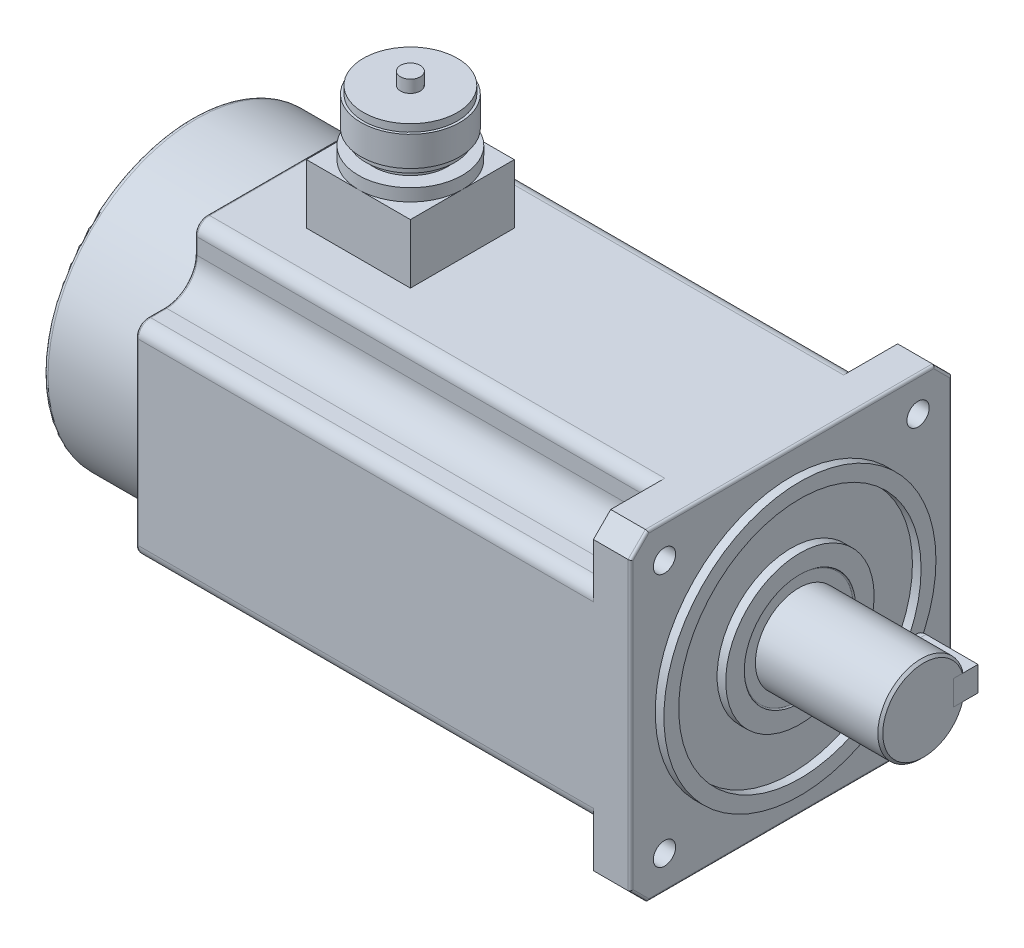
ISO-10303-21;
HEADER;
FILE_DESCRIPTION(('STEP AP214'),'2;1');
FILE_NAME('part.step','',(''),(''),'','','');
FILE_SCHEMA(('AUTOMOTIVE_DESIGN { 1 0 10303 214 1 1 1 1 }'));
ENDSEC;
DATA;
#1=APPLICATION_CONTEXT('core data for automotive mechanical design processes');
#2=APPLICATION_PROTOCOL_DEFINITION('international standard','automotive_design',2000,#1);
#3=PRODUCT_CONTEXT('',#1,'mechanical');
#4=PRODUCT('Part','Part','',(#3));
#5=PRODUCT_RELATED_PRODUCT_CATEGORY('part','',(#4));
#6=PRODUCT_DEFINITION_FORMATION('','',#4);
#7=PRODUCT_DEFINITION_CONTEXT('part definition',#1,'design');
#8=PRODUCT_DEFINITION('design','',#6,#7);
#9=PRODUCT_DEFINITION_SHAPE('','',#8);
#10=(LENGTH_UNIT() NAMED_UNIT(*) SI_UNIT(.MILLI.,.METRE.));
#11=(NAMED_UNIT(*) PLANE_ANGLE_UNIT() SI_UNIT($,.RADIAN.));
#12=(NAMED_UNIT(*) SI_UNIT($,.STERADIAN.) SOLID_ANGLE_UNIT());
#13=UNCERTAINTY_MEASURE_WITH_UNIT(LENGTH_MEASURE(1.E-05),#10,'distance_accuracy_value','');
#14=(GEOMETRIC_REPRESENTATION_CONTEXT(3) GLOBAL_UNCERTAINTY_ASSIGNED_CONTEXT((#13)) GLOBAL_UNIT_ASSIGNED_CONTEXT((#10,
#11,#12)) REPRESENTATION_CONTEXT('',''));
#15=CARTESIAN_POINT('',(0.,0.,0.));
#16=DIRECTION('',(0.,0.,1.));
#17=DIRECTION('',(1.,0.,0.));
#18=AXIS2_PLACEMENT_3D('',#15,#16,#17);
#19=CARTESIAN_POINT('',(32.5,0.,-22.));
#20=DIRECTION('',(0.,0.,1.));
#21=DIRECTION('',(1.,0.,0.));
#22=AXIS2_PLACEMENT_3D('',#19,#20,#21);
#23=CYLINDRICAL_SURFACE('',#22,5.);
#24=CARTESIAN_POINT('',(32.5,0.,-12.));
#25=DIRECTION('',(0.,0.,-1.));
#26=DIRECTION('',(-1.,0.,0.));
#27=AXIS2_PLACEMENT_3D('',#24,#25,#26);
#28=CIRCLE('',#27,5.);
#29=CARTESIAN_POINT('',(32.5,-5.,-12.));
#30=VERTEX_POINT('',#29);
#31=CARTESIAN_POINT('',(32.5,4.99999999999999,-12.));
#32=VERTEX_POINT('',#31);
#33=EDGE_CURVE('E106',#30,#32,#28,.T.);
#34=ORIENTED_EDGE('',*,*,#33,.T.);
#35=DIRECTION('',(0.,0.,1.));
#36=VECTOR('',#35,1.);
#37=CARTESIAN_POINT('',(32.5,4.99999999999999,-22.));
#38=LINE('',#37,#36);
#39=CARTESIAN_POINT('',(32.5,4.99999999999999,-22.));
#40=VERTEX_POINT('',#39);
#41=EDGE_CURVE('E12',#40,#32,#38,.T.);
#42=ORIENTED_EDGE('',*,*,#41,.F.);
#43=CARTESIAN_POINT('',(32.5,0.,-22.));
#44=DIRECTION('',(0.,0.,-1.));
#45=DIRECTION('',(-1.,0.,0.));
#46=AXIS2_PLACEMENT_3D('',#43,#44,#45);
#47=CIRCLE('',#46,5.);
#48=CARTESIAN_POINT('',(32.5,-5.,-22.));
#49=VERTEX_POINT('',#48);
#50=EDGE_CURVE('E94',#49,#40,#47,.T.);
#51=ORIENTED_EDGE('',*,*,#50,.F.);
#52=DIRECTION('',(0.,0.,1.));
#53=VECTOR('',#52,1.);
#54=CARTESIAN_POINT('',(32.5,-5.,-22.));
#55=LINE('',#54,#53);
#56=EDGE_CURVE('E102',#49,#30,#55,.T.);
#57=ORIENTED_EDGE('',*,*,#56,.T.);
#58=EDGE_LOOP('',(#34,#42,#51,#57));
#59=FACE_BOUND('',#58,.T.);
#60=ADVANCED_FACE('F43',(#59),#23,.T.);
#61=CARTESIAN_POINT('',(32.5,4.99999999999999,-22.));
#62=DIRECTION('',(0.,-1.,0.));
#63=DIRECTION('',(1.,0.,0.));
#64=AXIS2_PLACEMENT_3D('',#61,#62,#63);
#65=PLANE('',#64);
#66=DIRECTION('',(1.,0.,0.));
#67=VECTOR('',#66,1.);
#68=CARTESIAN_POINT('',(32.5,4.99999999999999,-12.));
#69=LINE('',#68,#67);
#70=CARTESIAN_POINT('',(53.5,4.99999999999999,-12.));
#71=VERTEX_POINT('',#70);
#72=EDGE_CURVE('E98',#32,#71,#69,.T.);
#73=ORIENTED_EDGE('',*,*,#72,.T.);
#74=DIRECTION('',(0.,0.,1.));
#75=VECTOR('',#74,1.);
#76=CARTESIAN_POINT('',(53.5,4.99999999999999,-22.));
#77=LINE('',#76,#75);
#78=CARTESIAN_POINT('',(53.5,4.99999999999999,-22.));
#79=VERTEX_POINT('',#78);
#80=EDGE_CURVE('E51',#79,#71,#77,.T.);
#81=ORIENTED_EDGE('',*,*,#80,.F.);
#82=DIRECTION('',(1.,0.,0.));
#83=VECTOR('',#82,1.);
#84=CARTESIAN_POINT('',(32.5,4.99999999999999,-22.));
#85=LINE('',#84,#83);
#86=EDGE_CURVE('E89',#40,#79,#85,.T.);
#87=ORIENTED_EDGE('',*,*,#86,.F.);
#88=ORIENTED_EDGE('',*,*,#41,.T.);
#89=EDGE_LOOP('',(#73,#81,#87,#88));
#90=FACE_BOUND('',#89,.T.);
#91=ADVANCED_FACE('F97',(#90),#65,.F.);
#92=CARTESIAN_POINT('',(53.5,4.99999999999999,-22.));
#93=DIRECTION('',(-1.,0.,0.));
#94=DIRECTION('',(0.,0.,1.));
#95=AXIS2_PLACEMENT_3D('',#92,#93,#94);
#96=PLANE('',#95);
#97=DIRECTION('',(0.,-1.,0.));
#98=VECTOR('',#97,1.);
#99=CARTESIAN_POINT('',(53.5,4.99999999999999,-12.));
#100=LINE('',#99,#98);
#101=CARTESIAN_POINT('',(53.5,-5.,-12.));
#102=VERTEX_POINT('',#101);
#103=EDGE_CURVE('E76',#71,#102,#100,.T.);
#104=ORIENTED_EDGE('',*,*,#103,.T.);
#105=DIRECTION('',(0.,0.,1.));
#106=VECTOR('',#105,1.);
#107=CARTESIAN_POINT('',(53.5,-5.,-22.));
#108=LINE('',#107,#106);
#109=CARTESIAN_POINT('',(53.5,-5.,-22.));
#110=VERTEX_POINT('',#109);
#111=EDGE_CURVE('E99',#110,#102,#108,.T.);
#112=ORIENTED_EDGE('',*,*,#111,.F.);
#113=DIRECTION('',(0.,-1.,0.));
#114=VECTOR('',#113,1.);
#115=CARTESIAN_POINT('',(53.5,4.99999999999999,-22.));
#116=LINE('',#115,#114);
#117=EDGE_CURVE('E92',#79,#110,#116,.T.);
#118=ORIENTED_EDGE('',*,*,#117,.F.);
#119=ORIENTED_EDGE('',*,*,#80,.T.);
#120=EDGE_LOOP('',(#104,#112,#118,#119));
#121=FACE_BOUND('',#120,.T.);
#122=ADVANCED_FACE('F100',(#121),#96,.F.);
#123=CARTESIAN_POINT('',(53.5,-5.,-22.));
#124=DIRECTION('',(0.,1.,0.));
#125=DIRECTION('',(-1.,0.,0.));
#126=AXIS2_PLACEMENT_3D('',#123,#124,#125);
#127=PLANE('',#126);
#128=DIRECTION('',(-1.,0.,0.));
#129=VECTOR('',#128,1.);
#130=CARTESIAN_POINT('',(53.5,-5.,-12.));
#131=LINE('',#130,#129);
#132=EDGE_CURVE('E82',#102,#30,#131,.T.);
#133=ORIENTED_EDGE('',*,*,#132,.T.);
#134=ORIENTED_EDGE('',*,*,#56,.F.);
#135=DIRECTION('',(-1.,0.,0.));
#136=VECTOR('',#135,1.);
#137=CARTESIAN_POINT('',(53.5,-5.,-22.));
#138=LINE('',#137,#136);
#139=EDGE_CURVE('E59',#110,#49,#138,.T.);
#140=ORIENTED_EDGE('',*,*,#139,.F.);
#141=ORIENTED_EDGE('',*,*,#111,.T.);
#142=EDGE_LOOP('',(#133,#134,#140,#141));
#143=FACE_BOUND('',#142,.T.);
#144=ADVANCED_FACE('F113',(#143),#127,.F.);
#145=CARTESIAN_POINT('',(32.5,0.,-22.));
#146=DIRECTION('',(0.,0.,-1.));
#147=DIRECTION('',(-1.,0.,0.));
#148=AXIS2_PLACEMENT_3D('',#145,#146,#147);
#149=PLANE('',#148);
#150=ORIENTED_EDGE('',*,*,#50,.T.);
#151=ORIENTED_EDGE('',*,*,#86,.T.);
#152=ORIENTED_EDGE('',*,*,#117,.T.);
#153=ORIENTED_EDGE('',*,*,#139,.T.);
#154=EDGE_LOOP('',(#150,#151,#152,#153));
#155=FACE_BOUND('',#154,.T.);
#156=ADVANCED_FACE('F90',(#155),#149,.T.);
#157=CARTESIAN_POINT('',(32.5,0.,-12.));
#158=DIRECTION('',(0.,0.,-1.));
#159=DIRECTION('',(-1.,0.,0.));
#160=AXIS2_PLACEMENT_3D('',#157,#158,#159);
#161=PLANE('',#160);
#162=ORIENTED_EDGE('',*,*,#33,.F.);
#163=ORIENTED_EDGE('',*,*,#132,.F.);
#164=ORIENTED_EDGE('',*,*,#103,.F.);
#165=ORIENTED_EDGE('',*,*,#72,.F.);
#166=EDGE_LOOP('',(#162,#163,#164,#165));
#167=FACE_BOUND('',#166,.T.);
#168=ADVANCED_FACE('F116',(#167),#161,.F.);
#169=CLOSED_SHELL('',(#60,#91,#122,#144,#156,#168));
#170=MANIFOLD_SOLID_BREP('B2',#169);
#171=CARTESIAN_POINT('',(-154.,115.,0.));
#172=DIRECTION('',(0.,1.,0.));
#173=DIRECTION('',(0.,0.,1.));
#174=AXIS2_PLACEMENT_3D('',#171,#172,#173);
#175=PLANE('',#174);
#176=CARTESIAN_POINT('',(-154.,115.,0.));
#177=DIRECTION('',(0.,1.,0.));
#178=DIRECTION('',(0.,0.,1.));
#179=AXIS2_PLACEMENT_3D('',#176,#177,#178);
#180=CIRCLE('',#179,19.);
#181=CARTESIAN_POINT('',(-154.,115.,19.));
#182=VERTEX_POINT('',#181);
#183=EDGE_CURVE('E2383',#182,#182,#180,.T.);
#184=ORIENTED_EDGE('',*,*,#183,.T.);
#185=EDGE_LOOP('',(#184));
#186=FACE_BOUND('',#185,.T.);
#187=CARTESIAN_POINT('',(-154.,115.,0.));
#188=DIRECTION('',(0.,1.,0.));
#189=DIRECTION('',(0.,0.,1.));
#190=AXIS2_PLACEMENT_3D('',#187,#188,#189);
#191=CIRCLE('',#190,3.99999999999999);
#192=CARTESIAN_POINT('',(-154.,115.,3.99999999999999));
#193=VERTEX_POINT('',#192);
#194=EDGE_CURVE('E2380',#193,#193,#191,.T.);
#195=ORIENTED_EDGE('',*,*,#194,.F.);
#196=EDGE_LOOP('',(#195));
#197=FACE_BOUND('',#196,.T.);
#198=ADVANCED_FACE('F167',(#186,#197),#175,.T.);
#199=CARTESIAN_POINT('',(-154.,112.,0.));
#200=DIRECTION('',(0.,1.,0.));
#201=DIRECTION('',(0.,0.,1.));
#202=AXIS2_PLACEMENT_3D('',#199,#200,#201);
#203=PLANE('',#202);
#204=CARTESIAN_POINT('',(-154.,112.,0.));
#205=DIRECTION('',(0.,1.,0.));
#206=DIRECTION('',(0.,0.,1.));
#207=AXIS2_PLACEMENT_3D('',#204,#205,#206);
#208=CIRCLE('',#207,20.);
#209=CARTESIAN_POINT('',(-154.,112.,20.));
#210=VERTEX_POINT('',#209);
#211=EDGE_CURVE('E2390',#210,#210,#208,.T.);
#212=ORIENTED_EDGE('',*,*,#211,.T.);
#213=EDGE_LOOP('',(#212));
#214=FACE_BOUND('',#213,.T.);
#215=CARTESIAN_POINT('',(-154.,112.,0.));
#216=DIRECTION('',(0.,1.,0.));
#217=DIRECTION('',(0.,0.,1.));
#218=AXIS2_PLACEMENT_3D('',#215,#216,#217);
#219=CIRCLE('',#218,19.);
#220=CARTESIAN_POINT('',(-154.,112.,19.));
#221=VERTEX_POINT('',#220);
#222=EDGE_CURVE('E2379',#221,#221,#219,.T.);
#223=ORIENTED_EDGE('',*,*,#222,.F.);
#224=EDGE_LOOP('',(#223));
#225=FACE_BOUND('',#224,.T.);
#226=ADVANCED_FACE('F1126',(#214,#225),#203,.T.);
#227=CARTESIAN_POINT('',(-154.,94.,0.));
#228=DIRECTION('',(0.,1.,0.));
#229=DIRECTION('',(0.,0.,1.));
#230=AXIS2_PLACEMENT_3D('',#227,#228,#229);
#231=PLANE('',#230);
#232=CARTESIAN_POINT('',(-154.,94.,0.));
#233=DIRECTION('',(0.,1.,0.));
#234=DIRECTION('',(0.,0.,1.));
#235=AXIS2_PLACEMENT_3D('',#232,#233,#234);
#236=CIRCLE('',#235,21.);
#237=CARTESIAN_POINT('',(-154.,94.,21.));
#238=VERTEX_POINT('',#237);
#239=EDGE_CURVE('E565',#238,#238,#236,.T.);
#240=ORIENTED_EDGE('',*,*,#239,.T.);
#241=EDGE_LOOP('',(#240));
#242=FACE_BOUND('',#241,.T.);
#243=CARTESIAN_POINT('',(-154.,94.,0.));
#244=DIRECTION('',(0.,1.,0.));
#245=DIRECTION('',(0.,0.,1.));
#246=AXIS2_PLACEMENT_3D('',#243,#244,#245);
#247=CIRCLE('',#246,15.);
#248=CARTESIAN_POINT('',(-154.,94.,15.));
#249=VERTEX_POINT('',#248);
#250=EDGE_CURVE('E2399',#249,#249,#247,.T.);
#251=ORIENTED_EDGE('',*,*,#250,.F.);
#252=EDGE_LOOP('',(#251));
#253=FACE_BOUND('',#252,.T.);
#254=ADVANCED_FACE('F1132',(#242,#253),#231,.T.);
#255=CARTESIAN_POINT('',(0.,89.,0.));
#256=DIRECTION('',(0.,-1.,0.));
#257=DIRECTION('',(0.,0.,-1.));
#258=AXIS2_PLACEMENT_3D('',#255,#256,#257);
#259=PLANE('',#258);
#260=CARTESIAN_POINT('',(-154.,89.,0.));
#261=DIRECTION('',(0.,1.,0.));
#262=DIRECTION('',(0.,0.,1.));
#263=AXIS2_PLACEMENT_3D('',#260,#261,#262);
#264=CIRCLE('',#263,21.);
#265=CARTESIAN_POINT('',(-154.,89.,21.));
#266=VERTEX_POINT('',#265);
#267=CARTESIAN_POINT('',(-133.,89.,0.));
#268=VERTEX_POINT('',#267);
#269=EDGE_CURVE('E183',#266,#268,#264,.T.);
#270=ORIENTED_EDGE('',*,*,#269,.F.);
#271=DIRECTION('',(1.,0.,0.));
#272=VECTOR('',#271,1.);
#273=CARTESIAN_POINT('',(-175.,89.,21.));
#274=LINE('',#273,#272);
#275=CARTESIAN_POINT('',(-133.,89.,21.));
#276=VERTEX_POINT('',#275);
#277=EDGE_CURVE('E551',#266,#276,#274,.T.);
#278=ORIENTED_EDGE('',*,*,#277,.T.);
#279=DIRECTION('',(0.,0.,-1.));
#280=VECTOR('',#279,1.);
#281=CARTESIAN_POINT('',(-133.,89.,21.));
#282=LINE('',#281,#280);
#283=EDGE_CURVE('E563',#276,#268,#282,.T.);
#284=ORIENTED_EDGE('',*,*,#283,.T.);
#285=EDGE_LOOP('',(#270,#278,#284));
#286=FACE_BOUND('',#285,.T.);
#287=ADVANCED_FACE('F562',(#286),#259,.F.);
#288=CARTESIAN_POINT('',(-154.,89.,-21.));
#289=VERTEX_POINT('',#288);
#290=EDGE_CURVE('E41',#268,#289,#264,.T.);
#291=ORIENTED_EDGE('',*,*,#290,.F.);
#292=CARTESIAN_POINT('',(-133.,89.,-21.));
#293=VERTEX_POINT('',#292);
#294=EDGE_CURVE('E574',#268,#293,#282,.T.);
#295=ORIENTED_EDGE('',*,*,#294,.T.);
#296=DIRECTION('',(-1.,0.,0.));
#297=VECTOR('',#296,1.);
#298=CARTESIAN_POINT('',(-175.,89.,-21.));
#299=LINE('',#298,#297);
#300=EDGE_CURVE('E575',#293,#289,#299,.T.);
#301=ORIENTED_EDGE('',*,*,#300,.T.);
#302=EDGE_LOOP('',(#291,#295,#301));
#303=FACE_BOUND('',#302,.T.);
#304=ADVANCED_FACE('F1173',(#303),#259,.F.);
#305=CARTESIAN_POINT('',(-175.,89.,0.));
#306=VERTEX_POINT('',#305);
#307=EDGE_CURVE('E181',#289,#306,#264,.T.);
#308=ORIENTED_EDGE('',*,*,#307,.F.);
#309=CARTESIAN_POINT('',(-175.,89.,-21.));
#310=VERTEX_POINT('',#309);
#311=EDGE_CURVE('E573',#289,#310,#299,.T.);
#312=ORIENTED_EDGE('',*,*,#311,.T.);
#313=DIRECTION('',(0.,0.,1.));
#314=VECTOR('',#313,1.);
#315=CARTESIAN_POINT('',(-175.,89.,21.));
#316=LINE('',#315,#314);
#317=EDGE_CURVE('E560',#310,#306,#316,.T.);
#318=ORIENTED_EDGE('',*,*,#317,.T.);
#319=EDGE_LOOP('',(#308,#312,#318));
#320=FACE_BOUND('',#319,.T.);
#321=ADVANCED_FACE('F1327',(#320),#259,.F.);
#322=EDGE_CURVE('E190',#306,#266,#264,.T.);
#323=ORIENTED_EDGE('',*,*,#322,.F.);
#324=CARTESIAN_POINT('',(-175.,89.,21.));
#325=VERTEX_POINT('',#324);
#326=EDGE_CURVE('E547',#306,#325,#316,.T.);
#327=ORIENTED_EDGE('',*,*,#326,.T.);
#328=EDGE_CURVE('E544',#325,#266,#274,.T.);
#329=ORIENTED_EDGE('',*,*,#328,.T.);
#330=EDGE_LOOP('',(#323,#327,#329));
#331=FACE_BOUND('',#330,.T.);
#332=ADVANCED_FACE('F546',(#331),#259,.F.);
#333=CARTESIAN_POINT('',(-200.,65.,58.));
#334=DIRECTION('',(0.,1.,0.));
#335=DIRECTION('',(0.,0.,1.));
#336=AXIS2_PLACEMENT_3D('',#333,#334,#335);
#337=PLANE('',#336);
#338=DIRECTION('',(-1.,0.,0.));
#339=VECTOR('',#338,1.);
#340=CARTESIAN_POINT('',(-15.,65.,-36.1509109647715));
#341=LINE('',#340,#339);
#342=CARTESIAN_POINT('',(-15.,65.,-36.1509109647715));
#343=VERTEX_POINT('',#342);
#344=CARTESIAN_POINT('',(-199.,65.,-36.1509109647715));
#345=VERTEX_POINT('',#344);
#346=EDGE_CURVE('E813',#343,#345,#341,.T.);
#347=ORIENTED_EDGE('',*,*,#346,.T.);
#348=DIRECTION('',(0.,0.,1.));
#349=VECTOR('',#348,1.);
#350=CARTESIAN_POINT('',(-199.,65.,36.1509109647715));
#351=LINE('',#350,#349);
#352=CARTESIAN_POINT('',(-199.,65.,36.1509109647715));
#353=VERTEX_POINT('',#352);
#354=EDGE_CURVE('E991',#345,#353,#351,.T.);
#355=ORIENTED_EDGE('',*,*,#354,.T.);
#356=DIRECTION('',(-1.,0.,0.));
#357=VECTOR('',#356,1.);
#358=CARTESIAN_POINT('',(-15.,65.,36.1509109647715));
#359=LINE('',#358,#357);
#360=CARTESIAN_POINT('',(-15.,65.,36.1509109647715));
#361=VERTEX_POINT('',#360);
#362=EDGE_CURVE('E734',#361,#353,#359,.T.);
#363=ORIENTED_EDGE('',*,*,#362,.F.);
#364=DIRECTION('',(0.,0.,-1.));
#365=VECTOR('',#364,1.);
#366=CARTESIAN_POINT('',(-15.,65.,58.));
#367=LINE('',#366,#365);
#368=CARTESIAN_POINT('',(-15.,65.,58.));
#369=VERTEX_POINT('',#368);
#370=EDGE_CURVE('E730',#369,#361,#367,.T.);
#371=ORIENTED_EDGE('',*,*,#370,.F.);
#372=DIRECTION('',(1.,0.,0.));
#373=VECTOR('',#372,1.);
#374=CARTESIAN_POINT('',(-200.,65.,58.));
#375=LINE('',#374,#373);
#376=CARTESIAN_POINT('',(-1.,65.,58.));
#377=VERTEX_POINT('',#376);
#378=EDGE_CURVE('E817',#369,#377,#375,.T.);
#379=ORIENTED_EDGE('',*,*,#378,.T.);
#380=DIRECTION('',(0.,0.,1.));
#381=VECTOR('',#380,1.);
#382=CARTESIAN_POINT('',(-1.,65.,58.));
#383=LINE('',#382,#381);
#384=CARTESIAN_POINT('',(-1.,65.,-58.));
#385=VERTEX_POINT('',#384);
#386=EDGE_CURVE('E887',#377,#385,#383,.F.);
#387=ORIENTED_EDGE('',*,*,#386,.T.);
#388=DIRECTION('',(1.,0.,0.));
#389=VECTOR('',#388,1.);
#390=CARTESIAN_POINT('',(-200.,65.,-58.));
#391=LINE('',#390,#389);
#392=CARTESIAN_POINT('',(-15.,65.,-58.));
#393=VERTEX_POINT('',#392);
#394=EDGE_CURVE('E832',#393,#385,#391,.T.);
#395=ORIENTED_EDGE('',*,*,#394,.F.);
#396=DIRECTION('',(0.,0.,-1.));
#397=VECTOR('',#396,1.);
#398=CARTESIAN_POINT('',(-15.,65.,-36.1509109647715));
#399=LINE('',#398,#397);
#400=EDGE_CURVE('E794',#343,#393,#399,.T.);
#401=ORIENTED_EDGE('',*,*,#400,.F.);
#402=EDGE_LOOP('',(#347,#355,#363,#371,#379,#387,#395,#401));
#403=FACE_BOUND('',#402,.T.);
#404=DIRECTION('',(-1.,0.,0.));
#405=VECTOR('',#404,1.);
#406=CARTESIAN_POINT('',(-175.,65.,-21.));
#407=LINE('',#406,#405);
#408=CARTESIAN_POINT('',(-133.,65.,-21.));
#409=VERTEX_POINT('',#408);
#410=CARTESIAN_POINT('',(-175.,65.,-21.));
#411=VERTEX_POINT('',#410);
#412=EDGE_CURVE('E582',#409,#411,#407,.T.);
#413=ORIENTED_EDGE('',*,*,#412,.F.);
#414=DIRECTION('',(0.,0.,-1.));
#415=VECTOR('',#414,1.);
#416=CARTESIAN_POINT('',(-133.,65.,21.));
#417=LINE('',#416,#415);
#418=CARTESIAN_POINT('',(-133.,65.,21.));
#419=VERTEX_POINT('',#418);
#420=EDGE_CURVE('E579',#419,#409,#417,.T.);
#421=ORIENTED_EDGE('',*,*,#420,.F.);
#422=DIRECTION('',(1.,0.,0.));
#423=VECTOR('',#422,1.);
#424=CARTESIAN_POINT('',(-175.,65.,21.));
#425=LINE('',#424,#423);
#426=CARTESIAN_POINT('',(-175.,65.,21.));
#427=VERTEX_POINT('',#426);
#428=EDGE_CURVE('E587',#427,#419,#425,.T.);
#429=ORIENTED_EDGE('',*,*,#428,.F.);
#430=DIRECTION('',(0.,0.,1.));
#431=VECTOR('',#430,1.);
#432=CARTESIAN_POINT('',(-175.,65.,21.));
#433=LINE('',#432,#431);
#434=EDGE_CURVE('E584',#411,#427,#433,.T.);
#435=ORIENTED_EDGE('',*,*,#434,.F.);
#436=EDGE_LOOP('',(#413,#421,#429,#435));
#437=FACE_BOUND('',#436,.T.);
#438=ADVANCED_FACE('F1123',(#403,#437),#337,.T.);
#439=CARTESIAN_POINT('',(53.5,0.,0.));
#440=DIRECTION('',(-1.,0.,0.));
#441=DIRECTION('',(0.,0.,1.));
#442=AXIS2_PLACEMENT_3D('',#439,#440,#441);
#443=CYLINDRICAL_SURFACE('',#442,17.5);
#444=CARTESIAN_POINT('',(3.,0.,0.));
#445=DIRECTION('',(1.,0.,0.));
#446=DIRECTION('',(0.,0.,-1.));
#447=AXIS2_PLACEMENT_3D('',#444,#445,#446);
#448=CIRCLE('',#447,17.5);
#449=CARTESIAN_POINT('',(3.,0.,-17.5));
#450=VERTEX_POINT('',#449);
#451=EDGE_CURVE('E624',#450,#450,#448,.T.);
#452=ORIENTED_EDGE('',*,*,#451,.T.);
#453=EDGE_LOOP('',(#452));
#454=FACE_BOUND('',#453,.T.);
#455=DIRECTION('',(-1.,0.,0.));
#456=VECTOR('',#455,1.);
#457=CARTESIAN_POINT('',(53.5,-5.,-16.7705098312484));
#458=LINE('',#457,#456);
#459=CARTESIAN_POINT('',(52.5,-5.,-16.7705098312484));
#460=VERTEX_POINT('',#459);
#461=CARTESIAN_POINT('',(32.5,-5.,-16.7705098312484));
#462=VERTEX_POINT('',#461);
#463=EDGE_CURVE('E622',#460,#462,#458,.T.);
#464=ORIENTED_EDGE('',*,*,#463,.F.);
#465=CARTESIAN_POINT('',(52.5,0.,0.));
#466=DIRECTION('',(1.,0.,0.));
#467=DIRECTION('',(0.,0.,-1.));
#468=AXIS2_PLACEMENT_3D('',#465,#466,#467);
#469=CIRCLE('',#468,17.5);
#470=CARTESIAN_POINT('',(52.5,4.99999999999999,-16.7705098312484));
#471=VERTEX_POINT('',#470);
#472=EDGE_CURVE('E568',#460,#471,#469,.F.);
#473=ORIENTED_EDGE('',*,*,#472,.T.);
#474=DIRECTION('',(-1.,0.,0.));
#475=VECTOR('',#474,1.);
#476=CARTESIAN_POINT('',(53.5,4.99999999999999,-16.7705098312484));
#477=LINE('',#476,#475);
#478=CARTESIAN_POINT('',(32.5,4.99999999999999,-16.7705098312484));
#479=VERTEX_POINT('',#478);
#480=EDGE_CURVE('E619',#479,#471,#477,.F.);
#481=ORIENTED_EDGE('',*,*,#480,.F.);
#482=CARTESIAN_POINT('',(32.5,-5.,-16.7705098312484));
#483=CARTESIAN_POINT('',(32.3624562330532,-5.00001814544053,-16.7704912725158));
#484=CARTESIAN_POINT('',(32.2249193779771,-4.99432529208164,-16.7722013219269));
#485=CARTESIAN_POINT('',(31.9508888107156,-4.97165222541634,-16.7789431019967));
#486=CARTESIAN_POINT('',(31.8143948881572,-4.95467435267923,-16.7839741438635));
#487=CARTESIAN_POINT('',(31.5437415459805,-4.90961903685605,-16.7972068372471));
#488=CARTESIAN_POINT('',(31.4095773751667,-4.88156789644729,-16.8054009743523));
#489=CARTESIAN_POINT('',(31.1442003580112,-4.81461674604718,-16.8247046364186));
#490=CARTESIAN_POINT('',(31.012987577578,-4.77571649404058,-16.8358142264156));
#491=CARTESIAN_POINT('',(30.7544683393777,-4.68740449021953,-16.8606149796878));
#492=CARTESIAN_POINT('',(30.627159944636,-4.63799805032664,-16.874304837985));
#493=CARTESIAN_POINT('',(30.3772006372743,-4.52905522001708,-16.9038705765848));
#494=CARTESIAN_POINT('',(30.2545514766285,-4.46951506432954,-16.9197472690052));
#495=CARTESIAN_POINT('',(29.894791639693,-4.27631278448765,-16.9699997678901));
#496=CARTESIAN_POINT('',(29.6657016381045,-4.12801150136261,-17.007014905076));
#497=CARTESIAN_POINT('',(29.2294860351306,-3.79229915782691,-17.0850471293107));
#498=CARTESIAN_POINT('',(29.023079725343,-3.60397767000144,-17.1261428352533));
#499=CARTESIAN_POINT('',(28.6442623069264,-3.19544341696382,-17.2070462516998));
#500=CARTESIAN_POINT('',(28.471856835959,-2.97522537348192,-17.2468537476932));
#501=CARTESIAN_POINT('',(28.1629219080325,-2.5041085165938,-17.3215844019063));
#502=CARTESIAN_POINT('',(28.0271190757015,-2.25271539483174,-17.3564029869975));
#503=CARTESIAN_POINT('',(27.7999922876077,-1.72950937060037,-17.4163145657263));
#504=CARTESIAN_POINT('',(27.7086576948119,-1.45770136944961,-17.4414098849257));
#505=CARTESIAN_POINT('',(27.5754142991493,-0.908899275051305,-17.4784878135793));
#506=CARTESIAN_POINT('',(27.5322781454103,-0.632225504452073,-17.4907954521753));
#507=CARTESIAN_POINT('',(27.4927833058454,-0.0753060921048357,-17.5020523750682));
#508=CARTESIAN_POINT('',(27.4964166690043,0.204938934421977,-17.5010039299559));
#509=CARTESIAN_POINT('',(27.5495154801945,0.752451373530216,-17.4859002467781));
#510=CARTESIAN_POINT('',(27.5976523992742,1.0198597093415,-17.4722220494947));
#511=CARTESIAN_POINT('',(27.7362408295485,1.54263514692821,-17.4338464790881));
#512=CARTESIAN_POINT('',(27.8266944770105,1.79800164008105,-17.4091485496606));
#513=CARTESIAN_POINT('',(28.0482663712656,2.29267928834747,-17.3509771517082));
#514=CARTESIAN_POINT('',(28.1798189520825,2.53178407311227,-17.3174105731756));
#515=CARTESIAN_POINT('',(28.4796443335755,2.98504901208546,-17.2450626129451));
#516=CARTESIAN_POINT('',(28.6479245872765,3.19920408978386,-17.2062801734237));
#517=CARTESIAN_POINT('',(28.9276273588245,3.50113424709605,-17.1465202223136));
#518=CARTESIAN_POINT('',(29.0273638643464,3.6000742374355,-17.1259700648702));
#519=CARTESIAN_POINT('',(29.2348202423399,3.7892313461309,-17.0851123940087));
#520=CARTESIAN_POINT('',(29.3425373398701,3.87945147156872,-17.0648047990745));
#521=CARTESIAN_POINT('',(29.5653450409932,4.05062437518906,-17.0249868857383));
#522=CARTESIAN_POINT('',(29.6804405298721,4.13157091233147,-17.005477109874));
#523=CARTESIAN_POINT('',(29.917160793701,4.28353981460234,-16.9678346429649));
#524=CARTESIAN_POINT('',(30.0387830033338,4.35456603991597,-16.9497014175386));
#525=CARTESIAN_POINT('',(30.2889159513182,4.48679157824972,-16.9151829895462));
#526=CARTESIAN_POINT('',(30.4174786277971,4.54789718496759,-16.898814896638));
#527=CARTESIAN_POINT('',(30.67954149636,4.65898872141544,-16.8685251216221));
#528=CARTESIAN_POINT('',(30.8130396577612,4.70897916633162,-16.8546024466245));
#529=CARTESIAN_POINT('',(31.0839210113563,4.79739484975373,-16.829649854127));
#530=CARTESIAN_POINT('',(31.2212999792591,4.835832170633,-16.8186169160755));
#531=CARTESIAN_POINT('',(31.4989955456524,4.90084834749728,-16.7997865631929));
#532=CARTESIAN_POINT('',(31.6393107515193,4.92743269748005,-16.7919876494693));
#533=CARTESIAN_POINT('',(31.8996651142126,4.96528740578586,-16.7808301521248));
#534=CARTESIAN_POINT('',(32.0194316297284,4.97830600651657,-16.776966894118));
#535=CARTESIAN_POINT('',(32.2594622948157,4.99566040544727,-16.7718034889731));
#536=CARTESIAN_POINT('',(32.379725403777,5.0000094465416,-16.7704994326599));
#537=CARTESIAN_POINT('',(32.5,4.99999999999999,-16.7705098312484));
#538=B_SPLINE_CURVE_WITH_KNOTS('',3,(#482,#483,#484,#485,#486,#487,#488,#489,#490,#491,#492,
#493,#494,#495,#496,#497,#498,#499,#500,#501,#502,#503,#504,#505,#506,#507,#508,#509,#510,#511,
#512,#513,#514,#515,#516,#517,#518,#519,#520,#521,#522,#523,#524,#525,#526,#527,#528,#529,#530,
#531,#532,#533,#534,#535,#536,#537),.UNSPECIFIED.,.F.,.F.,(4,2,2,2,2,2,2,2,2,2,2,2,2,2,2,2,2,2,
2,2,2,2,2,2,2,2,2,4),(0.,0.412492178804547,0.824898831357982,1.23633171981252,1.64777378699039,
2.05900832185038,2.47039598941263,3.29264569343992,4.13611232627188,4.9797186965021,
5.83900986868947,6.69809539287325,7.53476732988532,8.3712970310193,9.18363381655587,
9.99601161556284,10.8172828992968,11.6387209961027,12.0642579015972,12.489647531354,
12.9153217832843,13.3408299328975,13.7701489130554,14.1992931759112,14.6279870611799,
15.056482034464,15.4177510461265,15.7784677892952),.UNSPECIFIED.);
#539=EDGE_CURVE('E1092',#462,#479,#538,.T.);
#540=ORIENTED_EDGE('',*,*,#539,.F.);
#541=EDGE_LOOP('',(#464,#473,#481,#540));
#542=FACE_BOUND('',#541,.T.);
#543=ADVANCED_FACE('F1101',(#454,#542),#443,.T.);
#544=CARTESIAN_POINT('',(53.5,0.,0.));
#545=DIRECTION('',(1.,0.,0.));
#546=DIRECTION('',(0.,0.,-1.));
#547=AXIS2_PLACEMENT_3D('',#544,#545,#546);
#548=PLANE('',#547);
#549=DIRECTION('',(0.,0.,-1.));
#550=VECTOR('',#549,1.);
#551=CARTESIAN_POINT('',(53.5,4.99999999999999,-12.));
#552=LINE('',#551,#550);
#553=CARTESIAN_POINT('',(53.5,4.99999999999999,-12.));
#554=VERTEX_POINT('',#553);
#555=CARTESIAN_POINT('',(53.5,4.99999999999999,-15.7241851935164));
#556=VERTEX_POINT('',#555);
#557=EDGE_CURVE('E610',#554,#556,#552,.T.);
#558=ORIENTED_EDGE('',*,*,#557,.T.);
#559=CARTESIAN_POINT('',(53.5,0.,0.));
#560=DIRECTION('',(1.,0.,0.));
#561=DIRECTION('',(0.,0.,-1.));
#562=AXIS2_PLACEMENT_3D('',#559,#560,#561);
#563=CIRCLE('',#562,16.5);
#564=CARTESIAN_POINT('',(53.5,-5.,-15.7241851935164));
#565=VERTEX_POINT('',#564);
#566=EDGE_CURVE('E1099',#556,#565,#563,.T.);
#567=ORIENTED_EDGE('',*,*,#566,.T.);
#568=DIRECTION('',(0.,0.,-1.));
#569=VECTOR('',#568,1.);
#570=CARTESIAN_POINT('',(53.5,-5.,-12.));
#571=LINE('',#570,#569);
#572=CARTESIAN_POINT('',(53.5,-5.,-12.));
#573=VERTEX_POINT('',#572);
#574=EDGE_CURVE('E613',#573,#565,#571,.T.);
#575=ORIENTED_EDGE('',*,*,#574,.F.);
#576=DIRECTION('',(0.,1.,0.));
#577=VECTOR('',#576,1.);
#578=CARTESIAN_POINT('',(53.5,4.99999999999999,-12.));
#579=LINE('',#578,#577);
#580=EDGE_CURVE('E602',#573,#554,#579,.T.);
#581=ORIENTED_EDGE('',*,*,#580,.T.);
#582=EDGE_LOOP('',(#558,#567,#575,#581));
#583=FACE_BOUND('',#582,.T.);
#584=ADVANCED_FACE('F1113',(#583),#548,.T.);
#585=CARTESIAN_POINT('',(3.,0.,0.));
#586=DIRECTION('',(1.,0.,0.));
#587=DIRECTION('',(0.,0.,-1.));
#588=AXIS2_PLACEMENT_3D('',#585,#586,#587);
#589=PLANE('',#588);
#590=CARTESIAN_POINT('',(3.,0.,0.));
#591=DIRECTION('',(1.,0.,0.));
#592=DIRECTION('',(0.,0.,-1.));
#593=AXIS2_PLACEMENT_3D('',#590,#591,#592);
#594=CIRCLE('',#593,22.);
#595=CARTESIAN_POINT('',(3.,0.,-22.));
#596=VERTEX_POINT('',#595);
#597=EDGE_CURVE('E1089',#596,#596,#594,.T.);
#598=ORIENTED_EDGE('',*,*,#597,.T.);
#599=EDGE_LOOP('',(#598));
#600=FACE_BOUND('',#599,.T.);
#601=ORIENTED_EDGE('',*,*,#451,.F.);
#602=EDGE_LOOP('',(#601));
#603=FACE_BOUND('',#602,.T.);
#604=ADVANCED_FACE('F1115',(#600,#603),#589,.T.);
#605=CARTESIAN_POINT('',(0.,0.,0.));
#606=DIRECTION('',(1.,0.,0.));
#607=DIRECTION('',(0.,0.,-1.));
#608=AXIS2_PLACEMENT_3D('',#605,#606,#607);
#609=PLANE('',#608);
#610=DIRECTION('',(0.,1.,0.));
#611=VECTOR('',#610,1.);
#612=CARTESIAN_POINT('',(0.,0.,-64.));
#613=LINE('',#612,#611);
#614=CARTESIAN_POINT('',(0.,-57.5857864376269,-64.));
#615=VERTEX_POINT('',#614);
#616=CARTESIAN_POINT('',(0.,57.5857864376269,-64.));
#617=VERTEX_POINT('',#616);
#618=EDGE_CURVE('E867',#615,#617,#613,.T.);
#619=ORIENTED_EDGE('',*,*,#618,.T.);
#620=DIRECTION('',(0.,0.707106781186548,0.707106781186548));
#621=VECTOR('',#620,1.);
#622=CARTESIAN_POINT('',(0.,60.7928932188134,-60.7928932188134));
#623=LINE('',#622,#621);
#624=CARTESIAN_POINT('',(0.,64.,-57.5857864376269));
#625=VERTEX_POINT('',#624);
#626=EDGE_CURVE('E869',#617,#625,#623,.T.);
#627=ORIENTED_EDGE('',*,*,#626,.T.);
#628=DIRECTION('',(0.,0.,1.));
#629=VECTOR('',#628,1.);
#630=CARTESIAN_POINT('',(0.,64.,0.));
#631=LINE('',#630,#629);
#632=CARTESIAN_POINT('',(0.,64.,57.5857864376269));
#633=VERTEX_POINT('',#632);
#634=EDGE_CURVE('E835',#625,#633,#631,.T.);
#635=ORIENTED_EDGE('',*,*,#634,.T.);
#636=DIRECTION('',(0.,-0.707106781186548,0.707106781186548));
#637=VECTOR('',#636,1.);
#638=CARTESIAN_POINT('',(0.,60.7928932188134,60.7928932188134));
#639=LINE('',#638,#637);
#640=CARTESIAN_POINT('',(0.,57.5857864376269,64.));
#641=VERTEX_POINT('',#640);
#642=EDGE_CURVE('E857',#633,#641,#639,.T.);
#643=ORIENTED_EDGE('',*,*,#642,.T.);
#644=DIRECTION('',(0.,-1.,0.));
#645=VECTOR('',#644,1.);
#646=CARTESIAN_POINT('',(0.,0.,64.));
#647=LINE('',#646,#645);
#648=CARTESIAN_POINT('',(0.,-57.5857864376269,64.));
#649=VERTEX_POINT('',#648);
#650=EDGE_CURVE('E859',#641,#649,#647,.T.);
#651=ORIENTED_EDGE('',*,*,#650,.T.);
#652=DIRECTION('',(0.,-0.707106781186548,-0.707106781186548));
#653=VECTOR('',#652,1.);
#654=CARTESIAN_POINT('',(0.,-60.7928932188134,60.7928932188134));
#655=LINE('',#654,#653);
#656=CARTESIAN_POINT('',(0.,-64.,57.5857864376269));
#657=VERTEX_POINT('',#656);
#658=EDGE_CURVE('E861',#649,#657,#655,.T.);
#659=ORIENTED_EDGE('',*,*,#658,.T.);
#660=DIRECTION('',(0.,0.,-1.));
#661=VECTOR('',#660,1.);
#662=CARTESIAN_POINT('',(0.,-64.,0.));
#663=LINE('',#662,#661);
#664=CARTESIAN_POINT('',(0.,-64.,-57.5857864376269));
#665=VERTEX_POINT('',#664);
#666=EDGE_CURVE('E863',#657,#665,#663,.T.);
#667=ORIENTED_EDGE('',*,*,#666,.T.);
#668=DIRECTION('',(0.,0.707106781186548,-0.707106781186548));
#669=VECTOR('',#668,1.);
#670=CARTESIAN_POINT('',(0.,-60.7928932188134,-60.7928932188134));
#671=LINE('',#670,#669);
#672=EDGE_CURVE('E865',#665,#615,#671,.T.);
#673=ORIENTED_EDGE('',*,*,#672,.T.);
#674=EDGE_LOOP('',(#619,#627,#635,#643,#651,#659,#667,#673));
#675=FACE_BOUND('',#674,.T.);
#676=CARTESIAN_POINT('',(0.,51.2652416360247,51.2652416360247));
#677=DIRECTION('',(1.,0.,0.));
#678=DIRECTION('',(0.,0.,-1.));
#679=AXIS2_PLACEMENT_3D('',#676,#677,#678);
#680=CIRCLE('',#679,4.5);
#681=CARTESIAN_POINT('',(0.,51.2652416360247,46.7652416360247));
#682=VERTEX_POINT('',#681);
#683=EDGE_CURVE('E661',#682,#682,#680,.T.);
#684=ORIENTED_EDGE('',*,*,#683,.F.);
#685=EDGE_LOOP('',(#684));
#686=FACE_BOUND('',#685,.T.);
#687=CARTESIAN_POINT('',(0.,51.2652416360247,-51.2652416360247));
#688=DIRECTION('',(1.,0.,0.));
#689=DIRECTION('',(0.,0.,-1.));
#690=AXIS2_PLACEMENT_3D('',#687,#688,#689);
#691=CIRCLE('',#690,4.5);
#692=CARTESIAN_POINT('',(0.,51.2652416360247,-55.7652416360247));
#693=VERTEX_POINT('',#692);
#694=EDGE_CURVE('E655',#693,#693,#691,.T.);
#695=ORIENTED_EDGE('',*,*,#694,.F.);
#696=EDGE_LOOP('',(#695));
#697=FACE_BOUND('',#696,.T.);
#698=CARTESIAN_POINT('',(0.,-51.2652416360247,-51.2652416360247));
#699=DIRECTION('',(1.,0.,0.));
#700=DIRECTION('',(0.,0.,-1.));
#701=AXIS2_PLACEMENT_3D('',#698,#699,#700);
#702=CIRCLE('',#701,4.5);
#703=CARTESIAN_POINT('',(0.,-51.2652416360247,-55.7652416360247));
#704=VERTEX_POINT('',#703);
#705=EDGE_CURVE('E649',#704,#704,#702,.T.);
#706=ORIENTED_EDGE('',*,*,#705,.F.);
#707=EDGE_LOOP('',(#706));
#708=FACE_BOUND('',#707,.T.);
#709=CARTESIAN_POINT('',(0.,-51.2652416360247,51.2652416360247));
#710=DIRECTION('',(1.,0.,0.));
#711=DIRECTION('',(0.,0.,-1.));
#712=AXIS2_PLACEMENT_3D('',#709,#710,#711);
#713=CIRCLE('',#712,4.5);
#714=CARTESIAN_POINT('',(0.,-51.2652416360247,46.7652416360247));
#715=VERTEX_POINT('',#714);
#716=EDGE_CURVE('E643',#715,#715,#713,.T.);
#717=ORIENTED_EDGE('',*,*,#716,.F.);
#718=EDGE_LOOP('',(#717));
#719=FACE_BOUND('',#718,.T.);
#720=CARTESIAN_POINT('',(0.,0.,0.));
#721=DIRECTION('',(1.,0.,0.));
#722=DIRECTION('',(0.,0.,-1.));
#723=AXIS2_PLACEMENT_3D('',#720,#721,#722);
#724=CIRCLE('',#723,55.);
#725=CARTESIAN_POINT('',(0.,0.,-55.));
#726=VERTEX_POINT('',#725);
#727=EDGE_CURVE('E633',#726,#726,#724,.T.);
#728=ORIENTED_EDGE('',*,*,#727,.F.);
#729=EDGE_LOOP('',(#728));
#730=FACE_BOUND('',#729,.T.);
#731=ADVANCED_FACE('F1121',(#675,#686,#697,#708,#719,#730),#609,.T.);
#732=CARTESIAN_POINT('',(-200.,0.,0.));
#733=DIRECTION('',(1.,0.,0.));
#734=DIRECTION('',(0.,0.,-1.));
#735=AXIS2_PLACEMENT_3D('',#732,#733,#734);
#736=PLANE('',#735);
#737=DIRECTION('',(0.,-1.,0.));
#738=VECTOR('',#737,1.);
#739=CARTESIAN_POINT('',(-200.,0.,40.1509109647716));
#740=LINE('',#739,#738);
#741=CARTESIAN_POINT('',(-200.,-60.,40.1509109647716));
#742=VERTEX_POINT('',#741);
#743=CARTESIAN_POINT('',(-200.,-53.5,40.1509109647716));
#744=VERTEX_POINT('',#743);
#745=EDGE_CURVE('E958',#742,#744,#740,.F.);
#746=ORIENTED_EDGE('',*,*,#745,.T.);
#747=CARTESIAN_POINT('',(-200.,-53.5,53.5));
#748=DIRECTION('',(1.,0.,0.));
#749=DIRECTION('',(0.,0.,-1.));
#750=AXIS2_PLACEMENT_3D('',#747,#748,#749);
#751=CIRCLE('',#750,13.3490890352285);
#752=CARTESIAN_POINT('',(-200.,-40.1509109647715,53.5));
#753=VERTEX_POINT('',#752);
#754=EDGE_CURVE('E960',#744,#753,#751,.T.);
#755=ORIENTED_EDGE('',*,*,#754,.T.);
#756=DIRECTION('',(0.,0.,-1.));
#757=VECTOR('',#756,1.);
#758=CARTESIAN_POINT('',(-200.,-40.1509109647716,0.));
#759=LINE('',#758,#757);
#760=CARTESIAN_POINT('',(-200.,-40.1509109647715,60.));
#761=VERTEX_POINT('',#760);
#762=EDGE_CURVE('E914',#753,#761,#759,.F.);
#763=ORIENTED_EDGE('',*,*,#762,.T.);
#764=CARTESIAN_POINT('',(-200.,-36.1509109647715,60.));
#765=DIRECTION('',(1.,0.,0.));
#766=DIRECTION('',(0.,0.,-1.));
#767=AXIS2_PLACEMENT_3D('',#764,#765,#766);
#768=CIRCLE('',#767,4.);
#769=CARTESIAN_POINT('',(-200.,-36.1509109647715,64.));
#770=VERTEX_POINT('',#769);
#771=EDGE_CURVE('E916',#761,#770,#768,.F.);
#772=ORIENTED_EDGE('',*,*,#771,.T.);
#773=DIRECTION('',(0.,-1.,0.));
#774=VECTOR('',#773,1.);
#775=CARTESIAN_POINT('',(-200.,36.1509109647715,64.));
#776=LINE('',#775,#774);
#777=CARTESIAN_POINT('',(-200.,36.1509109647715,64.));
#778=VERTEX_POINT('',#777);
#779=EDGE_CURVE('E918',#770,#778,#776,.F.);
#780=ORIENTED_EDGE('',*,*,#779,.T.);
#781=CARTESIAN_POINT('',(-200.,36.1509109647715,60.));
#782=DIRECTION('',(1.,0.,0.));
#783=DIRECTION('',(0.,0.,-1.));
#784=AXIS2_PLACEMENT_3D('',#781,#782,#783);
#785=CIRCLE('',#784,4.);
#786=CARTESIAN_POINT('',(-200.,40.1509109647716,60.));
#787=VERTEX_POINT('',#786);
#788=EDGE_CURVE('E920',#778,#787,#785,.F.);
#789=ORIENTED_EDGE('',*,*,#788,.T.);
#790=DIRECTION('',(0.,0.,1.));
#791=VECTOR('',#790,1.);
#792=CARTESIAN_POINT('',(-200.,40.1509109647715,0.));
#793=LINE('',#792,#791);
#794=CARTESIAN_POINT('',(-200.,40.1509109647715,53.5));
#795=VERTEX_POINT('',#794);
#796=EDGE_CURVE('E922',#787,#795,#793,.F.);
#797=ORIENTED_EDGE('',*,*,#796,.T.);
#798=CARTESIAN_POINT('',(-200.,53.5,53.5));
#799=DIRECTION('',(1.,0.,0.));
#800=DIRECTION('',(0.,0.,-1.));
#801=AXIS2_PLACEMENT_3D('',#798,#799,#800);
#802=CIRCLE('',#801,13.3490890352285);
#803=CARTESIAN_POINT('',(-200.,53.5,40.1509109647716));
#804=VERTEX_POINT('',#803);
#805=EDGE_CURVE('E924',#795,#804,#802,.T.);
#806=ORIENTED_EDGE('',*,*,#805,.T.);
#807=DIRECTION('',(0.,-1.,0.));
#808=VECTOR('',#807,1.);
#809=CARTESIAN_POINT('',(-200.,0.,40.1509109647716));
#810=LINE('',#809,#808);
#811=CARTESIAN_POINT('',(-200.,60.,40.1509109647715));
#812=VERTEX_POINT('',#811);
#813=EDGE_CURVE('E926',#804,#812,#810,.F.);
#814=ORIENTED_EDGE('',*,*,#813,.T.);
#815=CARTESIAN_POINT('',(-200.,60.,36.1509109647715));
#816=DIRECTION('',(1.,0.,0.));
#817=DIRECTION('',(0.,0.,-1.));
#818=AXIS2_PLACEMENT_3D('',#815,#816,#817);
#819=CIRCLE('',#818,4.);
#820=CARTESIAN_POINT('',(-200.,64.,36.1509109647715));
#821=VERTEX_POINT('',#820);
#822=EDGE_CURVE('E928',#812,#821,#819,.F.);
#823=ORIENTED_EDGE('',*,*,#822,.T.);
#824=DIRECTION('',(0.,0.,1.));
#825=VECTOR('',#824,1.);
#826=CARTESIAN_POINT('',(-200.,64.,-36.1509109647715));
#827=LINE('',#826,#825);
#828=CARTESIAN_POINT('',(-200.,64.,-36.1509109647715));
#829=VERTEX_POINT('',#828);
#830=EDGE_CURVE('E930',#821,#829,#827,.F.);
#831=ORIENTED_EDGE('',*,*,#830,.T.);
#832=CARTESIAN_POINT('',(-200.,60.,-36.1509109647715));
#833=DIRECTION('',(1.,0.,0.));
#834=DIRECTION('',(0.,0.,-1.));
#835=AXIS2_PLACEMENT_3D('',#832,#833,#834);
#836=CIRCLE('',#835,4.);
#837=CARTESIAN_POINT('',(-200.,60.,-40.1509109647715));
#838=VERTEX_POINT('',#837);
#839=EDGE_CURVE('E932',#829,#838,#836,.F.);
#840=ORIENTED_EDGE('',*,*,#839,.T.);
#841=DIRECTION('',(0.,1.,0.));
#842=VECTOR('',#841,1.);
#843=CARTESIAN_POINT('',(-200.,0.,-40.1509109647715));
#844=LINE('',#843,#842);
#845=CARTESIAN_POINT('',(-200.,53.5,-40.1509109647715));
#846=VERTEX_POINT('',#845);
#847=EDGE_CURVE('E934',#838,#846,#844,.F.);
#848=ORIENTED_EDGE('',*,*,#847,.T.);
#849=CARTESIAN_POINT('',(-200.,53.5,-53.5));
#850=DIRECTION('',(1.,0.,0.));
#851=DIRECTION('',(0.,0.,-1.));
#852=AXIS2_PLACEMENT_3D('',#849,#850,#851);
#853=CIRCLE('',#852,13.3490890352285);
#854=CARTESIAN_POINT('',(-200.,40.1509109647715,-53.5));
#855=VERTEX_POINT('',#854);
#856=EDGE_CURVE('E936',#846,#855,#853,.T.);
#857=ORIENTED_EDGE('',*,*,#856,.T.);
#858=DIRECTION('',(0.,0.,1.));
#859=VECTOR('',#858,1.);
#860=CARTESIAN_POINT('',(-200.,40.1509109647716,0.));
#861=LINE('',#860,#859);
#862=CARTESIAN_POINT('',(-200.,40.1509109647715,-60.));
#863=VERTEX_POINT('',#862);
#864=EDGE_CURVE('E938',#855,#863,#861,.F.);
#865=ORIENTED_EDGE('',*,*,#864,.T.);
#866=CARTESIAN_POINT('',(-200.,36.1509109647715,-60.));
#867=DIRECTION('',(1.,0.,0.));
#868=DIRECTION('',(0.,0.,-1.));
#869=AXIS2_PLACEMENT_3D('',#866,#867,#868);
#870=CIRCLE('',#869,4.);
#871=CARTESIAN_POINT('',(-200.,36.1509109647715,-64.));
#872=VERTEX_POINT('',#871);
#873=EDGE_CURVE('E940',#863,#872,#870,.F.);
#874=ORIENTED_EDGE('',*,*,#873,.T.);
#875=DIRECTION('',(0.,1.,0.));
#876=VECTOR('',#875,1.);
#877=CARTESIAN_POINT('',(-200.,-36.1509109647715,-64.));
#878=LINE('',#877,#876);
#879=CARTESIAN_POINT('',(-200.,-36.1509109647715,-64.));
#880=VERTEX_POINT('',#879);
#881=EDGE_CURVE('E942',#872,#880,#878,.F.);
#882=ORIENTED_EDGE('',*,*,#881,.T.);
#883=CARTESIAN_POINT('',(-200.,-36.1509109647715,-60.));
#884=DIRECTION('',(1.,0.,0.));
#885=DIRECTION('',(0.,0.,-1.));
#886=AXIS2_PLACEMENT_3D('',#883,#884,#885);
#887=CIRCLE('',#886,4.);
#888=CARTESIAN_POINT('',(-200.,-40.1509109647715,-60.));
#889=VERTEX_POINT('',#888);
#890=EDGE_CURVE('E944',#880,#889,#887,.F.);
#891=ORIENTED_EDGE('',*,*,#890,.T.);
#892=DIRECTION('',(0.,0.,-1.));
#893=VECTOR('',#892,1.);
#894=CARTESIAN_POINT('',(-200.,-40.1509109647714,0.));
#895=LINE('',#894,#893);
#896=CARTESIAN_POINT('',(-200.,-40.1509109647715,-53.5));
#897=VERTEX_POINT('',#896);
#898=EDGE_CURVE('E946',#889,#897,#895,.F.);
#899=ORIENTED_EDGE('',*,*,#898,.T.);
#900=CARTESIAN_POINT('',(-200.,-53.5,-53.5));
#901=DIRECTION('',(1.,0.,0.));
#902=DIRECTION('',(0.,0.,-1.));
#903=AXIS2_PLACEMENT_3D('',#900,#901,#902);
#904=CIRCLE('',#903,13.3490890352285);
#905=CARTESIAN_POINT('',(-200.,-53.5,-40.1509109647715));
#906=VERTEX_POINT('',#905);
#907=EDGE_CURVE('E948',#897,#906,#904,.T.);
#908=ORIENTED_EDGE('',*,*,#907,.T.);
#909=DIRECTION('',(0.,1.,0.));
#910=VECTOR('',#909,1.);
#911=CARTESIAN_POINT('',(-200.,0.,-40.1509109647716));
#912=LINE('',#911,#910);
#913=CARTESIAN_POINT('',(-200.,-60.,-40.1509109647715));
#914=VERTEX_POINT('',#913);
#915=EDGE_CURVE('E950',#906,#914,#912,.F.);
#916=ORIENTED_EDGE('',*,*,#915,.T.);
#917=CARTESIAN_POINT('',(-200.,-60.,-36.1509109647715));
#918=DIRECTION('',(1.,0.,0.));
#919=DIRECTION('',(0.,0.,-1.));
#920=AXIS2_PLACEMENT_3D('',#917,#918,#919);
#921=CIRCLE('',#920,4.);
#922=CARTESIAN_POINT('',(-200.,-64.,-36.1509109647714));
#923=VERTEX_POINT('',#922);
#924=EDGE_CURVE('E952',#914,#923,#921,.F.);
#925=ORIENTED_EDGE('',*,*,#924,.T.);
#926=DIRECTION('',(0.,0.,-1.));
#927=VECTOR('',#926,1.);
#928=CARTESIAN_POINT('',(-200.,-64.,36.1509109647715));
#929=LINE('',#928,#927);
#930=CARTESIAN_POINT('',(-200.,-64.,36.1509109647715));
#931=VERTEX_POINT('',#930);
#932=EDGE_CURVE('E954',#923,#931,#929,.F.);
#933=ORIENTED_EDGE('',*,*,#932,.T.);
#934=CARTESIAN_POINT('',(-200.,-60.,36.1509109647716));
#935=DIRECTION('',(1.,0.,0.));
#936=DIRECTION('',(0.,0.,-1.));
#937=AXIS2_PLACEMENT_3D('',#934,#935,#936);
#938=CIRCLE('',#937,4.);
#939=EDGE_CURVE('E956',#931,#742,#938,.F.);
#940=ORIENTED_EDGE('',*,*,#939,.T.);
#941=EDGE_LOOP('',(#746,#755,#763,#772,#780,#789,#797,#806,#814,#823,#831,#840,#848,#857,#865,
#874,#882,#891,#899,#908,#916,#925,#933,#940));
#942=FACE_BOUND('',#941,.T.);
#943=CARTESIAN_POINT('',(-200.,0.,0.));
#944=DIRECTION('',(1.,0.,0.));
#945=DIRECTION('',(0.,0.,-1.));
#946=AXIS2_PLACEMENT_3D('',#943,#944,#945);
#947=CIRCLE('',#946,60.);
#948=CARTESIAN_POINT('',(-200.,0.,-60.));
#949=VERTEX_POINT('',#948);
#950=EDGE_CURVE('E1009',#949,#949,#947,.F.);
#951=ORIENTED_EDGE('',*,*,#950,.F.);
#952=EDGE_LOOP('',(#951));
#953=FACE_BOUND('',#952,.T.);
#954=ADVANCED_FACE('F1450',(#942,#953),#736,.F.);
#955=CARTESIAN_POINT('',(-200.,-65.,58.));
#956=DIRECTION('',(0.,-0.707106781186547,0.707106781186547));
#957=DIRECTION('',(0.,-0.707106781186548,-0.707106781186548));
#958=AXIS2_PLACEMENT_3D('',#955,#956,#957);
#959=PLANE('',#958);
#960=DIRECTION('',(1.,0.,0.));
#961=VECTOR('',#960,1.);
#962=CARTESIAN_POINT('',(-200.,-65.,58.));
#963=LINE('',#962,#961);
#964=CARTESIAN_POINT('',(-15.,-65.,58.));
#965=VERTEX_POINT('',#964);
#966=CARTESIAN_POINT('',(-1.,-65.,58.));
#967=VERTEX_POINT('',#966);
#968=EDGE_CURVE('E845',#965,#967,#963,.T.);
#969=ORIENTED_EDGE('',*,*,#968,.T.);
#970=DIRECTION('',(0.,-0.707106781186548,-0.707106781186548));
#971=VECTOR('',#970,1.);
#972=CARTESIAN_POINT('',(-1.,-65.,58.));
#973=LINE('',#972,#971);
#974=CARTESIAN_POINT('',(-1.,-58.,65.));
#975=VERTEX_POINT('',#974);
#976=EDGE_CURVE('E881',#967,#975,#973,.F.);
#977=ORIENTED_EDGE('',*,*,#976,.T.);
#978=DIRECTION('',(1.,0.,0.));
#979=VECTOR('',#978,1.);
#980=CARTESIAN_POINT('',(-200.,-58.,65.));
#981=LINE('',#980,#979);
#982=CARTESIAN_POINT('',(-15.,-58.,65.));
#983=VERTEX_POINT('',#982);
#984=EDGE_CURVE('E848',#983,#975,#981,.T.);
#985=ORIENTED_EDGE('',*,*,#984,.F.);
#986=DIRECTION('',(0.,0.707106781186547,0.707106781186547));
#987=VECTOR('',#986,1.);
#988=CARTESIAN_POINT('',(-15.,-65.,58.));
#989=LINE('',#988,#987);
#990=EDGE_CURVE('E682',#965,#983,#989,.T.);
#991=ORIENTED_EDGE('',*,*,#990,.F.);
#992=EDGE_LOOP('',(#969,#977,#985,#991));
#993=FACE_BOUND('',#992,.T.);
#994=ADVANCED_FACE('F1530',(#993),#959,.T.);
#995=CARTESIAN_POINT('',(-200.,-58.,65.));
#996=DIRECTION('',(0.,0.,1.));
#997=DIRECTION('',(1.,0.,0.));
#998=AXIS2_PLACEMENT_3D('',#995,#996,#997);
#999=PLANE('',#998);
#1000=DIRECTION('',(-1.,0.,0.));
#1001=VECTOR('',#1000,1.);
#1002=CARTESIAN_POINT('',(-15.,36.1509109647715,65.));
#1003=LINE('',#1002,#1001);
#1004=CARTESIAN_POINT('',(-15.,36.1509109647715,65.));
#1005=VERTEX_POINT('',#1004);
#1006=CARTESIAN_POINT('',(-199.,36.1509109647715,65.));
#1007=VERTEX_POINT('',#1006);
#1008=EDGE_CURVE('E738',#1005,#1007,#1003,.T.);
#1009=ORIENTED_EDGE('',*,*,#1008,.T.);
#1010=DIRECTION('',(0.,-1.,0.));
#1011=VECTOR('',#1010,1.);
#1012=CARTESIAN_POINT('',(-199.,-36.1509109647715,65.));
#1013=LINE('',#1012,#1011);
#1014=CARTESIAN_POINT('',(-199.,-36.1509109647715,65.));
#1015=VERTEX_POINT('',#1014);
#1016=EDGE_CURVE('E1003',#1007,#1015,#1013,.T.);
#1017=ORIENTED_EDGE('',*,*,#1016,.T.);
#1018=DIRECTION('',(-1.,0.,0.));
#1019=VECTOR('',#1018,1.);
#1020=CARTESIAN_POINT('',(-15.,-36.1509109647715,65.));
#1021=LINE('',#1020,#1019);
#1022=CARTESIAN_POINT('',(-15.,-36.1509109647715,65.));
#1023=VERTEX_POINT('',#1022);
#1024=EDGE_CURVE('E701',#1023,#1015,#1021,.T.);
#1025=ORIENTED_EDGE('',*,*,#1024,.F.);
#1026=DIRECTION('',(0.,1.,0.));
#1027=VECTOR('',#1026,1.);
#1028=CARTESIAN_POINT('',(-15.,-58.,65.));
#1029=LINE('',#1028,#1027);
#1030=EDGE_CURVE('E684',#983,#1023,#1029,.T.);
#1031=ORIENTED_EDGE('',*,*,#1030,.F.);
#1032=ORIENTED_EDGE('',*,*,#984,.T.);
#1033=DIRECTION('',(0.,-1.,0.));
#1034=VECTOR('',#1033,1.);
#1035=CARTESIAN_POINT('',(-1.,-58.,65.));
#1036=LINE('',#1035,#1034);
#1037=CARTESIAN_POINT('',(-1.,58.,65.));
#1038=VERTEX_POINT('',#1037);
#1039=EDGE_CURVE('E883',#975,#1038,#1036,.F.);
#1040=ORIENTED_EDGE('',*,*,#1039,.T.);
#1041=DIRECTION('',(1.,0.,0.));
#1042=VECTOR('',#1041,1.);
#1043=CARTESIAN_POINT('',(-200.,58.,65.));
#1044=LINE('',#1043,#1042);
#1045=CARTESIAN_POINT('',(-15.,58.,65.));
#1046=VERTEX_POINT('',#1045);
#1047=EDGE_CURVE('E851',#1046,#1038,#1044,.T.);
#1048=ORIENTED_EDGE('',*,*,#1047,.F.);
#1049=DIRECTION('',(0.,1.,0.));
#1050=VECTOR('',#1049,1.);
#1051=CARTESIAN_POINT('',(-15.,36.1509109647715,65.));
#1052=LINE('',#1051,#1050);
#1053=EDGE_CURVE('E726',#1005,#1046,#1052,.T.);
#1054=ORIENTED_EDGE('',*,*,#1053,.F.);
#1055=EDGE_LOOP('',(#1009,#1017,#1025,#1031,#1032,#1040,#1048,#1054));
#1056=FACE_BOUND('',#1055,.T.);
#1057=ADVANCED_FACE('F2044',(#1056),#999,.T.);
#1058=CARTESIAN_POINT('',(-200.,-65.,-58.));
#1059=DIRECTION('',(0.,-0.707106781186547,-0.707106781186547));
#1060=DIRECTION('',(0.,0.707106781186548,-0.707106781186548));
#1061=AXIS2_PLACEMENT_3D('',#1058,#1059,#1060);
#1062=PLANE('',#1061);
#1063=DIRECTION('',(1.,0.,0.));
#1064=VECTOR('',#1063,1.);
#1065=CARTESIAN_POINT('',(-200.,-58.,-65.));
#1066=LINE('',#1065,#1064);
#1067=CARTESIAN_POINT('',(-15.,-58.,-65.));
#1068=VERTEX_POINT('',#1067);
#1069=CARTESIAN_POINT('',(-1.,-58.,-65.));
#1070=VERTEX_POINT('',#1069);
#1071=EDGE_CURVE('E839',#1068,#1070,#1066,.T.);
#1072=ORIENTED_EDGE('',*,*,#1071,.T.);
#1073=DIRECTION('',(0.,0.707106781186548,-0.707106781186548));
#1074=VECTOR('',#1073,1.);
#1075=CARTESIAN_POINT('',(-1.,-65.,-58.));
#1076=LINE('',#1075,#1074);
#1077=CARTESIAN_POINT('',(-1.,-65.,-58.));
#1078=VERTEX_POINT('',#1077);
#1079=EDGE_CURVE('E877',#1070,#1078,#1076,.F.);
#1080=ORIENTED_EDGE('',*,*,#1079,.T.);
#1081=DIRECTION('',(1.,0.,0.));
#1082=VECTOR('',#1081,1.);
#1083=CARTESIAN_POINT('',(-200.,-65.,-58.));
#1084=LINE('',#1083,#1082);
#1085=CARTESIAN_POINT('',(-15.,-65.,-58.));
#1086=VERTEX_POINT('',#1085);
#1087=EDGE_CURVE('E842',#1086,#1078,#1084,.T.);
#1088=ORIENTED_EDGE('',*,*,#1087,.F.);
#1089=DIRECTION('',(0.,-0.707106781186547,0.707106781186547));
#1090=VECTOR('',#1089,1.);
#1091=CARTESIAN_POINT('',(-15.,-58.,-65.));
#1092=LINE('',#1091,#1090);
#1093=EDGE_CURVE('E762',#1068,#1086,#1092,.T.);
#1094=ORIENTED_EDGE('',*,*,#1093,.F.);
#1095=EDGE_LOOP('',(#1072,#1080,#1088,#1094));
#1096=FACE_BOUND('',#1095,.T.);
#1097=ADVANCED_FACE('F2053',(#1096),#1062,.T.);
#1098=CARTESIAN_POINT('',(-200.,-65.,58.));
#1099=DIRECTION('',(0.,-1.,0.));
#1100=DIRECTION('',(0.,0.,-1.));
#1101=AXIS2_PLACEMENT_3D('',#1098,#1099,#1100);
#1102=PLANE('',#1101);
#1103=DIRECTION('',(-1.,0.,0.));
#1104=VECTOR('',#1103,1.);
#1105=CARTESIAN_POINT('',(-15.,-65.,36.1509109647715));
#1106=LINE('',#1105,#1104);
#1107=CARTESIAN_POINT('',(-15.,-65.,36.1509109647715));
#1108=VERTEX_POINT('',#1107);
#1109=CARTESIAN_POINT('',(-199.,-65.,36.1509109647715));
#1110=VERTEX_POINT('',#1109);
#1111=EDGE_CURVE('E704',#1108,#1110,#1106,.T.);
#1112=ORIENTED_EDGE('',*,*,#1111,.T.);
#1113=DIRECTION('',(0.,0.,-1.));
#1114=VECTOR('',#1113,1.);
#1115=CARTESIAN_POINT('',(-199.,-65.,-36.1509109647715));
#1116=LINE('',#1115,#1114);
#1117=CARTESIAN_POINT('',(-199.,-65.,-36.1509109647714));
#1118=VERTEX_POINT('',#1117);
#1119=EDGE_CURVE('E967',#1110,#1118,#1116,.T.);
#1120=ORIENTED_EDGE('',*,*,#1119,.T.);
#1121=DIRECTION('',(-1.,0.,0.));
#1122=VECTOR('',#1121,1.);
#1123=CARTESIAN_POINT('',(-15.,-65.,-36.1509109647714));
#1124=LINE('',#1123,#1122);
#1125=CARTESIAN_POINT('',(-15.,-65.,-36.1509109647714));
#1126=VERTEX_POINT('',#1125);
#1127=EDGE_CURVE('E781',#1126,#1118,#1124,.T.);
#1128=ORIENTED_EDGE('',*,*,#1127,.F.);
#1129=DIRECTION('',(0.,0.,1.));
#1130=VECTOR('',#1129,1.);
#1131=CARTESIAN_POINT('',(-15.,-65.,-58.));
#1132=LINE('',#1131,#1130);
#1133=EDGE_CURVE('E764',#1086,#1126,#1132,.T.);
#1134=ORIENTED_EDGE('',*,*,#1133,.F.);
#1135=ORIENTED_EDGE('',*,*,#1087,.T.);
#1136=DIRECTION('',(0.,0.,-1.));
#1137=VECTOR('',#1136,1.);
#1138=CARTESIAN_POINT('',(-1.,-65.,58.));
#1139=LINE('',#1138,#1137);
#1140=EDGE_CURVE('E879',#1078,#967,#1139,.F.);
#1141=ORIENTED_EDGE('',*,*,#1140,.T.);
#1142=ORIENTED_EDGE('',*,*,#968,.F.);
#1143=DIRECTION('',(0.,0.,1.));
#1144=VECTOR('',#1143,1.);
#1145=CARTESIAN_POINT('',(-15.,-65.,36.1509109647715));
#1146=LINE('',#1145,#1144);
#1147=EDGE_CURVE('E680',#1108,#965,#1146,.T.);
#1148=ORIENTED_EDGE('',*,*,#1147,.F.);
#1149=EDGE_LOOP('',(#1112,#1120,#1128,#1134,#1135,#1141,#1142,#1148));
#1150=FACE_BOUND('',#1149,.T.);
#1151=ADVANCED_FACE('F2062',(#1150),#1102,.T.);
#1152=CARTESIAN_POINT('',(-200.,-58.,-65.));
#1153=DIRECTION('',(0.,0.,-1.));
#1154=DIRECTION('',(-1.,0.,0.));
#1155=AXIS2_PLACEMENT_3D('',#1152,#1153,#1154);
#1156=PLANE('',#1155);
#1157=DIRECTION('',(-1.,0.,0.));
#1158=VECTOR('',#1157,1.);
#1159=CARTESIAN_POINT('',(-15.,-36.1509109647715,-65.));
#1160=LINE('',#1159,#1158);
#1161=CARTESIAN_POINT('',(-15.,-36.1509109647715,-65.));
#1162=VERTEX_POINT('',#1161);
#1163=CARTESIAN_POINT('',(-199.,-36.1509109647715,-65.));
#1164=VERTEX_POINT('',#1163);
#1165=EDGE_CURVE('E784',#1162,#1164,#1160,.T.);
#1166=ORIENTED_EDGE('',*,*,#1165,.T.);
#1167=DIRECTION('',(0.,1.,0.));
#1168=VECTOR('',#1167,1.);
#1169=CARTESIAN_POINT('',(-199.,36.1509109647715,-65.));
#1170=LINE('',#1169,#1168);
#1171=CARTESIAN_POINT('',(-199.,36.1509109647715,-65.));
#1172=VERTEX_POINT('',#1171);
#1173=EDGE_CURVE('E979',#1164,#1172,#1170,.T.);
#1174=ORIENTED_EDGE('',*,*,#1173,.T.);
#1175=DIRECTION('',(-1.,0.,0.));
#1176=VECTOR('',#1175,1.);
#1177=CARTESIAN_POINT('',(-15.,36.1509109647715,-65.));
#1178=LINE('',#1177,#1176);
#1179=CARTESIAN_POINT('',(-15.,36.1509109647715,-65.));
#1180=VERTEX_POINT('',#1179);
#1181=EDGE_CURVE('E827',#1180,#1172,#1178,.T.);
#1182=ORIENTED_EDGE('',*,*,#1181,.F.);
#1183=DIRECTION('',(0.,-1.,0.));
#1184=VECTOR('',#1183,1.);
#1185=CARTESIAN_POINT('',(-15.,58.,-65.));
#1186=LINE('',#1185,#1184);
#1187=CARTESIAN_POINT('',(-15.,58.,-65.));
#1188=VERTEX_POINT('',#1187);
#1189=EDGE_CURVE('E798',#1188,#1180,#1186,.T.);
#1190=ORIENTED_EDGE('',*,*,#1189,.F.);
#1191=DIRECTION('',(1.,0.,0.));
#1192=VECTOR('',#1191,1.);
#1193=CARTESIAN_POINT('',(-200.,58.,-65.));
#1194=LINE('',#1193,#1192);
#1195=CARTESIAN_POINT('',(-1.,58.,-65.));
#1196=VERTEX_POINT('',#1195);
#1197=EDGE_CURVE('E836',#1188,#1196,#1194,.T.);
#1198=ORIENTED_EDGE('',*,*,#1197,.T.);
#1199=DIRECTION('',(0.,1.,0.));
#1200=VECTOR('',#1199,1.);
#1201=CARTESIAN_POINT('',(-1.,-58.,-65.));
#1202=LINE('',#1201,#1200);
#1203=EDGE_CURVE('E875',#1196,#1070,#1202,.F.);
#1204=ORIENTED_EDGE('',*,*,#1203,.T.);
#1205=ORIENTED_EDGE('',*,*,#1071,.F.);
#1206=DIRECTION('',(0.,-1.,0.));
#1207=VECTOR('',#1206,1.);
#1208=CARTESIAN_POINT('',(-15.,-36.1509109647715,-65.));
#1209=LINE('',#1208,#1207);
#1210=EDGE_CURVE('E760',#1162,#1068,#1209,.T.);
#1211=ORIENTED_EDGE('',*,*,#1210,.F.);
#1212=EDGE_LOOP('',(#1166,#1174,#1182,#1190,#1198,#1204,#1205,#1211));
#1213=FACE_BOUND('',#1212,.T.);
#1214=ADVANCED_FACE('F2071',(#1213),#1156,.T.);
#1215=CARTESIAN_POINT('',(-200.,58.,-65.));
#1216=DIRECTION('',(0.,0.707106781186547,-0.707106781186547));
#1217=DIRECTION('',(0.,0.707106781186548,0.707106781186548));
#1218=AXIS2_PLACEMENT_3D('',#1215,#1216,#1217);
#1219=PLANE('',#1218);
#1220=ORIENTED_EDGE('',*,*,#394,.T.);
#1221=DIRECTION('',(0.,0.707106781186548,0.707106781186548));
#1222=VECTOR('',#1221,1.);
#1223=CARTESIAN_POINT('',(-1.,58.,-65.));
#1224=LINE('',#1223,#1222);
#1225=EDGE_CURVE('E872',#385,#1196,#1224,.F.);
#1226=ORIENTED_EDGE('',*,*,#1225,.T.);
#1227=ORIENTED_EDGE('',*,*,#1197,.F.);
#1228=DIRECTION('',(0.,-0.707106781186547,-0.707106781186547));
#1229=VECTOR('',#1228,1.);
#1230=CARTESIAN_POINT('',(-15.,65.,-58.));
#1231=LINE('',#1230,#1229);
#1232=EDGE_CURVE('E796',#393,#1188,#1231,.T.);
#1233=ORIENTED_EDGE('',*,*,#1232,.F.);
#1234=EDGE_LOOP('',(#1220,#1226,#1227,#1233));
#1235=FACE_BOUND('',#1234,.T.);
#1236=ADVANCED_FACE('F2079',(#1235),#1219,.T.);
#1237=CARTESIAN_POINT('',(-200.,58.,65.));
#1238=DIRECTION('',(0.,0.707106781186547,0.707106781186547));
#1239=DIRECTION('',(0.,-0.707106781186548,0.707106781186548));
#1240=AXIS2_PLACEMENT_3D('',#1237,#1238,#1239);
#1241=PLANE('',#1240);
#1242=ORIENTED_EDGE('',*,*,#1047,.T.);
#1243=DIRECTION('',(0.,-0.707106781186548,0.707106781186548));
#1244=VECTOR('',#1243,1.);
#1245=CARTESIAN_POINT('',(-1.,58.,65.));
#1246=LINE('',#1245,#1244);
#1247=EDGE_CURVE('E885',#1038,#377,#1246,.F.);
#1248=ORIENTED_EDGE('',*,*,#1247,.T.);
#1249=ORIENTED_EDGE('',*,*,#378,.F.);
#1250=DIRECTION('',(0.,0.707106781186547,-0.707106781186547));
#1251=VECTOR('',#1250,1.);
#1252=CARTESIAN_POINT('',(-15.,58.,65.));
#1253=LINE('',#1252,#1251);
#1254=EDGE_CURVE('E728',#1046,#369,#1253,.T.);
#1255=ORIENTED_EDGE('',*,*,#1254,.F.);
#1256=EDGE_LOOP('',(#1242,#1248,#1249,#1255));
#1257=FACE_BOUND('',#1256,.T.);
#1258=ADVANCED_FACE('F2034',(#1257),#1241,.T.);
#1259=CARTESIAN_POINT('',(-15.,60.,-36.1509109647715));
#1260=DIRECTION('',(-1.,0.,0.));
#1261=DIRECTION('',(0.,0.,1.));
#1262=AXIS2_PLACEMENT_3D('',#1259,#1260,#1261);
#1263=CYLINDRICAL_SURFACE('',#1262,5.);
#1264=DIRECTION('',(-1.,0.,0.));
#1265=VECTOR('',#1264,1.);
#1266=CARTESIAN_POINT('',(-15.,60.,-41.1509109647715));
#1267=LINE('',#1266,#1265);
#1268=CARTESIAN_POINT('',(-15.,60.,-41.1509109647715));
#1269=VERTEX_POINT('',#1268);
#1270=CARTESIAN_POINT('',(-199.,60.,-41.1509109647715));
#1271=VERTEX_POINT('',#1270);
#1272=EDGE_CURVE('E814',#1269,#1271,#1267,.T.);
#1273=ORIENTED_EDGE('',*,*,#1272,.T.);
#1274=CARTESIAN_POINT('',(-199.,60.,-36.1509109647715));
#1275=DIRECTION('',(1.,0.,0.));
#1276=DIRECTION('',(0.,0.,-1.));
#1277=AXIS2_PLACEMENT_3D('',#1274,#1275,#1276);
#1278=CIRCLE('',#1277,5.);
#1279=EDGE_CURVE('E989',#1271,#345,#1278,.T.);
#1280=ORIENTED_EDGE('',*,*,#1279,.T.);
#1281=ORIENTED_EDGE('',*,*,#346,.F.);
#1282=CARTESIAN_POINT('',(-15.,60.,-36.1509109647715));
#1283=DIRECTION('',(1.,0.,0.));
#1284=DIRECTION('',(0.,0.,-1.));
#1285=AXIS2_PLACEMENT_3D('',#1282,#1283,#1284);
#1286=CIRCLE('',#1285,5.);
#1287=EDGE_CURVE('E777',#1269,#343,#1286,.T.);
#1288=ORIENTED_EDGE('',*,*,#1287,.F.);
#1289=EDGE_LOOP('',(#1273,#1280,#1281,#1288));
#1290=FACE_BOUND('',#1289,.T.);
#1291=ADVANCED_FACE('F2025',(#1290),#1263,.T.);
#1292=CARTESIAN_POINT('',(-15.,53.5,-41.1509109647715));
#1293=DIRECTION('',(0.,0.,1.));
#1294=DIRECTION('',(1.,0.,0.));
#1295=AXIS2_PLACEMENT_3D('',#1292,#1293,#1294);
#1296=PLANE('',#1295);
#1297=DIRECTION('',(-1.,0.,0.));
#1298=VECTOR('',#1297,1.);
#1299=CARTESIAN_POINT('',(-15.,53.5,-41.1509109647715));
#1300=LINE('',#1299,#1298);
#1301=CARTESIAN_POINT('',(-15.,53.5,-41.1509109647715));
#1302=VERTEX_POINT('',#1301);
#1303=CARTESIAN_POINT('',(-199.,53.5,-41.1509109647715));
#1304=VERTEX_POINT('',#1303);
#1305=EDGE_CURVE('E818',#1302,#1304,#1300,.T.);
#1306=ORIENTED_EDGE('',*,*,#1305,.T.);
#1307=DIRECTION('',(0.,1.,0.));
#1308=VECTOR('',#1307,1.);
#1309=CARTESIAN_POINT('',(-199.,53.5,-41.1509109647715));
#1310=LINE('',#1309,#1308);
#1311=EDGE_CURVE('E987',#1304,#1271,#1310,.T.);
#1312=ORIENTED_EDGE('',*,*,#1311,.T.);
#1313=ORIENTED_EDGE('',*,*,#1272,.F.);
#1314=DIRECTION('',(0.,1.,0.));
#1315=VECTOR('',#1314,1.);
#1316=CARTESIAN_POINT('',(-15.,53.5,-41.1509109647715));
#1317=LINE('',#1316,#1315);
#1318=EDGE_CURVE('E810',#1302,#1269,#1317,.T.);
#1319=ORIENTED_EDGE('',*,*,#1318,.F.);
#1320=EDGE_LOOP('',(#1306,#1312,#1313,#1319));
#1321=FACE_BOUND('',#1320,.T.);
#1322=ADVANCED_FACE('F2016',(#1321),#1296,.F.);
#1323=CARTESIAN_POINT('',(-15.,53.5,-53.5));
#1324=DIRECTION('',(-1.,0.,0.));
#1325=DIRECTION('',(0.,0.,1.));
#1326=AXIS2_PLACEMENT_3D('',#1323,#1324,#1325);
#1327=CYLINDRICAL_SURFACE('',#1326,12.3490890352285);
#1328=DIRECTION('',(-1.,0.,0.));
#1329=VECTOR('',#1328,1.);
#1330=CARTESIAN_POINT('',(-15.,41.1509109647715,-53.5));
#1331=LINE('',#1330,#1329);
#1332=CARTESIAN_POINT('',(-15.,41.1509109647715,-53.5));
#1333=VERTEX_POINT('',#1332);
#1334=CARTESIAN_POINT('',(-199.,41.1509109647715,-53.5));
#1335=VERTEX_POINT('',#1334);
#1336=EDGE_CURVE('E821',#1333,#1335,#1331,.T.);
#1337=ORIENTED_EDGE('',*,*,#1336,.T.);
#1338=CARTESIAN_POINT('',(-199.,53.5,-53.5));
#1339=DIRECTION('',(1.,0.,0.));
#1340=DIRECTION('',(0.,0.,-1.));
#1341=AXIS2_PLACEMENT_3D('',#1338,#1339,#1340);
#1342=CIRCLE('',#1341,12.3490890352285);
#1343=EDGE_CURVE('E985',#1335,#1304,#1342,.F.);
#1344=ORIENTED_EDGE('',*,*,#1343,.T.);
#1345=ORIENTED_EDGE('',*,*,#1305,.F.);
#1346=CARTESIAN_POINT('',(-15.,53.5,-53.5));
#1347=DIRECTION('',(-1.,0.,0.));
#1348=DIRECTION('',(0.,0.,1.));
#1349=AXIS2_PLACEMENT_3D('',#1346,#1347,#1348);
#1350=CIRCLE('',#1349,12.3490890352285);
#1351=EDGE_CURVE('E807',#1333,#1302,#1350,.T.);
#1352=ORIENTED_EDGE('',*,*,#1351,.F.);
#1353=EDGE_LOOP('',(#1337,#1344,#1345,#1352));
#1354=FACE_BOUND('',#1353,.T.);
#1355=ADVANCED_FACE('F2007',(#1354),#1327,.F.);
#1356=CARTESIAN_POINT('',(-15.,41.1509109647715,-53.5));
#1357=DIRECTION('',(0.,-1.,0.));
#1358=DIRECTION('',(0.,0.,-1.));
#1359=AXIS2_PLACEMENT_3D('',#1356,#1357,#1358);
#1360=PLANE('',#1359);
#1361=DIRECTION('',(-1.,0.,0.));
#1362=VECTOR('',#1361,1.);
#1363=CARTESIAN_POINT('',(-15.,41.1509109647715,-60.));
#1364=LINE('',#1363,#1362);
#1365=CARTESIAN_POINT('',(-15.,41.1509109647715,-60.));
#1366=VERTEX_POINT('',#1365);
#1367=CARTESIAN_POINT('',(-199.,41.1509109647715,-60.));
#1368=VERTEX_POINT('',#1367);
#1369=EDGE_CURVE('E824',#1366,#1368,#1364,.T.);
#1370=ORIENTED_EDGE('',*,*,#1369,.T.);
#1371=DIRECTION('',(0.,0.,1.));
#1372=VECTOR('',#1371,1.);
#1373=CARTESIAN_POINT('',(-199.,41.1509109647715,-53.5));
#1374=LINE('',#1373,#1372);
#1375=EDGE_CURVE('E983',#1368,#1335,#1374,.T.);
#1376=ORIENTED_EDGE('',*,*,#1375,.T.);
#1377=ORIENTED_EDGE('',*,*,#1336,.F.);
#1378=DIRECTION('',(0.,0.,1.));
#1379=VECTOR('',#1378,1.);
#1380=CARTESIAN_POINT('',(-15.,41.1509109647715,-53.5));
#1381=LINE('',#1380,#1379);
#1382=EDGE_CURVE('E804',#1366,#1333,#1381,.T.);
#1383=ORIENTED_EDGE('',*,*,#1382,.F.);
#1384=EDGE_LOOP('',(#1370,#1376,#1377,#1383));
#1385=FACE_BOUND('',#1384,.T.);
#1386=ADVANCED_FACE('F1998',(#1385),#1360,.F.);
#1387=CARTESIAN_POINT('',(-15.,36.1509109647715,-60.));
#1388=DIRECTION('',(-1.,0.,0.));
#1389=DIRECTION('',(0.,0.,1.));
#1390=AXIS2_PLACEMENT_3D('',#1387,#1388,#1389);
#1391=CYLINDRICAL_SURFACE('',#1390,5.);
#1392=ORIENTED_EDGE('',*,*,#1181,.T.);
#1393=CARTESIAN_POINT('',(-199.,36.1509109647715,-60.));
#1394=DIRECTION('',(1.,0.,0.));
#1395=DIRECTION('',(0.,0.,-1.));
#1396=AXIS2_PLACEMENT_3D('',#1393,#1394,#1395);
#1397=CIRCLE('',#1396,5.);
#1398=EDGE_CURVE('E981',#1172,#1368,#1397,.T.);
#1399=ORIENTED_EDGE('',*,*,#1398,.T.);
#1400=ORIENTED_EDGE('',*,*,#1369,.F.);
#1401=CARTESIAN_POINT('',(-15.,36.1509109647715,-60.));
#1402=DIRECTION('',(1.,0.,0.));
#1403=DIRECTION('',(0.,0.,-1.));
#1404=AXIS2_PLACEMENT_3D('',#1401,#1402,#1403);
#1405=CIRCLE('',#1404,5.);
#1406=EDGE_CURVE('E801',#1180,#1366,#1405,.T.);
#1407=ORIENTED_EDGE('',*,*,#1406,.F.);
#1408=EDGE_LOOP('',(#1392,#1399,#1400,#1407));
#1409=FACE_BOUND('',#1408,.T.);
#1410=ADVANCED_FACE('F1990',(#1409),#1391,.T.);
#1411=CARTESIAN_POINT('',(-15.,60.,-36.1509109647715));
#1412=DIRECTION('',(1.,0.,0.));
#1413=DIRECTION('',(0.,0.,-1.));
#1414=AXIS2_PLACEMENT_3D('',#1411,#1412,#1413);
#1415=PLANE('',#1414);
#1416=CARTESIAN_POINT('',(-15.,51.2652416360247,-51.2652416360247));
#1417=DIRECTION('',(1.,0.,0.));
#1418=DIRECTION('',(0.,0.,-1.));
#1419=AXIS2_PLACEMENT_3D('',#1416,#1417,#1418);
#1420=CIRCLE('',#1419,4.5);
#1421=CARTESIAN_POINT('',(-15.,51.2652416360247,-55.7652416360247));
#1422=VERTEX_POINT('',#1421);
#1423=EDGE_CURVE('E658',#1422,#1422,#1420,.T.);
#1424=ORIENTED_EDGE('',*,*,#1423,.T.);
#1425=EDGE_LOOP('',(#1424));
#1426=FACE_BOUND('',#1425,.T.);
#1427=ORIENTED_EDGE('',*,*,#1287,.T.);
#1428=ORIENTED_EDGE('',*,*,#400,.T.);
#1429=ORIENTED_EDGE('',*,*,#1232,.T.);
#1430=ORIENTED_EDGE('',*,*,#1189,.T.);
#1431=ORIENTED_EDGE('',*,*,#1406,.T.);
#1432=ORIENTED_EDGE('',*,*,#1382,.T.);
#1433=ORIENTED_EDGE('',*,*,#1351,.T.);
#1434=ORIENTED_EDGE('',*,*,#1318,.T.);
#1435=EDGE_LOOP('',(#1427,#1428,#1429,#1430,#1431,#1432,#1433,#1434));
#1436=FACE_BOUND('',#1435,.T.);
#1437=ADVANCED_FACE('F1981',(#1426,#1436),#1415,.F.);
#1438=CARTESIAN_POINT('',(-15.,-53.5,-53.5));
#1439=DIRECTION('',(-1.,0.,0.));
#1440=DIRECTION('',(0.,0.,1.));
#1441=AXIS2_PLACEMENT_3D('',#1438,#1439,#1440);
#1442=CYLINDRICAL_SURFACE('',#1441,12.3490890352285);
#1443=DIRECTION('',(-1.,0.,0.));
#1444=VECTOR('',#1443,1.);
#1445=CARTESIAN_POINT('',(-15.,-53.5,-41.1509109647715));
#1446=LINE('',#1445,#1444);
#1447=CARTESIAN_POINT('',(-15.,-53.5,-41.1509109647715));
#1448=VERTEX_POINT('',#1447);
#1449=CARTESIAN_POINT('',(-199.,-53.5,-41.1509109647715));
#1450=VERTEX_POINT('',#1449);
#1451=EDGE_CURVE('E774',#1448,#1450,#1446,.T.);
#1452=ORIENTED_EDGE('',*,*,#1451,.T.);
#1453=CARTESIAN_POINT('',(-199.,-53.5,-53.5));
#1454=DIRECTION('',(1.,0.,0.));
#1455=DIRECTION('',(0.,0.,-1.));
#1456=AXIS2_PLACEMENT_3D('',#1453,#1454,#1455);
#1457=CIRCLE('',#1456,12.3490890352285);
#1458=CARTESIAN_POINT('',(-199.,-41.1509109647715,-53.5));
#1459=VERTEX_POINT('',#1458);
#1460=EDGE_CURVE('E973',#1450,#1459,#1457,.F.);
#1461=ORIENTED_EDGE('',*,*,#1460,.T.);
#1462=DIRECTION('',(-1.,0.,0.));
#1463=VECTOR('',#1462,1.);
#1464=CARTESIAN_POINT('',(-15.,-41.1509109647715,-53.5));
#1465=LINE('',#1464,#1463);
#1466=CARTESIAN_POINT('',(-15.,-41.1509109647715,-53.5));
#1467=VERTEX_POINT('',#1466);
#1468=EDGE_CURVE('E773',#1467,#1459,#1465,.T.);
#1469=ORIENTED_EDGE('',*,*,#1468,.F.);
#1470=CARTESIAN_POINT('',(-15.,-53.5,-53.5));
#1471=DIRECTION('',(-1.,0.,0.));
#1472=DIRECTION('',(0.,0.,1.));
#1473=AXIS2_PLACEMENT_3D('',#1470,#1471,#1472);
#1474=CIRCLE('',#1473,12.3490890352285);
#1475=EDGE_CURVE('E737',#1448,#1467,#1474,.T.);
#1476=ORIENTED_EDGE('',*,*,#1475,.F.);
#1477=EDGE_LOOP('',(#1452,#1461,#1469,#1476));
#1478=FACE_BOUND('',#1477,.T.);
#1479=ADVANCED_FACE('F1972',(#1478),#1442,.F.);
#1480=CARTESIAN_POINT('',(-15.,-53.5,-41.1509109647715));
#1481=DIRECTION('',(0.,0.,1.));
#1482=DIRECTION('',(0.,-1.,0.));
#1483=AXIS2_PLACEMENT_3D('',#1480,#1481,#1482);
#1484=PLANE('',#1483);
#1485=DIRECTION('',(-1.,0.,0.));
#1486=VECTOR('',#1485,1.);
#1487=CARTESIAN_POINT('',(-15.,-60.,-41.1509109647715));
#1488=LINE('',#1487,#1486);
#1489=CARTESIAN_POINT('',(-15.,-60.,-41.1509109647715));
#1490=VERTEX_POINT('',#1489);
#1491=CARTESIAN_POINT('',(-199.,-60.,-41.1509109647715));
#1492=VERTEX_POINT('',#1491);
#1493=EDGE_CURVE('E778',#1490,#1492,#1488,.T.);
#1494=ORIENTED_EDGE('',*,*,#1493,.T.);
#1495=DIRECTION('',(0.,1.,0.));
#1496=VECTOR('',#1495,1.);
#1497=CARTESIAN_POINT('',(-199.,-53.5,-41.1509109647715));
#1498=LINE('',#1497,#1496);
#1499=EDGE_CURVE('E971',#1492,#1450,#1498,.T.);
#1500=ORIENTED_EDGE('',*,*,#1499,.T.);
#1501=ORIENTED_EDGE('',*,*,#1451,.F.);
#1502=DIRECTION('',(0.,1.,0.));
#1503=VECTOR('',#1502,1.);
#1504=CARTESIAN_POINT('',(-15.,-53.5,-41.1509109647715));
#1505=LINE('',#1504,#1503);
#1506=EDGE_CURVE('E770',#1490,#1448,#1505,.T.);
#1507=ORIENTED_EDGE('',*,*,#1506,.F.);
#1508=EDGE_LOOP('',(#1494,#1500,#1501,#1507));
#1509=FACE_BOUND('',#1508,.T.);
#1510=ADVANCED_FACE('F1963',(#1509),#1484,.F.);
#1511=CARTESIAN_POINT('',(-15.,-60.,-36.1509109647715));
#1512=DIRECTION('',(-1.,0.,0.));
#1513=DIRECTION('',(0.,0.,1.));
#1514=AXIS2_PLACEMENT_3D('',#1511,#1512,#1513);
#1515=CYLINDRICAL_SURFACE('',#1514,5.);
#1516=ORIENTED_EDGE('',*,*,#1127,.T.);
#1517=CARTESIAN_POINT('',(-199.,-60.,-36.1509109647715));
#1518=DIRECTION('',(1.,0.,0.));
#1519=DIRECTION('',(0.,0.,-1.));
#1520=AXIS2_PLACEMENT_3D('',#1517,#1518,#1519);
#1521=CIRCLE('',#1520,5.);
#1522=EDGE_CURVE('E969',#1118,#1492,#1521,.T.);
#1523=ORIENTED_EDGE('',*,*,#1522,.T.);
#1524=ORIENTED_EDGE('',*,*,#1493,.F.);
#1525=CARTESIAN_POINT('',(-15.,-60.,-36.1509109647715));
#1526=DIRECTION('',(1.,0.,0.));
#1527=DIRECTION('',(0.,0.,-1.));
#1528=AXIS2_PLACEMENT_3D('',#1525,#1526,#1527);
#1529=CIRCLE('',#1528,5.);
#1530=EDGE_CURVE('E767',#1126,#1490,#1529,.T.);
#1531=ORIENTED_EDGE('',*,*,#1530,.F.);
#1532=EDGE_LOOP('',(#1516,#1523,#1524,#1531));
#1533=FACE_BOUND('',#1532,.T.);
#1534=ADVANCED_FACE('F1954',(#1533),#1515,.T.);
#1535=CARTESIAN_POINT('',(-15.,-36.1509109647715,-60.));
#1536=DIRECTION('',(-1.,0.,0.));
#1537=DIRECTION('',(0.,0.,1.));
#1538=AXIS2_PLACEMENT_3D('',#1535,#1536,#1537);
#1539=CYLINDRICAL_SURFACE('',#1538,5.);
#1540=DIRECTION('',(-1.,0.,0.));
#1541=VECTOR('',#1540,1.);
#1542=CARTESIAN_POINT('',(-15.,-41.1509109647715,-60.));
#1543=LINE('',#1542,#1541);
#1544=CARTESIAN_POINT('',(-15.,-41.1509109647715,-60.));
#1545=VERTEX_POINT('',#1544);
#1546=CARTESIAN_POINT('',(-199.,-41.1509109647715,-60.));
#1547=VERTEX_POINT('',#1546);
#1548=EDGE_CURVE('E787',#1545,#1547,#1543,.T.);
#1549=ORIENTED_EDGE('',*,*,#1548,.T.);
#1550=CARTESIAN_POINT('',(-199.,-36.1509109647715,-60.));
#1551=DIRECTION('',(1.,0.,0.));
#1552=DIRECTION('',(0.,0.,-1.));
#1553=AXIS2_PLACEMENT_3D('',#1550,#1551,#1552);
#1554=CIRCLE('',#1553,5.);
#1555=EDGE_CURVE('E977',#1547,#1164,#1554,.T.);
#1556=ORIENTED_EDGE('',*,*,#1555,.T.);
#1557=ORIENTED_EDGE('',*,*,#1165,.F.);
#1558=CARTESIAN_POINT('',(-15.,-36.1509109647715,-60.));
#1559=DIRECTION('',(1.,0.,0.));
#1560=DIRECTION('',(0.,0.,-1.));
#1561=AXIS2_PLACEMENT_3D('',#1558,#1559,#1560);
#1562=CIRCLE('',#1561,5.);
#1563=EDGE_CURVE('E757',#1545,#1162,#1562,.T.);
#1564=ORIENTED_EDGE('',*,*,#1563,.F.);
#1565=EDGE_LOOP('',(#1549,#1556,#1557,#1564));
#1566=FACE_BOUND('',#1565,.T.);
#1567=ADVANCED_FACE('F1945',(#1566),#1539,.T.);
#1568=CARTESIAN_POINT('',(-15.,-41.1509109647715,-60.));
#1569=DIRECTION('',(0.,1.,0.));
#1570=DIRECTION('',(0.,0.,1.));
#1571=AXIS2_PLACEMENT_3D('',#1568,#1569,#1570);
#1572=PLANE('',#1571);
#1573=ORIENTED_EDGE('',*,*,#1468,.T.);
#1574=DIRECTION('',(0.,0.,-1.));
#1575=VECTOR('',#1574,1.);
#1576=CARTESIAN_POINT('',(-199.,-41.1509109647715,-60.));
#1577=LINE('',#1576,#1575);
#1578=EDGE_CURVE('E975',#1459,#1547,#1577,.T.);
#1579=ORIENTED_EDGE('',*,*,#1578,.T.);
#1580=ORIENTED_EDGE('',*,*,#1548,.F.);
#1581=DIRECTION('',(0.,0.,-1.));
#1582=VECTOR('',#1581,1.);
#1583=CARTESIAN_POINT('',(-15.,-41.1509109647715,-60.));
#1584=LINE('',#1583,#1582);
#1585=EDGE_CURVE('E754',#1467,#1545,#1584,.T.);
#1586=ORIENTED_EDGE('',*,*,#1585,.F.);
#1587=EDGE_LOOP('',(#1573,#1579,#1580,#1586));
#1588=FACE_BOUND('',#1587,.T.);
#1589=ADVANCED_FACE('F1937',(#1588),#1572,.F.);
#1590=CARTESIAN_POINT('',(-15.,-53.5,-53.5));
#1591=DIRECTION('',(-1.,0.,0.));
#1592=DIRECTION('',(0.,0.,1.));
#1593=AXIS2_PLACEMENT_3D('',#1590,#1591,#1592);
#1594=PLANE('',#1593);
#1595=CARTESIAN_POINT('',(-15.,-51.2652416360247,-51.2652416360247));
#1596=DIRECTION('',(1.,0.,0.));
#1597=DIRECTION('',(0.,0.,-1.));
#1598=AXIS2_PLACEMENT_3D('',#1595,#1596,#1597);
#1599=CIRCLE('',#1598,4.5);
#1600=CARTESIAN_POINT('',(-15.,-51.2652416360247,-55.7652416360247));
#1601=VERTEX_POINT('',#1600);
#1602=EDGE_CURVE('E652',#1601,#1601,#1599,.T.);
#1603=ORIENTED_EDGE('',*,*,#1602,.T.);
#1604=EDGE_LOOP('',(#1603));
#1605=FACE_BOUND('',#1604,.T.);
#1606=ORIENTED_EDGE('',*,*,#1475,.T.);
#1607=ORIENTED_EDGE('',*,*,#1585,.T.);
#1608=ORIENTED_EDGE('',*,*,#1563,.T.);
#1609=ORIENTED_EDGE('',*,*,#1210,.T.);
#1610=ORIENTED_EDGE('',*,*,#1093,.T.);
#1611=ORIENTED_EDGE('',*,*,#1133,.T.);
#1612=ORIENTED_EDGE('',*,*,#1530,.T.);
#1613=ORIENTED_EDGE('',*,*,#1506,.T.);
#1614=EDGE_LOOP('',(#1606,#1607,#1608,#1609,#1610,#1611,#1612,#1613));
#1615=FACE_BOUND('',#1614,.T.);
#1616=ADVANCED_FACE('F1928',(#1605,#1615),#1594,.T.);
#1617=CARTESIAN_POINT('',(-15.,60.,36.1509109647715));
#1618=DIRECTION('',(-1.,0.,0.));
#1619=DIRECTION('',(0.,0.,1.));
#1620=AXIS2_PLACEMENT_3D('',#1617,#1618,#1619);
#1621=CYLINDRICAL_SURFACE('',#1620,5.);
#1622=ORIENTED_EDGE('',*,*,#362,.T.);
#1623=CARTESIAN_POINT('',(-199.,60.,36.1509109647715));
#1624=DIRECTION('',(1.,0.,0.));
#1625=DIRECTION('',(0.,0.,-1.));
#1626=AXIS2_PLACEMENT_3D('',#1623,#1624,#1625);
#1627=CIRCLE('',#1626,5.);
#1628=CARTESIAN_POINT('',(-199.,60.,41.1509109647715));
#1629=VERTEX_POINT('',#1628);
#1630=EDGE_CURVE('E993',#353,#1629,#1627,.T.);
#1631=ORIENTED_EDGE('',*,*,#1630,.T.);
#1632=DIRECTION('',(-1.,0.,0.));
#1633=VECTOR('',#1632,1.);
#1634=CARTESIAN_POINT('',(-15.,60.,41.1509109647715));
#1635=LINE('',#1634,#1633);
#1636=CARTESIAN_POINT('',(-15.,60.,41.1509109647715));
#1637=VERTEX_POINT('',#1636);
#1638=EDGE_CURVE('E733',#1637,#1629,#1635,.T.);
#1639=ORIENTED_EDGE('',*,*,#1638,.F.);
#1640=CARTESIAN_POINT('',(-15.,60.,36.1509109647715));
#1641=DIRECTION('',(1.,0.,0.));
#1642=DIRECTION('',(0.,0.,-1.));
#1643=AXIS2_PLACEMENT_3D('',#1640,#1641,#1642);
#1644=CIRCLE('',#1643,5.);
#1645=EDGE_CURVE('E697',#361,#1637,#1644,.T.);
#1646=ORIENTED_EDGE('',*,*,#1645,.F.);
#1647=EDGE_LOOP('',(#1622,#1631,#1639,#1646));
#1648=FACE_BOUND('',#1647,.T.);
#1649=ADVANCED_FACE('F1919',(#1648),#1621,.T.);
#1650=CARTESIAN_POINT('',(-15.,36.1509109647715,60.));
#1651=DIRECTION('',(-1.,0.,0.));
#1652=DIRECTION('',(0.,0.,1.));
#1653=AXIS2_PLACEMENT_3D('',#1650,#1651,#1652);
#1654=CYLINDRICAL_SURFACE('',#1653,5.);
#1655=DIRECTION('',(-1.,0.,0.));
#1656=VECTOR('',#1655,1.);
#1657=CARTESIAN_POINT('',(-15.,41.1509109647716,60.));
#1658=LINE('',#1657,#1656);
#1659=CARTESIAN_POINT('',(-15.,41.1509109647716,60.));
#1660=VERTEX_POINT('',#1659);
#1661=CARTESIAN_POINT('',(-199.,41.1509109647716,60.));
#1662=VERTEX_POINT('',#1661);
#1663=EDGE_CURVE('E741',#1660,#1662,#1658,.T.);
#1664=ORIENTED_EDGE('',*,*,#1663,.T.);
#1665=CARTESIAN_POINT('',(-199.,36.1509109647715,60.));
#1666=DIRECTION('',(1.,0.,0.));
#1667=DIRECTION('',(0.,0.,-1.));
#1668=AXIS2_PLACEMENT_3D('',#1665,#1666,#1667);
#1669=CIRCLE('',#1668,5.);
#1670=EDGE_CURVE('E1001',#1662,#1007,#1669,.T.);
#1671=ORIENTED_EDGE('',*,*,#1670,.T.);
#1672=ORIENTED_EDGE('',*,*,#1008,.F.);
#1673=CARTESIAN_POINT('',(-15.,36.1509109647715,60.));
#1674=DIRECTION('',(1.,0.,0.));
#1675=DIRECTION('',(0.,0.,-1.));
#1676=AXIS2_PLACEMENT_3D('',#1673,#1674,#1675);
#1677=CIRCLE('',#1676,5.);
#1678=EDGE_CURVE('E723',#1660,#1005,#1677,.T.);
#1679=ORIENTED_EDGE('',*,*,#1678,.F.);
#1680=EDGE_LOOP('',(#1664,#1671,#1672,#1679));
#1681=FACE_BOUND('',#1680,.T.);
#1682=ADVANCED_FACE('F1910',(#1681),#1654,.T.);
#1683=CARTESIAN_POINT('',(-15.,41.1509109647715,53.5));
#1684=DIRECTION('',(0.,-1.,0.));
#1685=DIRECTION('',(0.,0.,-1.));
#1686=AXIS2_PLACEMENT_3D('',#1683,#1684,#1685);
#1687=PLANE('',#1686);
#1688=DIRECTION('',(-1.,0.,0.));
#1689=VECTOR('',#1688,1.);
#1690=CARTESIAN_POINT('',(-15.,41.1509109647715,53.5));
#1691=LINE('',#1690,#1689);
#1692=CARTESIAN_POINT('',(-15.,41.1509109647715,53.5));
#1693=VERTEX_POINT('',#1692);
#1694=CARTESIAN_POINT('',(-199.,41.1509109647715,53.5));
#1695=VERTEX_POINT('',#1694);
#1696=EDGE_CURVE('E744',#1693,#1695,#1691,.T.);
#1697=ORIENTED_EDGE('',*,*,#1696,.T.);
#1698=DIRECTION('',(0.,0.,1.));
#1699=VECTOR('',#1698,1.);
#1700=CARTESIAN_POINT('',(-199.,41.1509109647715,53.5));
#1701=LINE('',#1700,#1699);
#1702=EDGE_CURVE('E999',#1695,#1662,#1701,.T.);
#1703=ORIENTED_EDGE('',*,*,#1702,.T.);
#1704=ORIENTED_EDGE('',*,*,#1663,.F.);
#1705=DIRECTION('',(0.,0.,1.));
#1706=VECTOR('',#1705,1.);
#1707=CARTESIAN_POINT('',(-15.,41.1509109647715,53.5));
#1708=LINE('',#1707,#1706);
#1709=EDGE_CURVE('E720',#1693,#1660,#1708,.T.);
#1710=ORIENTED_EDGE('',*,*,#1709,.F.);
#1711=EDGE_LOOP('',(#1697,#1703,#1704,#1710));
#1712=FACE_BOUND('',#1711,.T.);
#1713=ADVANCED_FACE('F1901',(#1712),#1687,.F.);
#1714=CARTESIAN_POINT('',(-15.,53.5,53.5));
#1715=DIRECTION('',(-1.,0.,0.));
#1716=DIRECTION('',(0.,0.,1.));
#1717=AXIS2_PLACEMENT_3D('',#1714,#1715,#1716);
#1718=CYLINDRICAL_SURFACE('',#1717,12.3490890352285);
#1719=DIRECTION('',(-1.,0.,0.));
#1720=VECTOR('',#1719,1.);
#1721=CARTESIAN_POINT('',(-15.,53.5,41.1509109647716));
#1722=LINE('',#1721,#1720);
#1723=CARTESIAN_POINT('',(-15.,53.5,41.1509109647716));
#1724=VERTEX_POINT('',#1723);
#1725=CARTESIAN_POINT('',(-199.,53.5,41.1509109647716));
#1726=VERTEX_POINT('',#1725);
#1727=EDGE_CURVE('E747',#1724,#1726,#1722,.T.);
#1728=ORIENTED_EDGE('',*,*,#1727,.T.);
#1729=CARTESIAN_POINT('',(-199.,53.5,53.5));
#1730=DIRECTION('',(1.,0.,0.));
#1731=DIRECTION('',(0.,0.,-1.));
#1732=AXIS2_PLACEMENT_3D('',#1729,#1730,#1731);
#1733=CIRCLE('',#1732,12.3490890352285);
#1734=EDGE_CURVE('E997',#1726,#1695,#1733,.F.);
#1735=ORIENTED_EDGE('',*,*,#1734,.T.);
#1736=ORIENTED_EDGE('',*,*,#1696,.F.);
#1737=CARTESIAN_POINT('',(-15.,53.5,53.5));
#1738=DIRECTION('',(-1.,0.,0.));
#1739=DIRECTION('',(0.,0.,1.));
#1740=AXIS2_PLACEMENT_3D('',#1737,#1738,#1739);
#1741=CIRCLE('',#1740,12.3490890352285);
#1742=EDGE_CURVE('E717',#1724,#1693,#1741,.T.);
#1743=ORIENTED_EDGE('',*,*,#1742,.F.);
#1744=EDGE_LOOP('',(#1728,#1735,#1736,#1743));
#1745=FACE_BOUND('',#1744,.T.);
#1746=ADVANCED_FACE('F1892',(#1745),#1718,.F.);
#1747=CARTESIAN_POINT('',(-15.,60.,41.1509109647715));
#1748=DIRECTION('',(0.,0.,-1.));
#1749=DIRECTION('',(0.,1.,0.));
#1750=AXIS2_PLACEMENT_3D('',#1747,#1748,#1749);
#1751=PLANE('',#1750);
#1752=ORIENTED_EDGE('',*,*,#1638,.T.);
#1753=DIRECTION('',(0.,-1.,0.));
#1754=VECTOR('',#1753,1.);
#1755=CARTESIAN_POINT('',(-199.,60.,41.1509109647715));
#1756=LINE('',#1755,#1754);
#1757=EDGE_CURVE('E995',#1629,#1726,#1756,.T.);
#1758=ORIENTED_EDGE('',*,*,#1757,.T.);
#1759=ORIENTED_EDGE('',*,*,#1727,.F.);
#1760=DIRECTION('',(0.,-1.,0.));
#1761=VECTOR('',#1760,1.);
#1762=CARTESIAN_POINT('',(-15.,60.,41.1509109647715));
#1763=LINE('',#1762,#1761);
#1764=EDGE_CURVE('E714',#1637,#1724,#1763,.T.);
#1765=ORIENTED_EDGE('',*,*,#1764,.F.);
#1766=EDGE_LOOP('',(#1752,#1758,#1759,#1765));
#1767=FACE_BOUND('',#1766,.T.);
#1768=ADVANCED_FACE('F1883',(#1767),#1751,.F.);
#1769=CARTESIAN_POINT('',(-15.,60.,36.1509109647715));
#1770=DIRECTION('',(1.,0.,0.));
#1771=DIRECTION('',(0.,0.,-1.));
#1772=AXIS2_PLACEMENT_3D('',#1769,#1770,#1771);
#1773=PLANE('',#1772);
#1774=CARTESIAN_POINT('',(-15.,51.2652416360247,51.2652416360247));
#1775=DIRECTION('',(1.,0.,0.));
#1776=DIRECTION('',(0.,0.,-1.));
#1777=AXIS2_PLACEMENT_3D('',#1774,#1775,#1776);
#1778=CIRCLE('',#1777,4.5);
#1779=CARTESIAN_POINT('',(-15.,51.2652416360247,46.7652416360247));
#1780=VERTEX_POINT('',#1779);
#1781=EDGE_CURVE('E664',#1780,#1780,#1778,.T.);
#1782=ORIENTED_EDGE('',*,*,#1781,.T.);
#1783=EDGE_LOOP('',(#1782));
#1784=FACE_BOUND('',#1783,.T.);
#1785=ORIENTED_EDGE('',*,*,#1645,.T.);
#1786=ORIENTED_EDGE('',*,*,#1764,.T.);
#1787=ORIENTED_EDGE('',*,*,#1742,.T.);
#1788=ORIENTED_EDGE('',*,*,#1709,.T.);
#1789=ORIENTED_EDGE('',*,*,#1678,.T.);
#1790=ORIENTED_EDGE('',*,*,#1053,.T.);
#1791=ORIENTED_EDGE('',*,*,#1254,.T.);
#1792=ORIENTED_EDGE('',*,*,#370,.T.);
#1793=EDGE_LOOP('',(#1785,#1786,#1787,#1788,#1789,#1790,#1791,#1792));
#1794=FACE_BOUND('',#1793,.T.);
#1795=ADVANCED_FACE('F1874',(#1784,#1794),#1773,.F.);
#1796=CARTESIAN_POINT('',(-15.,-53.5,53.5));
#1797=DIRECTION('',(-1.,0.,0.));
#1798=DIRECTION('',(0.,0.,1.));
#1799=AXIS2_PLACEMENT_3D('',#1796,#1797,#1798);
#1800=CYLINDRICAL_SURFACE('',#1799,12.3490890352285);
#1801=DIRECTION('',(-1.,0.,0.));
#1802=VECTOR('',#1801,1.);
#1803=CARTESIAN_POINT('',(-15.,-41.1509109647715,53.5));
#1804=LINE('',#1803,#1802);
#1805=CARTESIAN_POINT('',(-15.,-41.1509109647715,53.5));
#1806=VERTEX_POINT('',#1805);
#1807=CARTESIAN_POINT('',(-199.,-41.1509109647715,53.5));
#1808=VERTEX_POINT('',#1807);
#1809=EDGE_CURVE('E694',#1806,#1808,#1804,.T.);
#1810=ORIENTED_EDGE('',*,*,#1809,.T.);
#1811=CARTESIAN_POINT('',(-199.,-53.5,53.5));
#1812=DIRECTION('',(1.,0.,0.));
#1813=DIRECTION('',(0.,0.,-1.));
#1814=AXIS2_PLACEMENT_3D('',#1811,#1812,#1813);
#1815=CIRCLE('',#1814,12.3490890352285);
#1816=CARTESIAN_POINT('',(-199.,-53.5,41.1509109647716));
#1817=VERTEX_POINT('',#1816);
#1818=EDGE_CURVE('E889',#1808,#1817,#1815,.F.);
#1819=ORIENTED_EDGE('',*,*,#1818,.T.);
#1820=DIRECTION('',(-1.,0.,0.));
#1821=VECTOR('',#1820,1.);
#1822=CARTESIAN_POINT('',(-15.,-53.5,41.1509109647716));
#1823=LINE('',#1822,#1821);
#1824=CARTESIAN_POINT('',(-15.,-53.5,41.1509109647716));
#1825=VERTEX_POINT('',#1824);
#1826=EDGE_CURVE('E693',#1825,#1817,#1823,.T.);
#1827=ORIENTED_EDGE('',*,*,#1826,.F.);
#1828=CARTESIAN_POINT('',(-15.,-53.5,53.5));
#1829=DIRECTION('',(-1.,0.,0.));
#1830=DIRECTION('',(0.,0.,1.));
#1831=AXIS2_PLACEMENT_3D('',#1828,#1829,#1830);
#1832=CIRCLE('',#1831,12.3490890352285);
#1833=EDGE_CURVE('E670',#1806,#1825,#1832,.T.);
#1834=ORIENTED_EDGE('',*,*,#1833,.F.);
#1835=EDGE_LOOP('',(#1810,#1819,#1827,#1834));
#1836=FACE_BOUND('',#1835,.T.);
#1837=ADVANCED_FACE('F1865',(#1836),#1800,.F.);
#1838=CARTESIAN_POINT('',(-15.,-41.1509109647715,60.));
#1839=DIRECTION('',(0.,1.,0.));
#1840=DIRECTION('',(0.,0.,1.));
#1841=AXIS2_PLACEMENT_3D('',#1838,#1839,#1840);
#1842=PLANE('',#1841);
#1843=DIRECTION('',(-1.,0.,0.));
#1844=VECTOR('',#1843,1.);
#1845=CARTESIAN_POINT('',(-15.,-41.1509109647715,60.));
#1846=LINE('',#1845,#1844);
#1847=CARTESIAN_POINT('',(-15.,-41.1509109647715,60.));
#1848=VERTEX_POINT('',#1847);
#1849=CARTESIAN_POINT('',(-199.,-41.1509109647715,60.));
#1850=VERTEX_POINT('',#1849);
#1851=EDGE_CURVE('E698',#1848,#1850,#1846,.T.);
#1852=ORIENTED_EDGE('',*,*,#1851,.T.);
#1853=DIRECTION('',(0.,0.,-1.));
#1854=VECTOR('',#1853,1.);
#1855=CARTESIAN_POINT('',(-199.,-41.1509109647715,60.));
#1856=LINE('',#1855,#1854);
#1857=EDGE_CURVE('E1007',#1850,#1808,#1856,.T.);
#1858=ORIENTED_EDGE('',*,*,#1857,.T.);
#1859=ORIENTED_EDGE('',*,*,#1809,.F.);
#1860=DIRECTION('',(0.,0.,-1.));
#1861=VECTOR('',#1860,1.);
#1862=CARTESIAN_POINT('',(-15.,-41.1509109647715,60.));
#1863=LINE('',#1862,#1861);
#1864=EDGE_CURVE('E690',#1848,#1806,#1863,.T.);
#1865=ORIENTED_EDGE('',*,*,#1864,.F.);
#1866=EDGE_LOOP('',(#1852,#1858,#1859,#1865));
#1867=FACE_BOUND('',#1866,.T.);
#1868=ADVANCED_FACE('F1856',(#1867),#1842,.F.);
#1869=CARTESIAN_POINT('',(-15.,-36.1509109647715,60.));
#1870=DIRECTION('',(-1.,0.,0.));
#1871=DIRECTION('',(0.,0.,1.));
#1872=AXIS2_PLACEMENT_3D('',#1869,#1870,#1871);
#1873=CYLINDRICAL_SURFACE('',#1872,5.);
#1874=ORIENTED_EDGE('',*,*,#1024,.T.);
#1875=CARTESIAN_POINT('',(-199.,-36.1509109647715,60.));
#1876=DIRECTION('',(1.,0.,0.));
#1877=DIRECTION('',(0.,0.,-1.));
#1878=AXIS2_PLACEMENT_3D('',#1875,#1876,#1877);
#1879=CIRCLE('',#1878,5.);
#1880=EDGE_CURVE('E1005',#1015,#1850,#1879,.T.);
#1881=ORIENTED_EDGE('',*,*,#1880,.T.);
#1882=ORIENTED_EDGE('',*,*,#1851,.F.);
#1883=CARTESIAN_POINT('',(-15.,-36.1509109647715,60.));
#1884=DIRECTION('',(1.,0.,0.));
#1885=DIRECTION('',(0.,0.,-1.));
#1886=AXIS2_PLACEMENT_3D('',#1883,#1884,#1885);
#1887=CIRCLE('',#1886,5.);
#1888=EDGE_CURVE('E687',#1023,#1848,#1887,.T.);
#1889=ORIENTED_EDGE('',*,*,#1888,.F.);
#1890=EDGE_LOOP('',(#1874,#1881,#1882,#1889));
#1891=FACE_BOUND('',#1890,.T.);
#1892=ADVANCED_FACE('F1847',(#1891),#1873,.T.);
#1893=CARTESIAN_POINT('',(-15.,-60.,36.1509109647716));
#1894=DIRECTION('',(-1.,0.,0.));
#1895=DIRECTION('',(0.,0.,1.));
#1896=AXIS2_PLACEMENT_3D('',#1893,#1894,#1895);
#1897=CYLINDRICAL_SURFACE('',#1896,5.);
#1898=DIRECTION('',(-1.,0.,0.));
#1899=VECTOR('',#1898,1.);
#1900=CARTESIAN_POINT('',(-15.,-60.,41.1509109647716));
#1901=LINE('',#1900,#1899);
#1902=CARTESIAN_POINT('',(-15.,-60.,41.1509109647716));
#1903=VERTEX_POINT('',#1902);
#1904=CARTESIAN_POINT('',(-199.,-60.,41.1509109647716));
#1905=VERTEX_POINT('',#1904);
#1906=EDGE_CURVE('E707',#1903,#1905,#1901,.T.);
#1907=ORIENTED_EDGE('',*,*,#1906,.T.);
#1908=CARTESIAN_POINT('',(-199.,-60.,36.1509109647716));
#1909=DIRECTION('',(1.,0.,0.));
#1910=DIRECTION('',(0.,0.,-1.));
#1911=AXIS2_PLACEMENT_3D('',#1908,#1909,#1910);
#1912=CIRCLE('',#1911,5.);
#1913=EDGE_CURVE('E965',#1905,#1110,#1912,.T.);
#1914=ORIENTED_EDGE('',*,*,#1913,.T.);
#1915=ORIENTED_EDGE('',*,*,#1111,.F.);
#1916=CARTESIAN_POINT('',(-15.,-60.,36.1509109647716));
#1917=DIRECTION('',(1.,0.,0.));
#1918=DIRECTION('',(0.,0.,1.));
#1919=AXIS2_PLACEMENT_3D('',#1916,#1917,#1918);
#1920=CIRCLE('',#1919,5.);
#1921=EDGE_CURVE('E677',#1903,#1108,#1920,.T.);
#1922=ORIENTED_EDGE('',*,*,#1921,.F.);
#1923=EDGE_LOOP('',(#1907,#1914,#1915,#1922));
#1924=FACE_BOUND('',#1923,.T.);
#1925=ADVANCED_FACE('F1838',(#1924),#1897,.T.);
#1926=CARTESIAN_POINT('',(-15.,-53.5,41.1509109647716));
#1927=DIRECTION('',(0.,0.,-1.));
#1928=DIRECTION('',(-1.,0.,0.));
#1929=AXIS2_PLACEMENT_3D('',#1926,#1927,#1928);
#1930=PLANE('',#1929);
#1931=ORIENTED_EDGE('',*,*,#1826,.T.);
#1932=DIRECTION('',(0.,-1.,0.));
#1933=VECTOR('',#1932,1.);
#1934=CARTESIAN_POINT('',(-199.,-53.5,41.1509109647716));
#1935=LINE('',#1934,#1933);
#1936=EDGE_CURVE('E963',#1817,#1905,#1935,.T.);
#1937=ORIENTED_EDGE('',*,*,#1936,.T.);
#1938=ORIENTED_EDGE('',*,*,#1906,.F.);
#1939=DIRECTION('',(0.,-1.,0.));
#1940=VECTOR('',#1939,1.);
#1941=CARTESIAN_POINT('',(-15.,-53.5,41.1509109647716));
#1942=LINE('',#1941,#1940);
#1943=EDGE_CURVE('E673',#1825,#1903,#1942,.T.);
#1944=ORIENTED_EDGE('',*,*,#1943,.F.);
#1945=EDGE_LOOP('',(#1931,#1937,#1938,#1944));
#1946=FACE_BOUND('',#1945,.T.);
#1947=ADVANCED_FACE('F1829',(#1946),#1930,.F.);
#1948=CARTESIAN_POINT('',(-15.,-53.5,53.5));
#1949=DIRECTION('',(-1.,0.,0.));
#1950=DIRECTION('',(0.,0.,1.));
#1951=AXIS2_PLACEMENT_3D('',#1948,#1949,#1950);
#1952=PLANE('',#1951);
#1953=CARTESIAN_POINT('',(-15.,-51.2652416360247,51.2652416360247));
#1954=DIRECTION('',(1.,0.,0.));
#1955=DIRECTION('',(0.,0.,-1.));
#1956=AXIS2_PLACEMENT_3D('',#1953,#1954,#1955);
#1957=CIRCLE('',#1956,4.5);
#1958=CARTESIAN_POINT('',(-15.,-51.2652416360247,46.7652416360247));
#1959=VERTEX_POINT('',#1958);
#1960=EDGE_CURVE('E646',#1959,#1959,#1957,.T.);
#1961=ORIENTED_EDGE('',*,*,#1960,.T.);
#1962=EDGE_LOOP('',(#1961));
#1963=FACE_BOUND('',#1962,.T.);
#1964=ORIENTED_EDGE('',*,*,#1833,.T.);
#1965=ORIENTED_EDGE('',*,*,#1943,.T.);
#1966=ORIENTED_EDGE('',*,*,#1921,.T.);
#1967=ORIENTED_EDGE('',*,*,#1147,.T.);
#1968=ORIENTED_EDGE('',*,*,#990,.T.);
#1969=ORIENTED_EDGE('',*,*,#1030,.T.);
#1970=ORIENTED_EDGE('',*,*,#1888,.T.);
#1971=ORIENTED_EDGE('',*,*,#1864,.T.);
#1972=EDGE_LOOP('',(#1964,#1965,#1966,#1967,#1968,#1969,#1970,#1971));
#1973=FACE_BOUND('',#1972,.T.);
#1974=ADVANCED_FACE('F1820',(#1963,#1973),#1952,.T.);
#1975=CARTESIAN_POINT('',(-1.,-60.7928932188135,60.7928932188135));
#1976=DIRECTION('',(0.,-0.707106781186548,-0.707106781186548));
#1977=DIRECTION('',(0.,0.707106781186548,-0.707106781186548));
#1978=AXIS2_PLACEMENT_3D('',#1975,#1976,#1977);
#1979=CYLINDRICAL_SURFACE('',#1978,1.);
#1980=CARTESIAN_POINT('',(-1.,-57.5857864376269,64.));
#1981=DIRECTION('',(0.,-0.923879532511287,-0.38268343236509));
#1982=DIRECTION('',(0.,-0.38268343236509,0.923879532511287));
#1983=AXIS2_PLACEMENT_3D('',#1980,#1981,#1982);
#1984=ELLIPSE('',#1983,1.08239220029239,1.);
#1985=EDGE_CURVE('E907',#975,#649,#1984,.F.);
#1986=ORIENTED_EDGE('',*,*,#1985,.F.);
#1987=ORIENTED_EDGE('',*,*,#976,.F.);
#1988=CARTESIAN_POINT('',(-1.,-64.,57.5857864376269));
#1989=DIRECTION('',(0.,-0.38268343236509,-0.923879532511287));
#1990=DIRECTION('',(0.,-0.923879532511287,0.38268343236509));
#1991=AXIS2_PLACEMENT_3D('',#1988,#1989,#1990);
#1992=ELLIPSE('',#1991,1.08239220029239,1.);
#1993=EDGE_CURVE('E674',#657,#967,#1992,.T.);
#1994=ORIENTED_EDGE('',*,*,#1993,.F.);
#1995=ORIENTED_EDGE('',*,*,#658,.F.);
#1996=EDGE_LOOP('',(#1986,#1987,#1994,#1995));
#1997=FACE_BOUND('',#1996,.T.);
#1998=ADVANCED_FACE('F1811',(#1997),#1979,.T.);
#1999=CARTESIAN_POINT('',(-1.,-64.,0.));
#2000=DIRECTION('',(0.,0.,-1.));
#2001=DIRECTION('',(-1.,0.,0.));
#2002=AXIS2_PLACEMENT_3D('',#1999,#2000,#2001);
#2003=CYLINDRICAL_SURFACE('',#2002,1.);
#2004=ORIENTED_EDGE('',*,*,#1993,.T.);
#2005=ORIENTED_EDGE('',*,*,#1140,.F.);
#2006=CARTESIAN_POINT('',(-1.,-64.,-57.5857864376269));
#2007=DIRECTION('',(0.,0.38268343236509,-0.923879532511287));
#2008=DIRECTION('',(0.,-0.923879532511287,-0.38268343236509));
#2009=AXIS2_PLACEMENT_3D('',#2006,#2007,#2008);
#2010=ELLIPSE('',#2009,1.08239220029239,1.);
#2011=EDGE_CURVE('E904',#665,#1078,#2010,.T.);
#2012=ORIENTED_EDGE('',*,*,#2011,.F.);
#2013=ORIENTED_EDGE('',*,*,#666,.F.);
#2014=EDGE_LOOP('',(#2004,#2005,#2012,#2013));
#2015=FACE_BOUND('',#2014,.T.);
#2016=ADVANCED_FACE('F1802',(#2015),#2003,.T.);
#2017=CARTESIAN_POINT('',(-1.,0.,64.));
#2018=DIRECTION('',(0.,-1.,0.));
#2019=DIRECTION('',(0.,0.,-1.));
#2020=AXIS2_PLACEMENT_3D('',#2017,#2018,#2019);
#2021=CYLINDRICAL_SURFACE('',#2020,1.);
#2022=ORIENTED_EDGE('',*,*,#1985,.T.);
#2023=ORIENTED_EDGE('',*,*,#650,.F.);
#2024=CARTESIAN_POINT('',(-1.,57.5857864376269,64.));
#2025=DIRECTION('',(0.,-0.923879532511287,0.38268343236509));
#2026=DIRECTION('',(0.,0.38268343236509,0.923879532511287));
#2027=AXIS2_PLACEMENT_3D('',#2024,#2025,#2026);
#2028=ELLIPSE('',#2027,1.08239220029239,1.);
#2029=EDGE_CURVE('E901',#1038,#641,#2028,.F.);
#2030=ORIENTED_EDGE('',*,*,#2029,.F.);
#2031=ORIENTED_EDGE('',*,*,#1039,.F.);
#2032=EDGE_LOOP('',(#2022,#2023,#2030,#2031));
#2033=FACE_BOUND('',#2032,.T.);
#2034=ADVANCED_FACE('F1793',(#2033),#2021,.T.);
#2035=CARTESIAN_POINT('',(-1.,-60.7928932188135,-60.7928932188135));
#2036=DIRECTION('',(0.,0.707106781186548,-0.707106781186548));
#2037=DIRECTION('',(0.,0.707106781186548,0.707106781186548));
#2038=AXIS2_PLACEMENT_3D('',#2035,#2036,#2037);
#2039=CYLINDRICAL_SURFACE('',#2038,1.);
#2040=ORIENTED_EDGE('',*,*,#2011,.T.);
#2041=ORIENTED_EDGE('',*,*,#1079,.F.);
#2042=CARTESIAN_POINT('',(-1.,-57.5857864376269,-64.));
#2043=DIRECTION('',(0.,0.923879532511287,-0.38268343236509));
#2044=DIRECTION('',(0.,-0.38268343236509,-0.923879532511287));
#2045=AXIS2_PLACEMENT_3D('',#2042,#2043,#2044);
#2046=ELLIPSE('',#2045,1.08239220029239,1.);
#2047=EDGE_CURVE('E898',#615,#1070,#2046,.T.);
#2048=ORIENTED_EDGE('',*,*,#2047,.F.);
#2049=ORIENTED_EDGE('',*,*,#672,.F.);
#2050=EDGE_LOOP('',(#2040,#2041,#2048,#2049));
#2051=FACE_BOUND('',#2050,.T.);
#2052=ADVANCED_FACE('F1784',(#2051),#2039,.T.);
#2053=CARTESIAN_POINT('',(-1.,60.7928932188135,60.7928932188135));
#2054=DIRECTION('',(0.,-0.707106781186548,0.707106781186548));
#2055=DIRECTION('',(0.,-0.707106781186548,-0.707106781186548));
#2056=AXIS2_PLACEMENT_3D('',#2053,#2054,#2055);
#2057=CYLINDRICAL_SURFACE('',#2056,1.);
#2058=ORIENTED_EDGE('',*,*,#2029,.T.);
#2059=ORIENTED_EDGE('',*,*,#642,.F.);
#2060=CARTESIAN_POINT('',(-1.,64.,57.5857864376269));
#2061=DIRECTION('',(0.,-0.38268343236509,0.923879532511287));
#2062=DIRECTION('',(0.,0.923879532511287,0.38268343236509));
#2063=AXIS2_PLACEMENT_3D('',#2060,#2061,#2062);
#2064=ELLIPSE('',#2063,1.08239220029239,1.);
#2065=EDGE_CURVE('E895',#377,#633,#2064,.F.);
#2066=ORIENTED_EDGE('',*,*,#2065,.F.);
#2067=ORIENTED_EDGE('',*,*,#1247,.F.);
#2068=EDGE_LOOP('',(#2058,#2059,#2066,#2067));
#2069=FACE_BOUND('',#2068,.T.);
#2070=ADVANCED_FACE('F1775',(#2069),#2057,.T.);
#2071=CARTESIAN_POINT('',(-1.,0.,-64.));
#2072=DIRECTION('',(0.,1.,0.));
#2073=DIRECTION('',(0.,0.,1.));
#2074=AXIS2_PLACEMENT_3D('',#2071,#2072,#2073);
#2075=CYLINDRICAL_SURFACE('',#2074,1.);
#2076=ORIENTED_EDGE('',*,*,#2047,.T.);
#2077=ORIENTED_EDGE('',*,*,#1203,.F.);
#2078=CARTESIAN_POINT('',(-1.,57.5857864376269,-64.));
#2079=DIRECTION('',(0.,0.923879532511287,0.38268343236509));
#2080=DIRECTION('',(0.,0.38268343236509,-0.923879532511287));
#2081=AXIS2_PLACEMENT_3D('',#2078,#2079,#2080);
#2082=ELLIPSE('',#2081,1.08239220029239,1.);
#2083=EDGE_CURVE('E892',#617,#1196,#2082,.T.);
#2084=ORIENTED_EDGE('',*,*,#2083,.F.);
#2085=ORIENTED_EDGE('',*,*,#618,.F.);
#2086=EDGE_LOOP('',(#2076,#2077,#2084,#2085));
#2087=FACE_BOUND('',#2086,.T.);
#2088=ADVANCED_FACE('F1766',(#2087),#2075,.T.);
#2089=CARTESIAN_POINT('',(-1.,64.,0.));
#2090=DIRECTION('',(0.,0.,1.));
#2091=DIRECTION('',(1.,0.,0.));
#2092=AXIS2_PLACEMENT_3D('',#2089,#2090,#2091);
#2093=CYLINDRICAL_SURFACE('',#2092,1.);
#2094=ORIENTED_EDGE('',*,*,#2065,.T.);
#2095=ORIENTED_EDGE('',*,*,#634,.F.);
#2096=CARTESIAN_POINT('',(-1.,64.,-57.5857864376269));
#2097=DIRECTION('',(0.,0.38268343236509,0.923879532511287));
#2098=DIRECTION('',(0.,-0.923879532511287,0.38268343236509));
#2099=AXIS2_PLACEMENT_3D('',#2096,#2097,#2098);
#2100=ELLIPSE('',#2099,1.08239220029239,1.);
#2101=EDGE_CURVE('E890',#385,#625,#2100,.F.);
#2102=ORIENTED_EDGE('',*,*,#2101,.F.);
#2103=ORIENTED_EDGE('',*,*,#386,.F.);
#2104=EDGE_LOOP('',(#2094,#2095,#2102,#2103));
#2105=FACE_BOUND('',#2104,.T.);
#2106=ADVANCED_FACE('F1756',(#2105),#2093,.T.);
#2107=CARTESIAN_POINT('',(-1.,60.7928932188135,-60.7928932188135));
#2108=DIRECTION('',(0.,0.707106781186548,0.707106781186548));
#2109=DIRECTION('',(0.,-0.707106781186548,0.707106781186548));
#2110=AXIS2_PLACEMENT_3D('',#2107,#2108,#2109);
#2111=CYLINDRICAL_SURFACE('',#2110,1.);
#2112=ORIENTED_EDGE('',*,*,#2083,.T.);
#2113=ORIENTED_EDGE('',*,*,#1225,.F.);
#2114=ORIENTED_EDGE('',*,*,#2101,.T.);
#2115=ORIENTED_EDGE('',*,*,#626,.F.);
#2116=EDGE_LOOP('',(#2112,#2113,#2114,#2115));
#2117=FACE_BOUND('',#2116,.T.);
#2118=ADVANCED_FACE('F1746',(#2117),#2111,.T.);
#2119=CARTESIAN_POINT('',(-199.,53.5,-53.5));
#2120=DIRECTION('',(1.,0.,0.));
#2121=DIRECTION('',(0.,0.,-1.));
#2122=AXIS2_PLACEMENT_3D('',#2119,#2120,#2121);
#2123=TOROIDAL_SURFACE('',#2122,13.3490890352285,1.);
#2124=CARTESIAN_POINT('',(-199.,40.1509109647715,-53.5));
#2125=DIRECTION('',(0.,0.,-1.));
#2126=DIRECTION('',(-1.,0.,0.));
#2127=AXIS2_PLACEMENT_3D('',#2124,#2125,#2126);
#2128=CIRCLE('',#2127,1.);
#2129=EDGE_CURVE('E1073',#855,#1335,#2128,.T.);
#2130=ORIENTED_EDGE('',*,*,#2129,.F.);
#2131=ORIENTED_EDGE('',*,*,#856,.F.);
#2132=CARTESIAN_POINT('',(-199.,53.5,-40.1509109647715));
#2133=DIRECTION('',(0.,1.,0.));
#2134=DIRECTION('',(0.,0.,1.));
#2135=AXIS2_PLACEMENT_3D('',#2132,#2133,#2134);
#2136=CIRCLE('',#2135,1.);
#2137=EDGE_CURVE('E893',#1304,#846,#2136,.T.);
#2138=ORIENTED_EDGE('',*,*,#2137,.F.);
#2139=ORIENTED_EDGE('',*,*,#1343,.F.);
#2140=EDGE_LOOP('',(#2130,#2131,#2138,#2139));
#2141=FACE_BOUND('',#2140,.T.);
#2142=ADVANCED_FACE('F1737',(#2141),#2123,.T.);
#2143=CARTESIAN_POINT('',(-199.,53.5,-40.1509109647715));
#2144=DIRECTION('',(0.,1.,0.));
#2145=DIRECTION('',(0.,0.,1.));
#2146=AXIS2_PLACEMENT_3D('',#2143,#2144,#2145);
#2147=CYLINDRICAL_SURFACE('',#2146,1.);
#2148=ORIENTED_EDGE('',*,*,#2137,.T.);
#2149=ORIENTED_EDGE('',*,*,#847,.F.);
#2150=CARTESIAN_POINT('',(-199.,60.,-40.1509109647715));
#2151=DIRECTION('',(0.,1.,0.));
#2152=DIRECTION('',(0.,0.,1.));
#2153=AXIS2_PLACEMENT_3D('',#2150,#2151,#2152);
#2154=CIRCLE('',#2153,1.);
#2155=EDGE_CURVE('E1070',#1271,#838,#2154,.T.);
#2156=ORIENTED_EDGE('',*,*,#2155,.F.);
#2157=ORIENTED_EDGE('',*,*,#1311,.F.);
#2158=EDGE_LOOP('',(#2148,#2149,#2156,#2157));
#2159=FACE_BOUND('',#2158,.T.);
#2160=ADVANCED_FACE('F1728',(#2159),#2147,.T.);
#2161=CARTESIAN_POINT('',(-199.,40.1509109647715,-53.5));
#2162=DIRECTION('',(0.,0.,1.));
#2163=DIRECTION('',(0.,-1.,0.));
#2164=AXIS2_PLACEMENT_3D('',#2161,#2162,#2163);
#2165=CYLINDRICAL_SURFACE('',#2164,1.);
#2166=ORIENTED_EDGE('',*,*,#2129,.T.);
#2167=ORIENTED_EDGE('',*,*,#1375,.F.);
#2168=CARTESIAN_POINT('',(-199.,40.1509109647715,-60.));
#2169=DIRECTION('',(0.,0.,-1.));
#2170=DIRECTION('',(0.,1.,0.));
#2171=AXIS2_PLACEMENT_3D('',#2168,#2169,#2170);
#2172=CIRCLE('',#2171,1.);
#2173=EDGE_CURVE('E1067',#863,#1368,#2172,.T.);
#2174=ORIENTED_EDGE('',*,*,#2173,.F.);
#2175=ORIENTED_EDGE('',*,*,#864,.F.);
#2176=EDGE_LOOP('',(#2166,#2167,#2174,#2175));
#2177=FACE_BOUND('',#2176,.T.);
#2178=ADVANCED_FACE('F1719',(#2177),#2165,.T.);
#2179=CARTESIAN_POINT('',(-199.,60.,-36.1509109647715));
#2180=DIRECTION('',(1.,0.,0.));
#2181=DIRECTION('',(0.,0.,-1.));
#2182=AXIS2_PLACEMENT_3D('',#2179,#2180,#2181);
#2183=TOROIDAL_SURFACE('',#2182,4.,1.);
#2184=ORIENTED_EDGE('',*,*,#2155,.T.);
#2185=ORIENTED_EDGE('',*,*,#839,.F.);
#2186=CARTESIAN_POINT('',(-199.,64.,-36.1509109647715));
#2187=DIRECTION('',(0.,0.,1.));
#2188=DIRECTION('',(0.,-1.,0.));
#2189=AXIS2_PLACEMENT_3D('',#2186,#2187,#2188);
#2190=CIRCLE('',#2189,1.);
#2191=EDGE_CURVE('E1064',#345,#829,#2190,.T.);
#2192=ORIENTED_EDGE('',*,*,#2191,.F.);
#2193=ORIENTED_EDGE('',*,*,#1279,.F.);
#2194=EDGE_LOOP('',(#2184,#2185,#2192,#2193));
#2195=FACE_BOUND('',#2194,.T.);
#2196=ADVANCED_FACE('F1710',(#2195),#2183,.T.);
#2197=CARTESIAN_POINT('',(-199.,36.1509109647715,-60.));
#2198=DIRECTION('',(1.,0.,0.));
#2199=DIRECTION('',(0.,0.,-1.));
#2200=AXIS2_PLACEMENT_3D('',#2197,#2198,#2199);
#2201=TOROIDAL_SURFACE('',#2200,4.,1.);
#2202=ORIENTED_EDGE('',*,*,#2173,.T.);
#2203=ORIENTED_EDGE('',*,*,#1398,.F.);
#2204=CARTESIAN_POINT('',(-199.,36.1509109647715,-64.));
#2205=DIRECTION('',(0.,-1.,0.));
#2206=DIRECTION('',(0.,0.,-1.));
#2207=AXIS2_PLACEMENT_3D('',#2204,#2205,#2206);
#2208=CIRCLE('',#2207,1.);
#2209=EDGE_CURVE('E1061',#872,#1172,#2208,.T.);
#2210=ORIENTED_EDGE('',*,*,#2209,.F.);
#2211=ORIENTED_EDGE('',*,*,#873,.F.);
#2212=EDGE_LOOP('',(#2202,#2203,#2210,#2211));
#2213=FACE_BOUND('',#2212,.T.);
#2214=ADVANCED_FACE('F1701',(#2213),#2201,.T.);
#2215=CARTESIAN_POINT('',(-199.,64.,58.));
#2216=DIRECTION('',(0.,0.,-1.));
#2217=DIRECTION('',(-1.,0.,0.));
#2218=AXIS2_PLACEMENT_3D('',#2215,#2216,#2217);
#2219=CYLINDRICAL_SURFACE('',#2218,1.);
#2220=ORIENTED_EDGE('',*,*,#2191,.T.);
#2221=ORIENTED_EDGE('',*,*,#830,.F.);
#2222=CARTESIAN_POINT('',(-199.,64.,36.1509109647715));
#2223=DIRECTION('',(0.,0.,1.));
#2224=DIRECTION('',(1.,0.,0.));
#2225=AXIS2_PLACEMENT_3D('',#2222,#2223,#2224);
#2226=CIRCLE('',#2225,1.);
#2227=EDGE_CURVE('E1058',#353,#821,#2226,.T.);
#2228=ORIENTED_EDGE('',*,*,#2227,.F.);
#2229=ORIENTED_EDGE('',*,*,#354,.F.);
#2230=EDGE_LOOP('',(#2220,#2221,#2228,#2229));
#2231=FACE_BOUND('',#2230,.T.);
#2232=ADVANCED_FACE('F1692',(#2231),#2219,.T.);
#2233=CARTESIAN_POINT('',(-199.,-58.,-64.));
#2234=DIRECTION('',(0.,-1.,0.));
#2235=DIRECTION('',(0.,0.,-1.));
#2236=AXIS2_PLACEMENT_3D('',#2233,#2234,#2235);
#2237=CYLINDRICAL_SURFACE('',#2236,1.);
#2238=ORIENTED_EDGE('',*,*,#2209,.T.);
#2239=ORIENTED_EDGE('',*,*,#1173,.F.);
#2240=CARTESIAN_POINT('',(-199.,-36.1509109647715,-64.));
#2241=DIRECTION('',(0.,-1.,0.));
#2242=DIRECTION('',(0.,0.,-1.));
#2243=AXIS2_PLACEMENT_3D('',#2240,#2241,#2242);
#2244=CIRCLE('',#2243,1.);
#2245=EDGE_CURVE('E1055',#880,#1164,#2244,.T.);
#2246=ORIENTED_EDGE('',*,*,#2245,.F.);
#2247=ORIENTED_EDGE('',*,*,#881,.F.);
#2248=EDGE_LOOP('',(#2238,#2239,#2246,#2247));
#2249=FACE_BOUND('',#2248,.T.);
#2250=ADVANCED_FACE('F1683',(#2249),#2237,.T.);
#2251=CARTESIAN_POINT('',(-199.,60.,36.1509109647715));
#2252=DIRECTION('',(1.,0.,0.));
#2253=DIRECTION('',(0.,0.,-1.));
#2254=AXIS2_PLACEMENT_3D('',#2251,#2252,#2253);
#2255=TOROIDAL_SURFACE('',#2254,4.,1.);
#2256=ORIENTED_EDGE('',*,*,#2227,.T.);
#2257=ORIENTED_EDGE('',*,*,#822,.F.);
#2258=CARTESIAN_POINT('',(-199.,60.,40.1509109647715));
#2259=DIRECTION('',(0.,-1.,0.));
#2260=DIRECTION('',(0.,0.,-1.));
#2261=AXIS2_PLACEMENT_3D('',#2258,#2259,#2260);
#2262=CIRCLE('',#2261,1.);
#2263=EDGE_CURVE('E1052',#1629,#812,#2262,.T.);
#2264=ORIENTED_EDGE('',*,*,#2263,.F.);
#2265=ORIENTED_EDGE('',*,*,#1630,.F.);
#2266=EDGE_LOOP('',(#2256,#2257,#2264,#2265));
#2267=FACE_BOUND('',#2266,.T.);
#2268=ADVANCED_FACE('F1674',(#2267),#2255,.T.);
#2269=CARTESIAN_POINT('',(-199.,-36.1509109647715,-60.));
#2270=DIRECTION('',(1.,0.,0.));
#2271=DIRECTION('',(0.,0.,-1.));
#2272=AXIS2_PLACEMENT_3D('',#2269,#2270,#2271);
#2273=TOROIDAL_SURFACE('',#2272,4.,1.);
#2274=ORIENTED_EDGE('',*,*,#2245,.T.);
#2275=ORIENTED_EDGE('',*,*,#1555,.F.);
#2276=CARTESIAN_POINT('',(-199.,-40.1509109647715,-60.));
#2277=DIRECTION('',(0.,0.,1.));
#2278=DIRECTION('',(1.,0.,0.));
#2279=AXIS2_PLACEMENT_3D('',#2276,#2277,#2278);
#2280=CIRCLE('',#2279,1.);
#2281=EDGE_CURVE('E1049',#889,#1547,#2280,.T.);
#2282=ORIENTED_EDGE('',*,*,#2281,.F.);
#2283=ORIENTED_EDGE('',*,*,#890,.F.);
#2284=EDGE_LOOP('',(#2274,#2275,#2282,#2283));
#2285=FACE_BOUND('',#2284,.T.);
#2286=ADVANCED_FACE('F1665',(#2285),#2273,.T.);
#2287=CARTESIAN_POINT('',(-199.,60.,40.1509109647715));
#2288=DIRECTION('',(0.,-1.,0.));
#2289=DIRECTION('',(0.,0.,-1.));
#2290=AXIS2_PLACEMENT_3D('',#2287,#2288,#2289);
#2291=CYLINDRICAL_SURFACE('',#2290,1.);
#2292=ORIENTED_EDGE('',*,*,#2263,.T.);
#2293=ORIENTED_EDGE('',*,*,#813,.F.);
#2294=CARTESIAN_POINT('',(-199.,53.5,40.1509109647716));
#2295=DIRECTION('',(0.,-1.,0.));
#2296=DIRECTION('',(0.,0.,-1.));
#2297=AXIS2_PLACEMENT_3D('',#2294,#2295,#2296);
#2298=CIRCLE('',#2297,1.);
#2299=EDGE_CURVE('E1046',#1726,#804,#2298,.T.);
#2300=ORIENTED_EDGE('',*,*,#2299,.F.);
#2301=ORIENTED_EDGE('',*,*,#1757,.F.);
#2302=EDGE_LOOP('',(#2292,#2293,#2300,#2301));
#2303=FACE_BOUND('',#2302,.T.);
#2304=ADVANCED_FACE('F1656',(#2303),#2291,.T.);
#2305=CARTESIAN_POINT('',(-199.,-40.1509109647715,-60.));
#2306=DIRECTION('',(0.,0.,-1.));
#2307=DIRECTION('',(0.,1.,0.));
#2308=AXIS2_PLACEMENT_3D('',#2305,#2306,#2307);
#2309=CYLINDRICAL_SURFACE('',#2308,1.);
#2310=ORIENTED_EDGE('',*,*,#2281,.T.);
#2311=ORIENTED_EDGE('',*,*,#1578,.F.);
#2312=CARTESIAN_POINT('',(-199.,-40.1509109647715,-53.5));
#2313=DIRECTION('',(0.,0.,1.));
#2314=DIRECTION('',(1.,0.,0.));
#2315=AXIS2_PLACEMENT_3D('',#2312,#2313,#2314);
#2316=CIRCLE('',#2315,1.);
#2317=EDGE_CURVE('E1043',#897,#1459,#2316,.T.);
#2318=ORIENTED_EDGE('',*,*,#2317,.F.);
#2319=ORIENTED_EDGE('',*,*,#898,.F.);
#2320=EDGE_LOOP('',(#2310,#2311,#2318,#2319));
#2321=FACE_BOUND('',#2320,.T.);
#2322=ADVANCED_FACE('F1647',(#2321),#2309,.T.);
#2323=CARTESIAN_POINT('',(-199.,53.5,53.5));
#2324=DIRECTION('',(1.,0.,0.));
#2325=DIRECTION('',(0.,0.,-1.));
#2326=AXIS2_PLACEMENT_3D('',#2323,#2324,#2325);
#2327=TOROIDAL_SURFACE('',#2326,13.3490890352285,1.);
#2328=ORIENTED_EDGE('',*,*,#2299,.T.);
#2329=ORIENTED_EDGE('',*,*,#805,.F.);
#2330=CARTESIAN_POINT('',(-199.,40.1509109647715,53.5));
#2331=DIRECTION('',(0.,0.,1.));
#2332=DIRECTION('',(1.,0.,0.));
#2333=AXIS2_PLACEMENT_3D('',#2330,#2331,#2332);
#2334=CIRCLE('',#2333,1.);
#2335=EDGE_CURVE('E1040',#1695,#795,#2334,.T.);
#2336=ORIENTED_EDGE('',*,*,#2335,.F.);
#2337=ORIENTED_EDGE('',*,*,#1734,.F.);
#2338=EDGE_LOOP('',(#2328,#2329,#2336,#2337));
#2339=FACE_BOUND('',#2338,.T.);
#2340=ADVANCED_FACE('F1638',(#2339),#2327,.T.);
#2341=CARTESIAN_POINT('',(-199.,-53.5,-53.5));
#2342=DIRECTION('',(1.,0.,0.));
#2343=DIRECTION('',(0.,0.,-1.));
#2344=AXIS2_PLACEMENT_3D('',#2341,#2342,#2343);
#2345=TOROIDAL_SURFACE('',#2344,13.3490890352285,1.);
#2346=ORIENTED_EDGE('',*,*,#2317,.T.);
#2347=ORIENTED_EDGE('',*,*,#1460,.F.);
#2348=CARTESIAN_POINT('',(-199.,-53.5,-40.1509109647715));
#2349=DIRECTION('',(0.,-1.,0.));
#2350=DIRECTION('',(0.,0.,-1.));
#2351=AXIS2_PLACEMENT_3D('',#2348,#2349,#2350);
#2352=CIRCLE('',#2351,1.);
#2353=EDGE_CURVE('E1037',#906,#1450,#2352,.T.);
#2354=ORIENTED_EDGE('',*,*,#2353,.F.);
#2355=ORIENTED_EDGE('',*,*,#907,.F.);
#2356=EDGE_LOOP('',(#2346,#2347,#2354,#2355));
#2357=FACE_BOUND('',#2356,.T.);
#2358=ADVANCED_FACE('F1629',(#2357),#2345,.T.);
#2359=CARTESIAN_POINT('',(-199.,40.1509109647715,53.5));
#2360=DIRECTION('',(0.,0.,1.));
#2361=DIRECTION('',(0.,-1.,0.));
#2362=AXIS2_PLACEMENT_3D('',#2359,#2360,#2361);
#2363=CYLINDRICAL_SURFACE('',#2362,1.);
#2364=ORIENTED_EDGE('',*,*,#2335,.T.);
#2365=ORIENTED_EDGE('',*,*,#796,.F.);
#2366=CARTESIAN_POINT('',(-199.,40.1509109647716,60.));
#2367=DIRECTION('',(0.,0.,1.));
#2368=DIRECTION('',(1.,0.,0.));
#2369=AXIS2_PLACEMENT_3D('',#2366,#2367,#2368);
#2370=CIRCLE('',#2369,1.);
#2371=EDGE_CURVE('E1034',#1662,#787,#2370,.T.);
#2372=ORIENTED_EDGE('',*,*,#2371,.F.);
#2373=ORIENTED_EDGE('',*,*,#1702,.F.);
#2374=EDGE_LOOP('',(#2364,#2365,#2372,#2373));
#2375=FACE_BOUND('',#2374,.T.);
#2376=ADVANCED_FACE('F1620',(#2375),#2363,.T.);
#2377=CARTESIAN_POINT('',(-199.,-53.5,-40.1509109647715));
#2378=DIRECTION('',(0.,1.,0.));
#2379=DIRECTION('',(0.,0.,1.));
#2380=AXIS2_PLACEMENT_3D('',#2377,#2378,#2379);
#2381=CYLINDRICAL_SURFACE('',#2380,1.);
#2382=ORIENTED_EDGE('',*,*,#2353,.T.);
#2383=ORIENTED_EDGE('',*,*,#1499,.F.);
#2384=CARTESIAN_POINT('',(-199.,-60.,-40.1509109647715));
#2385=DIRECTION('',(0.,-1.,0.));
#2386=DIRECTION('',(0.,0.,-1.));
#2387=AXIS2_PLACEMENT_3D('',#2384,#2385,#2386);
#2388=CIRCLE('',#2387,1.);
#2389=EDGE_CURVE('E1031',#914,#1492,#2388,.T.);
#2390=ORIENTED_EDGE('',*,*,#2389,.F.);
#2391=ORIENTED_EDGE('',*,*,#915,.F.);
#2392=EDGE_LOOP('',(#2382,#2383,#2390,#2391));
#2393=FACE_BOUND('',#2392,.T.);
#2394=ADVANCED_FACE('F1611',(#2393),#2381,.T.);
#2395=CARTESIAN_POINT('',(-199.,36.1509109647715,60.));
#2396=DIRECTION('',(1.,0.,0.));
#2397=DIRECTION('',(0.,0.,-1.));
#2398=AXIS2_PLACEMENT_3D('',#2395,#2396,#2397);
#2399=TOROIDAL_SURFACE('',#2398,4.,1.);
#2400=ORIENTED_EDGE('',*,*,#2371,.T.);
#2401=ORIENTED_EDGE('',*,*,#788,.F.);
#2402=CARTESIAN_POINT('',(-199.,36.1509109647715,64.));
#2403=DIRECTION('',(0.,-1.,0.));
#2404=DIRECTION('',(0.,0.,-1.));
#2405=AXIS2_PLACEMENT_3D('',#2402,#2403,#2404);
#2406=CIRCLE('',#2405,1.);
#2407=EDGE_CURVE('E1028',#1007,#778,#2406,.T.);
#2408=ORIENTED_EDGE('',*,*,#2407,.F.);
#2409=ORIENTED_EDGE('',*,*,#1670,.F.);
#2410=EDGE_LOOP('',(#2400,#2401,#2408,#2409));
#2411=FACE_BOUND('',#2410,.T.);
#2412=ADVANCED_FACE('F1602',(#2411),#2399,.T.);
#2413=CARTESIAN_POINT('',(-199.,-60.,-36.1509109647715));
#2414=DIRECTION('',(1.,0.,0.));
#2415=DIRECTION('',(0.,0.,-1.));
#2416=AXIS2_PLACEMENT_3D('',#2413,#2414,#2415);
#2417=TOROIDAL_SURFACE('',#2416,4.,1.);
#2418=ORIENTED_EDGE('',*,*,#2389,.T.);
#2419=ORIENTED_EDGE('',*,*,#1522,.F.);
#2420=CARTESIAN_POINT('',(-199.,-64.,-36.1509109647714));
#2421=DIRECTION('',(0.,0.,1.));
#2422=DIRECTION('',(1.,0.,0.));
#2423=AXIS2_PLACEMENT_3D('',#2420,#2421,#2422);
#2424=CIRCLE('',#2423,1.);
#2425=EDGE_CURVE('E1025',#923,#1118,#2424,.T.);
#2426=ORIENTED_EDGE('',*,*,#2425,.F.);
#2427=ORIENTED_EDGE('',*,*,#924,.F.);
#2428=EDGE_LOOP('',(#2418,#2419,#2426,#2427));
#2429=FACE_BOUND('',#2428,.T.);
#2430=ADVANCED_FACE('F1593',(#2429),#2417,.T.);
#2431=CARTESIAN_POINT('',(-199.,-58.,64.));
#2432=DIRECTION('',(0.,1.,0.));
#2433=DIRECTION('',(0.,0.,1.));
#2434=AXIS2_PLACEMENT_3D('',#2431,#2432,#2433);
#2435=CYLINDRICAL_SURFACE('',#2434,1.);
#2436=ORIENTED_EDGE('',*,*,#2407,.T.);
#2437=ORIENTED_EDGE('',*,*,#779,.F.);
#2438=CARTESIAN_POINT('',(-199.,-36.1509109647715,64.));
#2439=DIRECTION('',(0.,-1.,0.));
#2440=DIRECTION('',(0.,0.,-1.));
#2441=AXIS2_PLACEMENT_3D('',#2438,#2439,#2440);
#2442=CIRCLE('',#2441,1.);
#2443=EDGE_CURVE('E1022',#1015,#770,#2442,.T.);
#2444=ORIENTED_EDGE('',*,*,#2443,.F.);
#2445=ORIENTED_EDGE('',*,*,#1016,.F.);
#2446=EDGE_LOOP('',(#2436,#2437,#2444,#2445));
#2447=FACE_BOUND('',#2446,.T.);
#2448=ADVANCED_FACE('F1584',(#2447),#2435,.T.);
#2449=CARTESIAN_POINT('',(-199.,-64.,58.));
#2450=DIRECTION('',(0.,0.,1.));
#2451=DIRECTION('',(1.,0.,0.));
#2452=AXIS2_PLACEMENT_3D('',#2449,#2450,#2451);
#2453=CYLINDRICAL_SURFACE('',#2452,1.);
#2454=ORIENTED_EDGE('',*,*,#2425,.T.);
#2455=ORIENTED_EDGE('',*,*,#1119,.F.);
#2456=CARTESIAN_POINT('',(-199.,-64.,36.1509109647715));
#2457=DIRECTION('',(0.,0.,1.));
#2458=DIRECTION('',(0.,-1.,0.));
#2459=AXIS2_PLACEMENT_3D('',#2456,#2457,#2458);
#2460=CIRCLE('',#2459,1.);
#2461=EDGE_CURVE('E1019',#931,#1110,#2460,.T.);
#2462=ORIENTED_EDGE('',*,*,#2461,.F.);
#2463=ORIENTED_EDGE('',*,*,#932,.F.);
#2464=EDGE_LOOP('',(#2454,#2455,#2462,#2463));
#2465=FACE_BOUND('',#2464,.T.);
#2466=ADVANCED_FACE('F1575',(#2465),#2453,.T.);
#2467=CARTESIAN_POINT('',(-199.,-36.1509109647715,60.));
#2468=DIRECTION('',(1.,0.,0.));
#2469=DIRECTION('',(0.,0.,-1.));
#2470=AXIS2_PLACEMENT_3D('',#2467,#2468,#2469);
#2471=TOROIDAL_SURFACE('',#2470,4.,1.);
#2472=ORIENTED_EDGE('',*,*,#2443,.T.);
#2473=ORIENTED_EDGE('',*,*,#771,.F.);
#2474=CARTESIAN_POINT('',(-199.,-40.1509109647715,60.));
#2475=DIRECTION('',(0.,0.,-1.));
#2476=DIRECTION('',(0.,1.,0.));
#2477=AXIS2_PLACEMENT_3D('',#2474,#2475,#2476);
#2478=CIRCLE('',#2477,1.);
#2479=EDGE_CURVE('E1016',#1850,#761,#2478,.T.);
#2480=ORIENTED_EDGE('',*,*,#2479,.F.);
#2481=ORIENTED_EDGE('',*,*,#1880,.F.);
#2482=EDGE_LOOP('',(#2472,#2473,#2480,#2481));
#2483=FACE_BOUND('',#2482,.T.);
#2484=ADVANCED_FACE('F1566',(#2483),#2471,.T.);
#2485=CARTESIAN_POINT('',(-199.,-60.,36.1509109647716));
#2486=DIRECTION('',(1.,0.,0.));
#2487=DIRECTION('',(0.,0.,-1.));
#2488=AXIS2_PLACEMENT_3D('',#2485,#2486,#2487);
#2489=TOROIDAL_SURFACE('',#2488,4.,1.);
#2490=ORIENTED_EDGE('',*,*,#2461,.T.);
#2491=ORIENTED_EDGE('',*,*,#1913,.F.);
#2492=CARTESIAN_POINT('',(-199.,-60.,40.1509109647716));
#2493=DIRECTION('',(0.,1.,0.));
#2494=DIRECTION('',(0.,0.,1.));
#2495=AXIS2_PLACEMENT_3D('',#2492,#2493,#2494);
#2496=CIRCLE('',#2495,1.);
#2497=EDGE_CURVE('E1013',#742,#1905,#2496,.T.);
#2498=ORIENTED_EDGE('',*,*,#2497,.F.);
#2499=ORIENTED_EDGE('',*,*,#939,.F.);
#2500=EDGE_LOOP('',(#2490,#2491,#2498,#2499));
#2501=FACE_BOUND('',#2500,.T.);
#2502=ADVANCED_FACE('F1557',(#2501),#2489,.T.);
#2503=CARTESIAN_POINT('',(-199.,-40.1509109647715,60.));
#2504=DIRECTION('',(0.,0.,-1.));
#2505=DIRECTION('',(0.,1.,0.));
#2506=AXIS2_PLACEMENT_3D('',#2503,#2504,#2505);
#2507=CYLINDRICAL_SURFACE('',#2506,1.);
#2508=ORIENTED_EDGE('',*,*,#2479,.T.);
#2509=ORIENTED_EDGE('',*,*,#762,.F.);
#2510=CARTESIAN_POINT('',(-199.,-40.1509109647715,53.5));
#2511=DIRECTION('',(0.,0.,-1.));
#2512=DIRECTION('',(-1.,0.,0.));
#2513=AXIS2_PLACEMENT_3D('',#2510,#2511,#2512);
#2514=CIRCLE('',#2513,1.);
#2515=EDGE_CURVE('E1011',#1808,#753,#2514,.T.);
#2516=ORIENTED_EDGE('',*,*,#2515,.F.);
#2517=ORIENTED_EDGE('',*,*,#1857,.F.);
#2518=EDGE_LOOP('',(#2508,#2509,#2516,#2517));
#2519=FACE_BOUND('',#2518,.T.);
#2520=ADVANCED_FACE('F1548',(#2519),#2507,.T.);
#2521=CARTESIAN_POINT('',(-199.,-53.5,40.1509109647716));
#2522=DIRECTION('',(0.,-1.,0.));
#2523=DIRECTION('',(0.,0.,-1.));
#2524=AXIS2_PLACEMENT_3D('',#2521,#2522,#2523);
#2525=CYLINDRICAL_SURFACE('',#2524,1.);
#2526=ORIENTED_EDGE('',*,*,#2497,.T.);
#2527=ORIENTED_EDGE('',*,*,#1936,.F.);
#2528=CARTESIAN_POINT('',(-199.,-53.5,40.1509109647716));
#2529=DIRECTION('',(0.,1.,0.));
#2530=DIRECTION('',(0.,0.,1.));
#2531=AXIS2_PLACEMENT_3D('',#2528,#2529,#2530);
#2532=CIRCLE('',#2531,1.);
#2533=EDGE_CURVE('E667',#744,#1817,#2532,.T.);
#2534=ORIENTED_EDGE('',*,*,#2533,.F.);
#2535=ORIENTED_EDGE('',*,*,#745,.F.);
#2536=EDGE_LOOP('',(#2526,#2527,#2534,#2535));
#2537=FACE_BOUND('',#2536,.T.);
#2538=ADVANCED_FACE('F1539',(#2537),#2525,.T.);
#2539=CARTESIAN_POINT('',(-199.,-53.5,53.5));
#2540=DIRECTION('',(1.,0.,0.));
#2541=DIRECTION('',(0.,0.,-1.));
#2542=AXIS2_PLACEMENT_3D('',#2539,#2540,#2541);
#2543=TOROIDAL_SURFACE('',#2542,13.3490890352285,1.);
#2544=ORIENTED_EDGE('',*,*,#2515,.T.);
#2545=ORIENTED_EDGE('',*,*,#754,.F.);
#2546=ORIENTED_EDGE('',*,*,#2533,.T.);
#2547=ORIENTED_EDGE('',*,*,#1818,.F.);
#2548=EDGE_LOOP('',(#2544,#2545,#2546,#2547));
#2549=FACE_BOUND('',#2548,.T.);
#2550=ADVANCED_FACE('F1521',(#2549),#2543,.T.);
#2551=CARTESIAN_POINT('',(-242.5,0.,0.));
#2552=DIRECTION('',(1.,0.,0.));
#2553=DIRECTION('',(0.,0.,-1.));
#2554=AXIS2_PLACEMENT_3D('',#2551,#2552,#2553);
#2555=CYLINDRICAL_SURFACE('',#2554,60.);
#2556=CARTESIAN_POINT('',(-240.5,0.,0.));
#2557=DIRECTION('',(-1.,0.,0.));
#2558=DIRECTION('',(0.,0.,1.));
#2559=AXIS2_PLACEMENT_3D('',#2556,#2557,#2558);
#2560=CIRCLE('',#2559,60.);
#2561=CARTESIAN_POINT('',(-240.5,0.,60.));
#2562=VERTEX_POINT('',#2561);
#2563=EDGE_CURVE('E1083',#2562,#2562,#2560,.F.);
#2564=ORIENTED_EDGE('',*,*,#2563,.T.);
#2565=EDGE_LOOP('',(#2564));
#2566=FACE_BOUND('',#2565,.T.);
#2567=ORIENTED_EDGE('',*,*,#950,.T.);
#2568=EDGE_LOOP('',(#2567));
#2569=FACE_BOUND('',#2568,.T.);
#2570=ADVANCED_FACE('F1512',(#2566,#2569),#2555,.T.);
#2571=CARTESIAN_POINT('',(-242.5,0.,0.));
#2572=DIRECTION('',(-1.,0.,0.));
#2573=DIRECTION('',(0.,0.,1.));
#2574=AXIS2_PLACEMENT_3D('',#2571,#2572,#2573);
#2575=PLANE('',#2574);
#2576=CARTESIAN_POINT('',(-242.5,0.,0.));
#2577=DIRECTION('',(-1.,0.,0.));
#2578=DIRECTION('',(0.,0.,1.));
#2579=AXIS2_PLACEMENT_3D('',#2576,#2577,#2578);
#2580=CIRCLE('',#2579,58.);
#2581=CARTESIAN_POINT('',(-242.5,0.,58.));
#2582=VERTEX_POINT('',#2581);
#2583=EDGE_CURVE('E1080',#2582,#2582,#2580,.T.);
#2584=ORIENTED_EDGE('',*,*,#2583,.T.);
#2585=EDGE_LOOP('',(#2584));
#2586=FACE_BOUND('',#2585,.T.);
#2587=ADVANCED_FACE('F1502',(#2586),#2575,.T.);
#2588=CARTESIAN_POINT('',(-240.5,0.,0.));
#2589=DIRECTION('',(-1.,0.,0.));
#2590=DIRECTION('',(0.,0.,1.));
#2591=AXIS2_PLACEMENT_3D('',#2588,#2589,#2590);
#2592=TOROIDAL_SURFACE('',#2591,58.,2.);
#2593=ORIENTED_EDGE('',*,*,#2563,.F.);
#2594=EDGE_LOOP('',(#2593));
#2595=FACE_BOUND('',#2594,.T.);
#2596=ORIENTED_EDGE('',*,*,#2583,.F.);
#2597=EDGE_LOOP('',(#2596));
#2598=FACE_BOUND('',#2597,.T.);
#2599=ADVANCED_FACE('F1492',(#2595,#2598),#2592,.T.);
#2600=CARTESIAN_POINT('',(-15.,51.2652416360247,51.2652416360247));
#2601=DIRECTION('',(1.,0.,0.));
#2602=DIRECTION('',(0.,0.,-1.));
#2603=AXIS2_PLACEMENT_3D('',#2600,#2601,#2602);
#2604=CYLINDRICAL_SURFACE('',#2603,4.5);
#2605=ORIENTED_EDGE('',*,*,#1781,.F.);
#2606=EDGE_LOOP('',(#2605));
#2607=FACE_BOUND('',#2606,.T.);
#2608=ORIENTED_EDGE('',*,*,#683,.T.);
#2609=EDGE_LOOP('',(#2608));
#2610=FACE_BOUND('',#2609,.T.);
#2611=ADVANCED_FACE('F1483',(#2607,#2610),#2604,.F.);
#2612=CARTESIAN_POINT('',(-15.,51.2652416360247,-51.2652416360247));
#2613=DIRECTION('',(1.,0.,0.));
#2614=DIRECTION('',(0.,0.,-1.));
#2615=AXIS2_PLACEMENT_3D('',#2612,#2613,#2614);
#2616=CYLINDRICAL_SURFACE('',#2615,4.5);
#2617=ORIENTED_EDGE('',*,*,#1423,.F.);
#2618=EDGE_LOOP('',(#2617));
#2619=FACE_BOUND('',#2618,.T.);
#2620=ORIENTED_EDGE('',*,*,#694,.T.);
#2621=EDGE_LOOP('',(#2620));
#2622=FACE_BOUND('',#2621,.T.);
#2623=ADVANCED_FACE('F1474',(#2619,#2622),#2616,.F.);
#2624=CARTESIAN_POINT('',(-15.,-51.2652416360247,-51.2652416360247));
#2625=DIRECTION('',(1.,0.,0.));
#2626=DIRECTION('',(0.,0.,-1.));
#2627=AXIS2_PLACEMENT_3D('',#2624,#2625,#2626);
#2628=CYLINDRICAL_SURFACE('',#2627,4.5);
#2629=ORIENTED_EDGE('',*,*,#1602,.F.);
#2630=EDGE_LOOP('',(#2629));
#2631=FACE_BOUND('',#2630,.T.);
#2632=ORIENTED_EDGE('',*,*,#705,.T.);
#2633=EDGE_LOOP('',(#2632));
#2634=FACE_BOUND('',#2633,.T.);
#2635=ADVANCED_FACE('F1465',(#2631,#2634),#2628,.F.);
#2636=CARTESIAN_POINT('',(-15.,-51.2652416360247,51.2652416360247));
#2637=DIRECTION('',(1.,0.,0.));
#2638=DIRECTION('',(0.,0.,-1.));
#2639=AXIS2_PLACEMENT_3D('',#2636,#2637,#2638);
#2640=CYLINDRICAL_SURFACE('',#2639,4.5);
#2641=ORIENTED_EDGE('',*,*,#1960,.F.);
#2642=EDGE_LOOP('',(#2641));
#2643=FACE_BOUND('',#2642,.T.);
#2644=ORIENTED_EDGE('',*,*,#716,.T.);
#2645=EDGE_LOOP('',(#2644));
#2646=FACE_BOUND('',#2645,.T.);
#2647=ADVANCED_FACE('F1441',(#2643,#2646),#2640,.F.);
#2648=CARTESIAN_POINT('',(3.5,0.,0.));
#2649=DIRECTION('',(1.,0.,0.));
#2650=DIRECTION('',(0.,0.,-1.));
#2651=AXIS2_PLACEMENT_3D('',#2648,#2649,#2650);
#2652=PLANE('',#2651);
#2653=CARTESIAN_POINT('',(3.5,0.,0.));
#2654=DIRECTION('',(1.,0.,0.));
#2655=DIRECTION('',(0.,0.,-1.));
#2656=AXIS2_PLACEMENT_3D('',#2653,#2654,#2655);
#2657=CIRCLE('',#2656,55.);
#2658=CARTESIAN_POINT('',(3.5,0.,-55.));
#2659=VERTEX_POINT('',#2658);
#2660=EDGE_CURVE('E634',#2659,#2659,#2657,.T.);
#2661=ORIENTED_EDGE('',*,*,#2660,.T.);
#2662=EDGE_LOOP('',(#2661));
#2663=FACE_BOUND('',#2662,.T.);
#2664=CARTESIAN_POINT('',(3.5,0.,0.));
#2665=DIRECTION('',(1.,0.,0.));
#2666=DIRECTION('',(0.,0.,-1.));
#2667=AXIS2_PLACEMENT_3D('',#2664,#2665,#2666);
#2668=CIRCLE('',#2667,49.);
#2669=CARTESIAN_POINT('',(3.5,0.,-49.));
#2670=VERTEX_POINT('',#2669);
#2671=EDGE_CURVE('E630',#2670,#2670,#2668,.T.);
#2672=ORIENTED_EDGE('',*,*,#2671,.F.);
#2673=EDGE_LOOP('',(#2672));
#2674=FACE_BOUND('',#2673,.T.);
#2675=ADVANCED_FACE('F1432',(#2663,#2674),#2652,.T.);
#2676=CARTESIAN_POINT('',(3.5,0.,0.));
#2677=DIRECTION('',(-1.,0.,0.));
#2678=DIRECTION('',(0.,0.,1.));
#2679=AXIS2_PLACEMENT_3D('',#2676,#2677,#2678);
#2680=CYLINDRICAL_SURFACE('',#2679,55.);
#2681=ORIENTED_EDGE('',*,*,#2660,.F.);
#2682=EDGE_LOOP('',(#2681));
#2683=FACE_BOUND('',#2682,.T.);
#2684=ORIENTED_EDGE('',*,*,#727,.T.);
#2685=EDGE_LOOP('',(#2684));
#2686=FACE_BOUND('',#2685,.T.);
#2687=ADVANCED_FACE('F1423',(#2683,#2686),#2680,.T.);
#2688=CARTESIAN_POINT('',(3.5,0.,0.));
#2689=DIRECTION('',(-1.,0.,0.));
#2690=DIRECTION('',(0.,0.,1.));
#2691=AXIS2_PLACEMENT_3D('',#2688,#2689,#2690);
#2692=CYLINDRICAL_SURFACE('',#2691,49.);
#2693=ORIENTED_EDGE('',*,*,#2671,.T.);
#2694=EDGE_LOOP('',(#2693));
#2695=FACE_BOUND('',#2694,.T.);
#2696=CARTESIAN_POINT('',(0.,0.,0.));
#2697=DIRECTION('',(1.,0.,0.));
#2698=DIRECTION('',(0.,0.,-1.));
#2699=AXIS2_PLACEMENT_3D('',#2696,#2697,#2698);
#2700=CIRCLE('',#2699,49.);
#2701=CARTESIAN_POINT('',(0.,0.,-49.));
#2702=VERTEX_POINT('',#2701);
#2703=EDGE_CURVE('E1086',#2702,#2702,#2700,.F.);
#2704=ORIENTED_EDGE('',*,*,#2703,.T.);
#2705=EDGE_LOOP('',(#2704));
#2706=FACE_BOUND('',#2705,.T.);
#2707=ADVANCED_FACE('F1415',(#2695,#2706),#2692,.F.);
#2708=CARTESIAN_POINT('',(3.5,0.,0.));
#2709=DIRECTION('',(1.,0.,0.));
#2710=DIRECTION('',(0.,0.,-1.));
#2711=AXIS2_PLACEMENT_3D('',#2708,#2709,#2710);
#2712=PLANE('',#2711);
#2713=CARTESIAN_POINT('',(3.5,0.,0.));
#2714=DIRECTION('',(1.,0.,0.));
#2715=DIRECTION('',(0.,0.,-1.));
#2716=AXIS2_PLACEMENT_3D('',#2713,#2714,#2715);
#2717=CIRCLE('',#2716,22.5);
#2718=CARTESIAN_POINT('',(3.5,0.,-22.5));
#2719=VERTEX_POINT('',#2718);
#2720=EDGE_CURVE('E627',#2719,#2719,#2717,.T.);
#2721=ORIENTED_EDGE('',*,*,#2720,.F.);
#2722=EDGE_LOOP('',(#2721));
#2723=FACE_BOUND('',#2722,.T.);
#2724=CARTESIAN_POINT('',(3.5,0.,0.));
#2725=DIRECTION('',(1.,0.,0.));
#2726=DIRECTION('',(0.,0.,-1.));
#2727=AXIS2_PLACEMENT_3D('',#2724,#2725,#2726);
#2728=CIRCLE('',#2727,30.);
#2729=CARTESIAN_POINT('',(3.5,0.,-30.));
#2730=VERTEX_POINT('',#2729);
#2731=EDGE_CURVE('E640',#2730,#2730,#2728,.T.);
#2732=ORIENTED_EDGE('',*,*,#2731,.T.);
#2733=EDGE_LOOP('',(#2732));
#2734=FACE_BOUND('',#2733,.T.);
#2735=ADVANCED_FACE('F1405',(#2723,#2734),#2712,.T.);
#2736=CARTESIAN_POINT('',(3.5,0.,0.));
#2737=DIRECTION('',(-1.,0.,0.));
#2738=DIRECTION('',(0.,0.,1.));
#2739=AXIS2_PLACEMENT_3D('',#2736,#2737,#2738);
#2740=CYLINDRICAL_SURFACE('',#2739,30.);
#2741=ORIENTED_EDGE('',*,*,#2731,.F.);
#2742=EDGE_LOOP('',(#2741));
#2743=FACE_BOUND('',#2742,.T.);
#2744=CARTESIAN_POINT('',(0.,0.,0.));
#2745=DIRECTION('',(1.,0.,0.));
#2746=DIRECTION('',(0.,0.,-1.));
#2747=AXIS2_PLACEMENT_3D('',#2744,#2745,#2746);
#2748=CIRCLE('',#2747,30.);
#2749=CARTESIAN_POINT('',(0.,0.,-30.));
#2750=VERTEX_POINT('',#2749);
#2751=EDGE_CURVE('E637',#2750,#2750,#2748,.T.);
#2752=ORIENTED_EDGE('',*,*,#2751,.T.);
#2753=EDGE_LOOP('',(#2752));
#2754=FACE_BOUND('',#2753,.T.);
#2755=ADVANCED_FACE('F1399',(#2743,#2754),#2740,.T.);
#2756=ORIENTED_EDGE('',*,*,#2703,.F.);
#2757=EDGE_LOOP('',(#2756));
#2758=FACE_BOUND('',#2757,.T.);
#2759=ORIENTED_EDGE('',*,*,#2751,.F.);
#2760=EDGE_LOOP('',(#2759));
#2761=FACE_BOUND('',#2760,.T.);
#2762=ADVANCED_FACE('F1390',(#2758,#2761),#609,.T.);
#2763=CARTESIAN_POINT('',(3.5,0.,0.));
#2764=DIRECTION('',(1.,0.,0.));
#2765=DIRECTION('',(0.,0.,-1.));
#2766=AXIS2_PLACEMENT_3D('',#2763,#2764,#2765);
#2767=TOROIDAL_SURFACE('',#2766,22.,0.5);
#2768=ORIENTED_EDGE('',*,*,#2720,.T.);
#2769=EDGE_LOOP('',(#2768));
#2770=FACE_BOUND('',#2769,.T.);
#2771=ORIENTED_EDGE('',*,*,#597,.F.);
#2772=EDGE_LOOP('',(#2771));
#2773=FACE_BOUND('',#2772,.T.);
#2774=ADVANCED_FACE('F1110',(#2770,#2773),#2767,.F.);
#2775=CARTESIAN_POINT('',(32.5,0.,-12.));
#2776=DIRECTION('',(0.,0.,-1.));
#2777=DIRECTION('',(-1.,0.,0.));
#2778=AXIS2_PLACEMENT_3D('',#2775,#2776,#2777);
#2779=CYLINDRICAL_SURFACE('',#2778,5.);
#2780=DIRECTION('',(0.,0.,-1.));
#2781=VECTOR('',#2780,1.);
#2782=CARTESIAN_POINT('',(32.5,-5.,-12.));
#2783=LINE('',#2782,#2781);
#2784=CARTESIAN_POINT('',(32.5,-5.,-12.));
#2785=VERTEX_POINT('',#2784);
#2786=EDGE_CURVE('E616',#2785,#462,#2783,.T.);
#2787=ORIENTED_EDGE('',*,*,#2786,.T.);
#2788=ORIENTED_EDGE('',*,*,#539,.T.);
#2789=DIRECTION('',(0.,0.,-1.));
#2790=VECTOR('',#2789,1.);
#2791=CARTESIAN_POINT('',(32.5,4.99999999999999,-12.));
#2792=LINE('',#2791,#2790);
#2793=CARTESIAN_POINT('',(32.5,4.99999999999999,-12.));
#2794=VERTEX_POINT('',#2793);
#2795=EDGE_CURVE('E607',#2794,#479,#2792,.T.);
#2796=ORIENTED_EDGE('',*,*,#2795,.F.);
#2797=CARTESIAN_POINT('',(32.5,0.,-12.));
#2798=DIRECTION('',(0.,0.,1.));
#2799=DIRECTION('',(1.,0.,0.));
#2800=AXIS2_PLACEMENT_3D('',#2797,#2798,#2799);
#2801=CIRCLE('',#2800,5.);
#2802=EDGE_CURVE('E597',#2794,#2785,#2801,.T.);
#2803=ORIENTED_EDGE('',*,*,#2802,.T.);
#2804=EDGE_LOOP('',(#2787,#2788,#2796,#2803));
#2805=FACE_BOUND('',#2804,.T.);
#2806=ADVANCED_FACE('F1105',(#2805),#2779,.F.);
#2807=CARTESIAN_POINT('',(53.5,-5.,-12.));
#2808=DIRECTION('',(0.,1.,0.));
#2809=DIRECTION('',(-1.,0.,0.));
#2810=AXIS2_PLACEMENT_3D('',#2807,#2808,#2809);
#2811=PLANE('',#2810);
#2812=ORIENTED_EDGE('',*,*,#574,.T.);
#2813=CARTESIAN_POINT('',(53.5,-5.,-15.7241851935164));
#2814=CARTESIAN_POINT('',(53.3335761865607,-5.,-15.8988047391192));
#2815=CARTESIAN_POINT('',(53.1670309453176,-5.,-16.0733082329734));
#2816=CARTESIAN_POINT('',(52.8336976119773,-5.,-16.4220831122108));
#2817=CARTESIAN_POINT('',(52.6669095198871,-5.,-16.5963544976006));
#2818=CARTESIAN_POINT('',(52.5,-5.,-16.7705098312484));
#2819=B_SPLINE_CURVE_WITH_KNOTS('',3,(#2813,#2814,#2815,#2816,#2817,#2818),.UNSPECIFIED.,.F.,
.F.,(4,2,4),(0.,0.723670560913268,1.44734110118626),.UNSPECIFIED.);
#2820=EDGE_CURVE('E1209',#565,#460,#2819,.T.);
#2821=ORIENTED_EDGE('',*,*,#2820,.T.);
#2822=ORIENTED_EDGE('',*,*,#463,.T.);
#2823=ORIENTED_EDGE('',*,*,#2786,.F.);
#2824=DIRECTION('',(1.,0.,0.));
#2825=VECTOR('',#2824,1.);
#2826=CARTESIAN_POINT('',(53.5,-5.,-12.));
#2827=LINE('',#2826,#2825);
#2828=EDGE_CURVE('E600',#2785,#573,#2827,.T.);
#2829=ORIENTED_EDGE('',*,*,#2828,.T.);
#2830=EDGE_LOOP('',(#2812,#2821,#2822,#2823,#2829));
#2831=FACE_BOUND('',#2830,.T.);
#2832=ADVANCED_FACE('F1109',(#2831),#2811,.T.);
#2833=CARTESIAN_POINT('',(32.5,4.99999999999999,-12.));
#2834=DIRECTION('',(0.,-1.,0.));
#2835=DIRECTION('',(0.,0.,-1.));
#2836=AXIS2_PLACEMENT_3D('',#2833,#2834,#2835);
#2837=PLANE('',#2836);
#2838=ORIENTED_EDGE('',*,*,#480,.T.);
#2839=CARTESIAN_POINT('',(52.5,5.,-16.7705098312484));
#2840=CARTESIAN_POINT('',(52.6669095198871,5.,-16.5963544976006));
#2841=CARTESIAN_POINT('',(52.8336976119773,4.99999999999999,-16.4220831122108));
#2842=CARTESIAN_POINT('',(53.1670309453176,4.99999999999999,-16.0733082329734));
#2843=CARTESIAN_POINT('',(53.3335761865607,4.99999999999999,-15.8988047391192));
#2844=CARTESIAN_POINT('',(53.5,4.99999999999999,-15.7241851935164));
#2845=B_SPLINE_CURVE_WITH_KNOTS('',3,(#2839,#2840,#2841,#2842,#2843,#2844),.UNSPECIFIED.,.F.,
.F.,(4,2,4),(0.,0.723670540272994,1.44734110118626),.UNSPECIFIED.);
#2846=EDGE_CURVE('E172',#471,#556,#2845,.T.);
#2847=ORIENTED_EDGE('',*,*,#2846,.T.);
#2848=ORIENTED_EDGE('',*,*,#557,.F.);
#2849=DIRECTION('',(-1.,0.,0.));
#2850=VECTOR('',#2849,1.);
#2851=CARTESIAN_POINT('',(32.5,4.99999999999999,-12.));
#2852=LINE('',#2851,#2850);
#2853=EDGE_CURVE('E605',#554,#2794,#2852,.T.);
#2854=ORIENTED_EDGE('',*,*,#2853,.T.);
#2855=ORIENTED_EDGE('',*,*,#2795,.T.);
#2856=EDGE_LOOP('',(#2838,#2847,#2848,#2854,#2855));
#2857=FACE_BOUND('',#2856,.T.);
#2858=ADVANCED_FACE('F1190',(#2857),#2837,.T.);
#2859=CARTESIAN_POINT('',(32.5,0.,-12.));
#2860=DIRECTION('',(0.,0.,1.));
#2861=DIRECTION('',(1.,0.,0.));
#2862=AXIS2_PLACEMENT_3D('',#2859,#2860,#2861);
#2863=PLANE('',#2862);
#2864=ORIENTED_EDGE('',*,*,#2802,.F.);
#2865=ORIENTED_EDGE('',*,*,#2853,.F.);
#2866=ORIENTED_EDGE('',*,*,#580,.F.);
#2867=ORIENTED_EDGE('',*,*,#2828,.F.);
#2868=EDGE_LOOP('',(#2864,#2865,#2866,#2867));
#2869=FACE_BOUND('',#2868,.T.);
#2870=ADVANCED_FACE('F1188',(#2869),#2863,.F.);
#2871=CARTESIAN_POINT('',(53.5,0.,0.));
#2872=DIRECTION('',(-1.,0.,0.));
#2873=DIRECTION('',(0.,0.,1.));
#2874=AXIS2_PLACEMENT_3D('',#2871,#2872,#2873);
#2875=CONICAL_SURFACE('',#2874,16.5,0.785398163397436);
#2876=ORIENTED_EDGE('',*,*,#2846,.F.);
#2877=ORIENTED_EDGE('',*,*,#472,.F.);
#2878=ORIENTED_EDGE('',*,*,#2820,.F.);
#2879=ORIENTED_EDGE('',*,*,#566,.F.);
#2880=EDGE_LOOP('',(#2876,#2877,#2878,#2879));
#2881=FACE_BOUND('',#2880,.T.);
#2882=ADVANCED_FACE('F169',(#2881),#2875,.T.);
#2883=CARTESIAN_POINT('',(-133.,89.,21.));
#2884=DIRECTION('',(-1.,0.,0.));
#2885=DIRECTION('',(0.,0.,1.));
#2886=AXIS2_PLACEMENT_3D('',#2883,#2884,#2885);
#2887=PLANE('',#2886);
#2888=ORIENTED_EDGE('',*,*,#420,.T.);
#2889=DIRECTION('',(0.,-1.,0.));
#2890=VECTOR('',#2889,1.);
#2891=CARTESIAN_POINT('',(-133.,89.,-21.));
#2892=LINE('',#2891,#2890);
#2893=EDGE_CURVE('E595',#293,#409,#2892,.T.);
#2894=ORIENTED_EDGE('',*,*,#2893,.F.);
#2895=ORIENTED_EDGE('',*,*,#294,.F.);
#2896=ORIENTED_EDGE('',*,*,#283,.F.);
#2897=DIRECTION('',(0.,-1.,0.));
#2898=VECTOR('',#2897,1.);
#2899=CARTESIAN_POINT('',(-133.,89.,21.));
#2900=LINE('',#2899,#2898);
#2901=EDGE_CURVE('E550',#276,#419,#2900,.T.);
#2902=ORIENTED_EDGE('',*,*,#2901,.T.);
#2903=EDGE_LOOP('',(#2888,#2894,#2895,#2896,#2902));
#2904=FACE_BOUND('',#2903,.T.);
#2905=ADVANCED_FACE('F1183',(#2904),#2887,.F.);
#2906=CARTESIAN_POINT('',(-175.,89.,-21.));
#2907=DIRECTION('',(0.,0.,1.));
#2908=DIRECTION('',(1.,0.,0.));
#2909=AXIS2_PLACEMENT_3D('',#2906,#2907,#2908);
#2910=PLANE('',#2909);
#2911=ORIENTED_EDGE('',*,*,#412,.T.);
#2912=DIRECTION('',(0.,-1.,0.));
#2913=VECTOR('',#2912,1.);
#2914=CARTESIAN_POINT('',(-175.,89.,-21.));
#2915=LINE('',#2914,#2913);
#2916=EDGE_CURVE('E592',#310,#411,#2915,.T.);
#2917=ORIENTED_EDGE('',*,*,#2916,.F.);
#2918=ORIENTED_EDGE('',*,*,#311,.F.);
#2919=ORIENTED_EDGE('',*,*,#300,.F.);
#2920=ORIENTED_EDGE('',*,*,#2893,.T.);
#2921=EDGE_LOOP('',(#2911,#2917,#2918,#2919,#2920));
#2922=FACE_BOUND('',#2921,.T.);
#2923=ADVANCED_FACE('F1179',(#2922),#2910,.F.);
#2924=CARTESIAN_POINT('',(-175.,89.,21.));
#2925=DIRECTION('',(1.,0.,0.));
#2926=DIRECTION('',(0.,0.,-1.));
#2927=AXIS2_PLACEMENT_3D('',#2924,#2925,#2926);
#2928=PLANE('',#2927);
#2929=ORIENTED_EDGE('',*,*,#434,.T.);
#2930=DIRECTION('',(0.,-1.,0.));
#2931=VECTOR('',#2930,1.);
#2932=CARTESIAN_POINT('',(-175.,89.,21.));
#2933=LINE('',#2932,#2931);
#2934=EDGE_CURVE('E590',#325,#427,#2933,.T.);
#2935=ORIENTED_EDGE('',*,*,#2934,.F.);
#2936=ORIENTED_EDGE('',*,*,#326,.F.);
#2937=ORIENTED_EDGE('',*,*,#317,.F.);
#2938=ORIENTED_EDGE('',*,*,#2916,.T.);
#2939=EDGE_LOOP('',(#2929,#2935,#2936,#2937,#2938));
#2940=FACE_BOUND('',#2939,.T.);
#2941=ADVANCED_FACE('F1176',(#2940),#2928,.F.);
#2942=CARTESIAN_POINT('',(-175.,89.,21.));
#2943=DIRECTION('',(0.,0.,-1.));
#2944=DIRECTION('',(-1.,0.,0.));
#2945=AXIS2_PLACEMENT_3D('',#2942,#2943,#2944);
#2946=PLANE('',#2945);
#2947=ORIENTED_EDGE('',*,*,#428,.T.);
#2948=ORIENTED_EDGE('',*,*,#2901,.F.);
#2949=ORIENTED_EDGE('',*,*,#277,.F.);
#2950=ORIENTED_EDGE('',*,*,#328,.F.);
#2951=ORIENTED_EDGE('',*,*,#2934,.T.);
#2952=EDGE_LOOP('',(#2947,#2948,#2949,#2950,#2951));
#2953=FACE_BOUND('',#2952,.T.);
#2954=ADVANCED_FACE('F555',(#2953),#2946,.F.);
#2955=CARTESIAN_POINT('',(-154.,94.,0.));
#2956=DIRECTION('',(0.,-1.,0.));
#2957=DIRECTION('',(0.,0.,-1.));
#2958=AXIS2_PLACEMENT_3D('',#2955,#2956,#2957);
#2959=CYLINDRICAL_SURFACE('',#2958,21.);
#2960=ORIENTED_EDGE('',*,*,#239,.F.);
#2961=EDGE_LOOP('',(#2960));
#2962=FACE_BOUND('',#2961,.T.);
#2963=ORIENTED_EDGE('',*,*,#269,.T.);
#2964=ORIENTED_EDGE('',*,*,#290,.T.);
#2965=ORIENTED_EDGE('',*,*,#307,.T.);
#2966=ORIENTED_EDGE('',*,*,#322,.T.);
#2967=EDGE_LOOP('',(#2963,#2964,#2965,#2966));
#2968=FACE_BOUND('',#2967,.T.);
#2969=ADVANCED_FACE('F567',(#2962,#2968),#2959,.T.);
#2970=CARTESIAN_POINT('',(-154.,97.,0.));
#2971=DIRECTION('',(0.,-1.,0.));
#2972=DIRECTION('',(0.,0.,-1.));
#2973=AXIS2_PLACEMENT_3D('',#2970,#2971,#2972);
#2974=CYLINDRICAL_SURFACE('',#2973,15.);
#2975=CARTESIAN_POINT('',(-154.,97.,0.));
#2976=DIRECTION('',(0.,1.,0.));
#2977=DIRECTION('',(0.,0.,1.));
#2978=AXIS2_PLACEMENT_3D('',#2975,#2976,#2977);
#2979=CIRCLE('',#2978,15.);
#2980=CARTESIAN_POINT('',(-154.,97.,15.));
#2981=VERTEX_POINT('',#2980);
#2982=EDGE_CURVE('E566',#2981,#2981,#2979,.T.);
#2983=ORIENTED_EDGE('',*,*,#2982,.F.);
#2984=EDGE_LOOP('',(#2983));
#2985=FACE_BOUND('',#2984,.T.);
#2986=ORIENTED_EDGE('',*,*,#250,.T.);
#2987=EDGE_LOOP('',(#2986));
#2988=FACE_BOUND('',#2987,.T.);
#2989=ADVANCED_FACE('F1157',(#2985,#2988),#2974,.T.);
#2990=CARTESIAN_POINT('',(-154.,97.,0.));
#2991=DIRECTION('',(0.,1.,0.));
#2992=DIRECTION('',(0.,0.,1.));
#2993=AXIS2_PLACEMENT_3D('',#2990,#2991,#2992);
#2994=PLANE('',#2993);
#2995=CARTESIAN_POINT('',(-154.,97.,0.));
#2996=DIRECTION('',(0.,1.,0.));
#2997=DIRECTION('',(0.,0.,1.));
#2998=AXIS2_PLACEMENT_3D('',#2995,#2996,#2997);
#2999=CIRCLE('',#2998,18.);
#3000=CARTESIAN_POINT('',(-154.,97.,18.));
#3001=VERTEX_POINT('',#3000);
#3002=EDGE_CURVE('E2393',#3001,#3001,#2999,.T.);
#3003=ORIENTED_EDGE('',*,*,#3002,.F.);
#3004=EDGE_LOOP('',(#3003));
#3005=FACE_BOUND('',#3004,.T.);
#3006=ORIENTED_EDGE('',*,*,#2982,.T.);
#3007=EDGE_LOOP('',(#3006));
#3008=FACE_BOUND('',#3007,.T.);
#3009=ADVANCED_FACE('F1154',(#3005,#3008),#2994,.F.);
#3010=CARTESIAN_POINT('',(-154.,100.,0.));
#3011=DIRECTION('',(0.,-1.,0.));
#3012=DIRECTION('',(0.,0.,-1.));
#3013=AXIS2_PLACEMENT_3D('',#3010,#3011,#3012);
#3014=CYLINDRICAL_SURFACE('',#3013,18.);
#3015=CARTESIAN_POINT('',(-154.,100.,0.));
#3016=DIRECTION('',(0.,1.,0.));
#3017=DIRECTION('',(0.,0.,1.));
#3018=AXIS2_PLACEMENT_3D('',#3015,#3016,#3017);
#3019=CIRCLE('',#3018,18.);
#3020=CARTESIAN_POINT('',(-154.,100.,18.));
#3021=VERTEX_POINT('',#3020);
#3022=EDGE_CURVE('E2396',#3021,#3021,#3019,.T.);
#3023=ORIENTED_EDGE('',*,*,#3022,.F.);
#3024=EDGE_LOOP('',(#3023));
#3025=FACE_BOUND('',#3024,.T.);
#3026=ORIENTED_EDGE('',*,*,#3002,.T.);
#3027=EDGE_LOOP('',(#3026));
#3028=FACE_BOUND('',#3027,.T.);
#3029=ADVANCED_FACE('F1149',(#3025,#3028),#3014,.T.);
#3030=CARTESIAN_POINT('',(-154.,100.,0.));
#3031=DIRECTION('',(0.,1.,0.));
#3032=DIRECTION('',(0.,0.,1.));
#3033=AXIS2_PLACEMENT_3D('',#3030,#3031,#3032);
#3034=PLANE('',#3033);
#3035=CARTESIAN_POINT('',(-154.,100.,0.));
#3036=DIRECTION('',(0.,1.,0.));
#3037=DIRECTION('',(0.,0.,1.));
#3038=AXIS2_PLACEMENT_3D('',#3035,#3036,#3037);
#3039=CIRCLE('',#3038,20.);
#3040=CARTESIAN_POINT('',(-154.,100.,20.));
#3041=VERTEX_POINT('',#3040);
#3042=EDGE_CURVE('E2388',#3041,#3041,#3039,.T.);
#3043=ORIENTED_EDGE('',*,*,#3042,.F.);
#3044=EDGE_LOOP('',(#3043));
#3045=FACE_BOUND('',#3044,.T.);
#3046=ORIENTED_EDGE('',*,*,#3022,.T.);
#3047=EDGE_LOOP('',(#3046));
#3048=FACE_BOUND('',#3047,.T.);
#3049=ADVANCED_FACE('F1146',(#3045,#3048),#3034,.F.);
#3050=CARTESIAN_POINT('',(-154.,112.,0.));
#3051=DIRECTION('',(0.,-1.,0.));
#3052=DIRECTION('',(0.,0.,-1.));
#3053=AXIS2_PLACEMENT_3D('',#3050,#3051,#3052);
#3054=CYLINDRICAL_SURFACE('',#3053,20.);
#3055=ORIENTED_EDGE('',*,*,#211,.F.);
#3056=EDGE_LOOP('',(#3055));
#3057=FACE_BOUND('',#3056,.T.);
#3058=ORIENTED_EDGE('',*,*,#3042,.T.);
#3059=EDGE_LOOP('',(#3058));
#3060=FACE_BOUND('',#3059,.T.);
#3061=ADVANCED_FACE('F1143',(#3057,#3060),#3054,.T.);
#3062=CARTESIAN_POINT('',(-154.,115.,0.));
#3063=DIRECTION('',(0.,-1.,0.));
#3064=DIRECTION('',(0.,0.,-1.));
#3065=AXIS2_PLACEMENT_3D('',#3062,#3063,#3064);
#3066=CYLINDRICAL_SURFACE('',#3065,19.);
#3067=ORIENTED_EDGE('',*,*,#183,.F.);
#3068=EDGE_LOOP('',(#3067));
#3069=FACE_BOUND('',#3068,.T.);
#3070=ORIENTED_EDGE('',*,*,#222,.T.);
#3071=EDGE_LOOP('',(#3070));
#3072=FACE_BOUND('',#3071,.T.);
#3073=ADVANCED_FACE('F1141',(#3069,#3072),#3066,.T.);
#3074=CARTESIAN_POINT('',(-154.,120.,0.));
#3075=DIRECTION('',(0.,-1.,0.));
#3076=DIRECTION('',(0.,0.,-1.));
#3077=AXIS2_PLACEMENT_3D('',#3074,#3075,#3076);
#3078=CYLINDRICAL_SURFACE('',#3077,3.99999999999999);
#3079=CARTESIAN_POINT('',(-154.,120.,0.));
#3080=DIRECTION('',(0.,1.,0.));
#3081=DIRECTION('',(0.,0.,1.));
#3082=AXIS2_PLACEMENT_3D('',#3079,#3080,#3081);
#3083=CIRCLE('',#3082,3.99999999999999);
#3084=CARTESIAN_POINT('',(-154.,120.,3.99999999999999));
#3085=VERTEX_POINT('',#3084);
#3086=EDGE_CURVE('E2378',#3085,#3085,#3083,.T.);
#3087=ORIENTED_EDGE('',*,*,#3086,.F.);
#3088=EDGE_LOOP('',(#3087));
#3089=FACE_BOUND('',#3088,.T.);
#3090=ORIENTED_EDGE('',*,*,#194,.T.);
#3091=EDGE_LOOP('',(#3090));
#3092=FACE_BOUND('',#3091,.T.);
#3093=ADVANCED_FACE('F1139',(#3089,#3092),#3078,.T.);
#3094=CARTESIAN_POINT('',(-154.,120.,0.));
#3095=DIRECTION('',(0.,1.,0.));
#3096=DIRECTION('',(0.,0.,1.));
#3097=AXIS2_PLACEMENT_3D('',#3094,#3095,#3096);
#3098=PLANE('',#3097);
#3099=ORIENTED_EDGE('',*,*,#3086,.T.);
#3100=EDGE_LOOP('',(#3099));
#3101=FACE_BOUND('',#3100,.T.);
#3102=ADVANCED_FACE('F1277',(#3101),#3098,.T.);
#3103=CLOSED_SHELL('',(#198,#226,#254,#287,#304,#321,#332,#438,#543,#584,#604,#731,#954,#994,
#1057,#1097,#1151,#1214,#1236,#1258,#1291,#1322,#1355,#1386,#1410,#1437,#1479,#1510,#1534,#1567,
#1589,#1616,#1649,#1682,#1713,#1746,#1768,#1795,#1837,#1868,#1892,#1925,#1947,#1974,#1998,#2016,
#2034,#2052,#2070,#2088,#2106,#2118,#2142,#2160,#2178,#2196,#2214,#2232,#2250,#2268,#2286,#2304,
#2322,#2340,#2358,#2376,#2394,#2412,#2430,#2448,#2466,#2484,#2502,#2520,#2538,#2550,#2570,#2587,
#2599,#2611,#2623,#2635,#2647,#2675,#2687,#2707,#2735,#2755,#2762,#2774,#2806,#2832,#2858,#2870,
#2882,#2905,#2923,#2941,#2954,#2969,#2989,#3009,#3029,#3049,#3061,#3073,#3093,#3102));
#3104=MANIFOLD_SOLID_BREP('B6',#3103);
#3105=ADVANCED_BREP_SHAPE_REPRESENTATION('',(#18,#170,#3104),#14);
#3106=SHAPE_DEFINITION_REPRESENTATION(#9,#3105);
ENDSEC;
END-ISO-10303-21;
